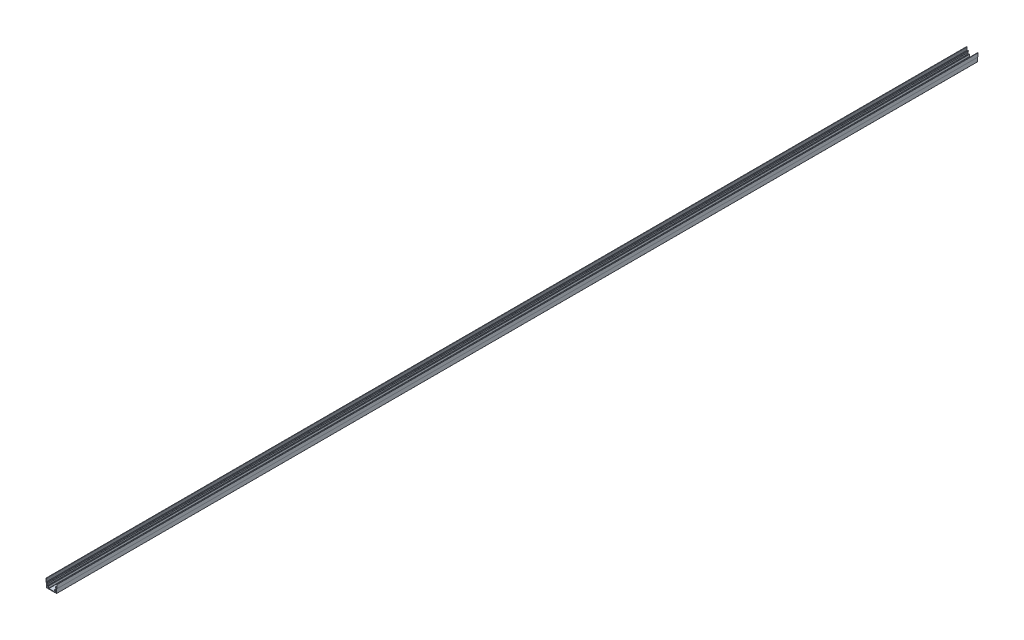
ISO-10303-21;
HEADER;
FILE_DESCRIPTION(('STEP AP214'),'2;1');
FILE_NAME('part.step','',(''),(''),'','','');
FILE_SCHEMA(('AUTOMOTIVE_DESIGN { 1 0 10303 214 1 1 1 1 }'));
ENDSEC;
DATA;
#1=APPLICATION_CONTEXT('core data for automotive mechanical design processes');
#2=APPLICATION_PROTOCOL_DEFINITION('international standard','automotive_design',2000,#1);
#3=PRODUCT_CONTEXT('',#1,'mechanical');
#4=PRODUCT('Part','Part','',(#3));
#5=PRODUCT_RELATED_PRODUCT_CATEGORY('part','',(#4));
#6=PRODUCT_DEFINITION_FORMATION('','',#4);
#7=PRODUCT_DEFINITION_CONTEXT('part definition',#1,'design');
#8=PRODUCT_DEFINITION('design','',#6,#7);
#9=PRODUCT_DEFINITION_SHAPE('','',#8);
#10=(LENGTH_UNIT() NAMED_UNIT(*) SI_UNIT(.MILLI.,.METRE.));
#11=(NAMED_UNIT(*) PLANE_ANGLE_UNIT() SI_UNIT($,.RADIAN.));
#12=(NAMED_UNIT(*) SI_UNIT($,.STERADIAN.) SOLID_ANGLE_UNIT());
#13=UNCERTAINTY_MEASURE_WITH_UNIT(LENGTH_MEASURE(1.E-05),#10,'distance_accuracy_value','');
#14=(GEOMETRIC_REPRESENTATION_CONTEXT(3) GLOBAL_UNCERTAINTY_ASSIGNED_CONTEXT((#13)) GLOBAL_UNIT_ASSIGNED_CONTEXT((#10,
#11,#12)) REPRESENTATION_CONTEXT('',''));
#15=CARTESIAN_POINT('',(0.,0.,0.));
#16=DIRECTION('',(0.,0.,1.));
#17=DIRECTION('',(1.,0.,0.));
#18=AXIS2_PLACEMENT_3D('',#15,#16,#17);
#19=CARTESIAN_POINT('',(-18.,26.302,270.));
#20=DIRECTION('',(1.,0.,0.));
#21=DIRECTION('',(0.,0.,-1.));
#22=AXIS2_PLACEMENT_3D('',#19,#20,#21);
#23=PLANE('',#22);
#24=DIRECTION('',(0.,-1.,0.));
#25=VECTOR('',#24,1.);
#26=CARTESIAN_POINT('',(-18.,26.302,0.));
#27=LINE('',#26,#25);
#28=CARTESIAN_POINT('',(-18.,26.302,0.));
#29=VERTEX_POINT('',#28);
#30=CARTESIAN_POINT('',(-18.,14.6986296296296,0.));
#31=VERTEX_POINT('',#30);
#32=EDGE_CURVE('E688',#29,#31,#27,.T.);
#33=ORIENTED_EDGE('',*,*,#32,.T.);
#34=DIRECTION('',(0.,0.,-1.));
#35=VECTOR('',#34,1.);
#36=CARTESIAN_POINT('',(-18.,14.6986296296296,270.));
#37=LINE('',#36,#35);
#38=CARTESIAN_POINT('',(-18.,14.6986296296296,2970.));
#39=VERTEX_POINT('',#38);
#40=EDGE_CURVE('E9',#39,#31,#37,.T.);
#41=ORIENTED_EDGE('',*,*,#40,.F.);
#42=DIRECTION('',(0.,1.,0.));
#43=VECTOR('',#42,1.);
#44=CARTESIAN_POINT('',(-18.,14.6986296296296,2970.));
#45=LINE('',#44,#43);
#46=CARTESIAN_POINT('',(-18.,26.302,2970.));
#47=VERTEX_POINT('',#46);
#48=EDGE_CURVE('E686',#39,#47,#45,.T.);
#49=ORIENTED_EDGE('',*,*,#48,.T.);
#50=DIRECTION('',(0.,0.,-1.));
#51=VECTOR('',#50,1.);
#52=CARTESIAN_POINT('',(-18.,26.302,270.));
#53=LINE('',#52,#51);
#54=EDGE_CURVE('E1281',#47,#29,#53,.T.);
#55=ORIENTED_EDGE('',*,*,#54,.T.);
#56=EDGE_LOOP('',(#33,#41,#49,#55));
#57=FACE_BOUND('',#56,.T.);
#58=ADVANCED_FACE('F14',(#57),#23,.F.);
#59=CARTESIAN_POINT('',(-18.,14.6986296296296,270.));
#60=DIRECTION('',(-0.287144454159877,0.957887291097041,0.));
#61=DIRECTION('',(-0.957887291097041,-0.287144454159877,0.));
#62=AXIS2_PLACEMENT_3D('',#59,#60,#61);
#63=PLANE('',#62);
#64=DIRECTION('',(0.957887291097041,0.287144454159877,0.));
#65=VECTOR('',#64,1.);
#66=CARTESIAN_POINT('',(-18.,14.6986296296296,0.));
#67=LINE('',#66,#65);
#68=CARTESIAN_POINT('',(-17.008,14.996,0.));
#69=VERTEX_POINT('',#68);
#70=EDGE_CURVE('E1025',#31,#69,#67,.T.);
#71=ORIENTED_EDGE('',*,*,#70,.T.);
#72=DIRECTION('',(0.,0.,-1.));
#73=VECTOR('',#72,1.);
#74=CARTESIAN_POINT('',(-17.008,14.996,270.));
#75=LINE('',#74,#73);
#76=CARTESIAN_POINT('',(-17.008,14.996,2970.));
#77=VERTEX_POINT('',#76);
#78=EDGE_CURVE('E21',#77,#69,#75,.T.);
#79=ORIENTED_EDGE('',*,*,#78,.F.);
#80=DIRECTION('',(-0.957887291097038,-0.287144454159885,0.));
#81=VECTOR('',#80,1.);
#82=CARTESIAN_POINT('',(-17.008,14.996,2970.));
#83=LINE('',#82,#81);
#84=EDGE_CURVE('E696',#77,#39,#83,.T.);
#85=ORIENTED_EDGE('',*,*,#84,.T.);
#86=ORIENTED_EDGE('',*,*,#40,.T.);
#87=EDGE_LOOP('',(#71,#79,#85,#86));
#88=FACE_BOUND('',#87,.T.);
#89=ADVANCED_FACE('F702',(#88),#63,.F.);
#90=CARTESIAN_POINT('',(-17.008,14.996,270.));
#91=DIRECTION('',(0.,1.,0.));
#92=DIRECTION('',(0.,0.,1.));
#93=AXIS2_PLACEMENT_3D('',#90,#91,#92);
#94=PLANE('',#93);
#95=DIRECTION('',(1.,0.,0.));
#96=VECTOR('',#95,1.);
#97=CARTESIAN_POINT('',(-17.008,14.996,0.));
#98=LINE('',#97,#96);
#99=CARTESIAN_POINT('',(-16.,14.996,0.));
#100=VERTEX_POINT('',#99);
#101=EDGE_CURVE('E1027',#69,#100,#98,.T.);
#102=ORIENTED_EDGE('',*,*,#101,.T.);
#103=DIRECTION('',(0.,0.,-1.));
#104=VECTOR('',#103,1.);
#105=CARTESIAN_POINT('',(-16.,14.996,270.));
#106=LINE('',#105,#104);
#107=CARTESIAN_POINT('',(-16.,14.996,2970.));
#108=VERTEX_POINT('',#107);
#109=EDGE_CURVE('E1554',#108,#100,#106,.T.);
#110=ORIENTED_EDGE('',*,*,#109,.F.);
#111=DIRECTION('',(-1.,0.,0.));
#112=VECTOR('',#111,1.);
#113=CARTESIAN_POINT('',(-16.,14.996,2970.));
#114=LINE('',#113,#112);
#115=EDGE_CURVE('E1022',#108,#77,#114,.T.);
#116=ORIENTED_EDGE('',*,*,#115,.T.);
#117=ORIENTED_EDGE('',*,*,#78,.T.);
#118=EDGE_LOOP('',(#102,#110,#116,#117));
#119=FACE_BOUND('',#118,.T.);
#120=ADVANCED_FACE('F1558',(#119),#94,.F.);
#121=CARTESIAN_POINT('',(-16.,14.996,270.));
#122=DIRECTION('',(1.,0.,0.));
#123=DIRECTION('',(0.,0.,-1.));
#124=AXIS2_PLACEMENT_3D('',#121,#122,#123);
#125=PLANE('',#124);
#126=DIRECTION('',(0.,-1.,0.));
#127=VECTOR('',#126,1.);
#128=CARTESIAN_POINT('',(-16.,14.996,0.));
#129=LINE('',#128,#127);
#130=CARTESIAN_POINT('',(-16.,0.0999999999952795,0.));
#131=VERTEX_POINT('',#130);
#132=EDGE_CURVE('E1029',#100,#131,#129,.T.);
#133=ORIENTED_EDGE('',*,*,#132,.T.);
#134=DIRECTION('',(0.,0.,-1.));
#135=VECTOR('',#134,1.);
#136=CARTESIAN_POINT('',(-16.,0.0999999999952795,270.));
#137=LINE('',#136,#135);
#138=CARTESIAN_POINT('',(-16.,0.0999999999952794,2970.));
#139=VERTEX_POINT('',#138);
#140=EDGE_CURVE('E1551',#139,#131,#137,.T.);
#141=ORIENTED_EDGE('',*,*,#140,.F.);
#142=DIRECTION('',(0.,1.,0.));
#143=VECTOR('',#142,1.);
#144=CARTESIAN_POINT('',(-16.,0.0999999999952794,2970.));
#145=LINE('',#144,#143);
#146=EDGE_CURVE('E1019',#139,#108,#145,.T.);
#147=ORIENTED_EDGE('',*,*,#146,.T.);
#148=ORIENTED_EDGE('',*,*,#109,.T.);
#149=EDGE_LOOP('',(#133,#141,#147,#148));
#150=FACE_BOUND('',#149,.T.);
#151=ADVANCED_FACE('F1565',(#150),#125,.F.);
#152=CARTESIAN_POINT('',(-15.702,0.0999999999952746,270.));
#153=DIRECTION('',(0.,0.,-1.));
#154=DIRECTION('',(-1.,0.,0.));
#155=AXIS2_PLACEMENT_3D('',#152,#153,#154);
#156=CYLINDRICAL_SURFACE('',#155,0.298);
#157=CARTESIAN_POINT('',(-15.702,0.0999999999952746,0.));
#158=DIRECTION('',(0.,0.,1.));
#159=DIRECTION('',(1.,0.,0.));
#160=AXIS2_PLACEMENT_3D('',#157,#158,#159);
#161=CIRCLE('',#160,0.298);
#162=CARTESIAN_POINT('',(-15.7020016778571,-0.198,0.));
#163=VERTEX_POINT('',#162);
#164=EDGE_CURVE('E1031',#131,#163,#161,.T.);
#165=ORIENTED_EDGE('',*,*,#164,.T.);
#166=DIRECTION('',(0.,0.,-1.));
#167=VECTOR('',#166,1.);
#168=CARTESIAN_POINT('',(-15.7020016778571,-0.198,270.));
#169=LINE('',#168,#167);
#170=CARTESIAN_POINT('',(-15.7020016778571,-0.198,2970.));
#171=VERTEX_POINT('',#170);
#172=EDGE_CURVE('E1548',#171,#163,#169,.T.);
#173=ORIENTED_EDGE('',*,*,#172,.F.);
#174=CARTESIAN_POINT('',(-15.702,0.0999999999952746,2970.));
#175=DIRECTION('',(0.,0.,-1.));
#176=DIRECTION('',(-1.,0.,0.));
#177=AXIS2_PLACEMENT_3D('',#174,#175,#176);
#178=CIRCLE('',#177,0.298);
#179=EDGE_CURVE('E1016',#171,#139,#178,.T.);
#180=ORIENTED_EDGE('',*,*,#179,.T.);
#181=ORIENTED_EDGE('',*,*,#140,.T.);
#182=EDGE_LOOP('',(#165,#173,#180,#181));
#183=FACE_BOUND('',#182,.T.);
#184=ADVANCED_FACE('F1568',(#183),#156,.T.);
#185=CARTESIAN_POINT('',(-15.7020016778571,-0.198,270.));
#186=DIRECTION('',(0.,1.,0.));
#187=DIRECTION('',(0.,0.,1.));
#188=AXIS2_PLACEMENT_3D('',#185,#186,#187);
#189=PLANE('',#188);
#190=DIRECTION('',(1.,0.,0.));
#191=VECTOR('',#190,1.);
#192=CARTESIAN_POINT('',(-15.7020016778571,-0.198,0.));
#193=LINE('',#192,#191);
#194=CARTESIAN_POINT('',(-14.2773032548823,-0.198,0.));
#195=VERTEX_POINT('',#194);
#196=EDGE_CURVE('E1033',#163,#195,#193,.T.);
#197=ORIENTED_EDGE('',*,*,#196,.T.);
#198=DIRECTION('',(0.,0.,-1.));
#199=VECTOR('',#198,1.);
#200=CARTESIAN_POINT('',(-14.2773032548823,-0.198,270.));
#201=LINE('',#200,#199);
#202=CARTESIAN_POINT('',(-14.2773032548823,-0.197999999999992,2970.));
#203=VERTEX_POINT('',#202);
#204=EDGE_CURVE('E1545',#203,#195,#201,.T.);
#205=ORIENTED_EDGE('',*,*,#204,.F.);
#206=DIRECTION('',(-1.,0.,0.));
#207=VECTOR('',#206,1.);
#208=CARTESIAN_POINT('',(-14.2773032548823,-0.197999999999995,2970.));
#209=LINE('',#208,#207);
#210=EDGE_CURVE('E1013',#203,#171,#209,.T.);
#211=ORIENTED_EDGE('',*,*,#210,.T.);
#212=ORIENTED_EDGE('',*,*,#172,.T.);
#213=EDGE_LOOP('',(#197,#205,#211,#212));
#214=FACE_BOUND('',#213,.T.);
#215=ADVANCED_FACE('F1573',(#214),#189,.F.);
#216=CARTESIAN_POINT('',(-14.2773038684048,0.0999999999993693,270.));
#217=DIRECTION('',(0.,0.,-1.));
#218=DIRECTION('',(-1.,0.,0.));
#219=AXIS2_PLACEMENT_3D('',#216,#217,#218);
#220=CYLINDRICAL_SURFACE('',#219,0.298);
#221=CARTESIAN_POINT('',(-14.2773038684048,0.0999999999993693,0.));
#222=DIRECTION('',(0.,0.,1.));
#223=DIRECTION('',(1.,0.,0.));
#224=AXIS2_PLACEMENT_3D('',#221,#222,#223);
#225=CIRCLE('',#224,0.298);
#226=CARTESIAN_POINT('',(-13.9819190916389,0.0606066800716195,0.));
#227=VERTEX_POINT('',#226);
#228=EDGE_CURVE('E1035',#195,#227,#225,.T.);
#229=ORIENTED_EDGE('',*,*,#228,.T.);
#230=DIRECTION('',(0.,0.,-1.));
#231=VECTOR('',#230,1.);
#232=CARTESIAN_POINT('',(-13.9819190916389,0.0606066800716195,270.));
#233=LINE('',#232,#231);
#234=CARTESIAN_POINT('',(-13.9819190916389,0.0606066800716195,2970.));
#235=VERTEX_POINT('',#234);
#236=EDGE_CURVE('E1542',#235,#227,#233,.T.);
#237=ORIENTED_EDGE('',*,*,#236,.F.);
#238=CARTESIAN_POINT('',(-14.2773038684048,0.0999999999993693,2970.));
#239=DIRECTION('',(0.,0.,-1.));
#240=DIRECTION('',(-1.,0.,0.));
#241=AXIS2_PLACEMENT_3D('',#238,#239,#240);
#242=CIRCLE('',#241,0.297999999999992);
#243=EDGE_CURVE('E1010',#235,#203,#242,.T.);
#244=ORIENTED_EDGE('',*,*,#243,.T.);
#245=ORIENTED_EDGE('',*,*,#204,.T.);
#246=EDGE_LOOP('',(#229,#237,#244,#245));
#247=FACE_BOUND('',#246,.T.);
#248=ADVANCED_FACE('F1576',(#247),#220,.T.);
#249=CARTESIAN_POINT('',(-13.9819190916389,0.0606066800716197,270.));
#250=DIRECTION('',(-0.991224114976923,0.132192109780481,0.));
#251=DIRECTION('',(-0.132192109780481,-0.991224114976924,0.));
#252=AXIS2_PLACEMENT_3D('',#249,#250,#251);
#253=PLANE('',#252);
#254=DIRECTION('',(0.132192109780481,0.991224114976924,0.));
#255=VECTOR('',#254,1.);
#256=CARTESIAN_POINT('',(-13.9819190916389,0.0606066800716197,0.));
#257=LINE('',#256,#255);
#258=CARTESIAN_POINT('',(-13.6770576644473,2.34656761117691,0.));
#259=VERTEX_POINT('',#258);
#260=EDGE_CURVE('E1037',#227,#259,#257,.T.);
#261=ORIENTED_EDGE('',*,*,#260,.T.);
#262=DIRECTION('',(0.,0.,-1.));
#263=VECTOR('',#262,1.);
#264=CARTESIAN_POINT('',(-13.6770576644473,2.34656761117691,270.));
#265=LINE('',#264,#263);
#266=CARTESIAN_POINT('',(-13.6770576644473,2.34656761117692,2970.));
#267=VERTEX_POINT('',#266);
#268=EDGE_CURVE('E1540',#267,#259,#265,.T.);
#269=ORIENTED_EDGE('',*,*,#268,.F.);
#270=DIRECTION('',(-0.132192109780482,-0.991224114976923,0.));
#271=VECTOR('',#270,1.);
#272=CARTESIAN_POINT('',(-13.6770576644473,2.34656761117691,2970.));
#273=LINE('',#272,#271);
#274=EDGE_CURVE('E1007',#267,#235,#273,.T.);
#275=ORIENTED_EDGE('',*,*,#274,.T.);
#276=ORIENTED_EDGE('',*,*,#236,.T.);
#277=EDGE_LOOP('',(#261,#269,#275,#276));
#278=FACE_BOUND('',#277,.T.);
#279=ADVANCED_FACE('F1581',(#278),#253,.F.);
#280=CARTESIAN_POINT('',(-13.1854105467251,2.281,270.));
#281=DIRECTION('',(0.,0.,-1.));
#282=DIRECTION('',(-1.,0.,0.));
#283=AXIS2_PLACEMENT_3D('',#280,#281,#282);
#284=CYLINDRICAL_SURFACE('',#283,0.496);
#285=CARTESIAN_POINT('',(-13.1854105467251,2.281,0.));
#286=DIRECTION('',(0.,0.,1.));
#287=DIRECTION('',(1.,0.,0.));
#288=AXIS2_PLACEMENT_3D('',#285,#286,#287);
#289=CIRCLE('',#288,0.496);
#290=CARTESIAN_POINT('',(-13.1854106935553,2.777,0.));
#291=VERTEX_POINT('',#290);
#292=EDGE_CURVE('E1040',#291,#259,#289,.T.);
#293=ORIENTED_EDGE('',*,*,#292,.F.);
#294=DIRECTION('',(0.,0.,-1.));
#295=VECTOR('',#294,1.);
#296=CARTESIAN_POINT('',(-13.1854106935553,2.777,270.));
#297=LINE('',#296,#295);
#298=CARTESIAN_POINT('',(-13.1854106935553,2.777,2970.));
#299=VERTEX_POINT('',#298);
#300=EDGE_CURVE('E1538',#299,#291,#297,.T.);
#301=ORIENTED_EDGE('',*,*,#300,.F.);
#302=CARTESIAN_POINT('',(-13.1854105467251,2.281,2970.));
#303=DIRECTION('',(0.,0.,1.));
#304=DIRECTION('',(-1.,0.,0.));
#305=AXIS2_PLACEMENT_3D('',#302,#303,#304);
#306=CIRCLE('',#305,0.496000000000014);
#307=EDGE_CURVE('E1004',#299,#267,#306,.T.);
#308=ORIENTED_EDGE('',*,*,#307,.T.);
#309=ORIENTED_EDGE('',*,*,#268,.T.);
#310=EDGE_LOOP('',(#293,#301,#308,#309));
#311=FACE_BOUND('',#310,.T.);
#312=ADVANCED_FACE('F1586',(#311),#284,.F.);
#313=CARTESIAN_POINT('',(-13.1854106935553,2.777,270.));
#314=DIRECTION('',(0.,1.,0.));
#315=DIRECTION('',(0.,0.,1.));
#316=AXIS2_PLACEMENT_3D('',#313,#314,#315);
#317=PLANE('',#316);
#318=DIRECTION('',(1.,0.,0.));
#319=VECTOR('',#318,1.);
#320=CARTESIAN_POINT('',(-13.1854106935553,2.777,0.));
#321=LINE('',#320,#319);
#322=CARTESIAN_POINT('',(-12.0205892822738,2.777,0.));
#323=VERTEX_POINT('',#322);
#324=EDGE_CURVE('E1043',#291,#323,#321,.T.);
#325=ORIENTED_EDGE('',*,*,#324,.T.);
#326=DIRECTION('',(0.,0.,-1.));
#327=VECTOR('',#326,1.);
#328=CARTESIAN_POINT('',(-12.0205892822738,2.777,270.));
#329=LINE('',#328,#327);
#330=CARTESIAN_POINT('',(-12.0205892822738,2.777,2970.));
#331=VERTEX_POINT('',#330);
#332=EDGE_CURVE('E1536',#331,#323,#329,.T.);
#333=ORIENTED_EDGE('',*,*,#332,.F.);
#334=DIRECTION('',(-1.,0.,0.));
#335=VECTOR('',#334,1.);
#336=CARTESIAN_POINT('',(-12.0205892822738,2.777,2970.));
#337=LINE('',#336,#335);
#338=EDGE_CURVE('E1001',#331,#299,#337,.T.);
#339=ORIENTED_EDGE('',*,*,#338,.T.);
#340=ORIENTED_EDGE('',*,*,#300,.T.);
#341=EDGE_LOOP('',(#325,#333,#339,#340));
#342=FACE_BOUND('',#341,.T.);
#343=ADVANCED_FACE('F1588',(#342),#317,.F.);
#344=CARTESIAN_POINT('',(-12.0205895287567,2.28100000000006,270.));
#345=DIRECTION('',(0.,0.,-1.));
#346=DIRECTION('',(-1.,0.,0.));
#347=AXIS2_PLACEMENT_3D('',#344,#345,#346);
#348=CYLINDRICAL_SURFACE('',#347,0.496);
#349=CARTESIAN_POINT('',(-12.0205895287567,2.28100000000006,0.));
#350=DIRECTION('',(0.,0.,1.));
#351=DIRECTION('',(1.,0.,0.));
#352=AXIS2_PLACEMENT_3D('',#349,#350,#351);
#353=CIRCLE('',#352,0.496);
#354=CARTESIAN_POINT('',(-11.5289320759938,2.34649006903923,0.));
#355=VERTEX_POINT('',#354);
#356=EDGE_CURVE('E1046',#355,#323,#353,.T.);
#357=ORIENTED_EDGE('',*,*,#356,.F.);
#358=DIRECTION('',(0.,0.,-1.));
#359=VECTOR('',#358,1.);
#360=CARTESIAN_POINT('',(-11.5289320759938,2.34649006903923,270.));
#361=LINE('',#360,#359);
#362=CARTESIAN_POINT('',(-11.5289320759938,2.34649006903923,2970.));
#363=VERTEX_POINT('',#362);
#364=EDGE_CURVE('E1534',#363,#355,#361,.T.);
#365=ORIENTED_EDGE('',*,*,#364,.F.);
#366=CARTESIAN_POINT('',(-12.0205895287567,2.28100000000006,2970.));
#367=DIRECTION('',(0.,0.,1.));
#368=DIRECTION('',(-1.,0.,0.));
#369=AXIS2_PLACEMENT_3D('',#366,#367,#368);
#370=CIRCLE('',#369,0.496);
#371=EDGE_CURVE('E998',#363,#331,#370,.T.);
#372=ORIENTED_EDGE('',*,*,#371,.T.);
#373=ORIENTED_EDGE('',*,*,#332,.T.);
#374=EDGE_LOOP('',(#357,#365,#372,#373));
#375=FACE_BOUND('',#374,.T.);
#376=ADVANCED_FACE('F1593',(#375),#348,.F.);
#377=CARTESIAN_POINT('',(-11.5289320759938,2.34649006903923,270.));
#378=DIRECTION('',(0.991244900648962,0.132036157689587,0.));
#379=DIRECTION('',(-0.132036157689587,0.991244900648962,0.));
#380=AXIS2_PLACEMENT_3D('',#377,#378,#379);
#381=PLANE('',#380);
#382=DIRECTION('',(0.132036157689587,-0.991244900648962,0.));
#383=VECTOR('',#382,1.);
#384=CARTESIAN_POINT('',(-11.5289320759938,2.34649006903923,0.));
#385=LINE('',#384,#383);
#386=CARTESIAN_POINT('',(-11.19,-0.198,0.));
#387=VERTEX_POINT('',#386);
#388=EDGE_CURVE('E1049',#355,#387,#385,.T.);
#389=ORIENTED_EDGE('',*,*,#388,.T.);
#390=DIRECTION('',(0.,0.,-1.));
#391=VECTOR('',#390,1.);
#392=CARTESIAN_POINT('',(-11.19,-0.198,270.));
#393=LINE('',#392,#391);
#394=CARTESIAN_POINT('',(-11.19,-0.198,2970.));
#395=VERTEX_POINT('',#394);
#396=EDGE_CURVE('E1531',#395,#387,#393,.T.);
#397=ORIENTED_EDGE('',*,*,#396,.F.);
#398=DIRECTION('',(-0.13203615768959,0.991244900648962,0.));
#399=VECTOR('',#398,1.);
#400=CARTESIAN_POINT('',(-11.19,-0.198,2970.));
#401=LINE('',#400,#399);
#402=EDGE_CURVE('E995',#395,#363,#401,.T.);
#403=ORIENTED_EDGE('',*,*,#402,.T.);
#404=ORIENTED_EDGE('',*,*,#364,.T.);
#405=EDGE_LOOP('',(#389,#397,#403,#404));
#406=FACE_BOUND('',#405,.T.);
#407=ADVANCED_FACE('F1598',(#406),#381,.F.);
#408=CARTESIAN_POINT('',(-11.19,-0.198,270.));
#409=DIRECTION('',(0.,1.,0.));
#410=DIRECTION('',(-1.,0.,0.));
#411=AXIS2_PLACEMENT_3D('',#408,#409,#410);
#412=PLANE('',#411);
#413=DIRECTION('',(1.,0.,0.));
#414=VECTOR('',#413,1.);
#415=CARTESIAN_POINT('',(-11.19,-0.198,0.));
#416=LINE('',#415,#414);
#417=CARTESIAN_POINT('',(-7.663,-0.198,0.));
#418=VERTEX_POINT('',#417);
#419=EDGE_CURVE('E1051',#387,#418,#416,.T.);
#420=ORIENTED_EDGE('',*,*,#419,.T.);
#421=DIRECTION('',(0.,0.,-1.));
#422=VECTOR('',#421,1.);
#423=CARTESIAN_POINT('',(-7.663,-0.198,270.));
#424=LINE('',#423,#422);
#425=CARTESIAN_POINT('',(-7.663,-0.198,2970.));
#426=VERTEX_POINT('',#425);
#427=EDGE_CURVE('E1529',#426,#418,#424,.T.);
#428=ORIENTED_EDGE('',*,*,#427,.F.);
#429=DIRECTION('',(-1.,0.,0.));
#430=VECTOR('',#429,1.);
#431=CARTESIAN_POINT('',(-7.663,-0.198,2970.));
#432=LINE('',#431,#430);
#433=EDGE_CURVE('E992',#426,#395,#432,.T.);
#434=ORIENTED_EDGE('',*,*,#433,.T.);
#435=ORIENTED_EDGE('',*,*,#396,.T.);
#436=EDGE_LOOP('',(#420,#428,#434,#435));
#437=FACE_BOUND('',#436,.T.);
#438=ADVANCED_FACE('F1600',(#437),#412,.F.);
#439=CARTESIAN_POINT('',(-7.14898437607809,-0.752368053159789,270.));
#440=DIRECTION('',(0.,0.,-1.));
#441=DIRECTION('',(-1.,0.,0.));
#442=AXIS2_PLACEMENT_3D('',#439,#440,#441);
#443=CYLINDRICAL_SURFACE('',#442,0.756);
#444=CARTESIAN_POINT('',(-7.14898437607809,-0.752368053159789,0.));
#445=DIRECTION('',(0.,0.,1.));
#446=DIRECTION('',(1.,0.,0.));
#447=AXIS2_PLACEMENT_3D('',#444,#445,#446);
#448=CIRCLE('',#447,0.756);
#449=CARTESIAN_POINT('',(-7.223,0.,0.));
#450=VERTEX_POINT('',#449);
#451=EDGE_CURVE('E1054',#450,#418,#448,.T.);
#452=ORIENTED_EDGE('',*,*,#451,.F.);
#453=DIRECTION('',(0.,0.,-1.));
#454=VECTOR('',#453,1.);
#455=CARTESIAN_POINT('',(-7.223,0.,270.));
#456=LINE('',#455,#454);
#457=CARTESIAN_POINT('',(-7.223,0.,2970.));
#458=VERTEX_POINT('',#457);
#459=EDGE_CURVE('E1527',#458,#450,#456,.T.);
#460=ORIENTED_EDGE('',*,*,#459,.F.);
#461=CARTESIAN_POINT('',(-7.14898437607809,-0.752368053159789,2970.));
#462=DIRECTION('',(0.,0.,1.));
#463=DIRECTION('',(-1.,0.,0.));
#464=AXIS2_PLACEMENT_3D('',#461,#462,#463);
#465=CIRCLE('',#464,0.756);
#466=EDGE_CURVE('E989',#458,#426,#465,.T.);
#467=ORIENTED_EDGE('',*,*,#466,.T.);
#468=ORIENTED_EDGE('',*,*,#427,.T.);
#469=EDGE_LOOP('',(#452,#460,#467,#468));
#470=FACE_BOUND('',#469,.T.);
#471=ADVANCED_FACE('F1604',(#470),#443,.F.);
#472=CARTESIAN_POINT('',(-7.223,0.,270.));
#473=DIRECTION('',(0.,1.,0.));
#474=DIRECTION('',(0.,0.,1.));
#475=AXIS2_PLACEMENT_3D('',#472,#473,#474);
#476=PLANE('',#475);
#477=DIRECTION('',(1.,0.,0.));
#478=VECTOR('',#477,1.);
#479=CARTESIAN_POINT('',(-7.223,0.,0.));
#480=LINE('',#479,#478);
#481=CARTESIAN_POINT('',(7.223,0.,0.));
#482=VERTEX_POINT('',#481);
#483=EDGE_CURVE('E1057',#450,#482,#480,.T.);
#484=ORIENTED_EDGE('',*,*,#483,.T.);
#485=DIRECTION('',(0.,0.,-1.));
#486=VECTOR('',#485,1.);
#487=CARTESIAN_POINT('',(7.223,0.,270.));
#488=LINE('',#487,#486);
#489=CARTESIAN_POINT('',(7.223,0.,2970.));
#490=VERTEX_POINT('',#489);
#491=EDGE_CURVE('E1525',#490,#482,#488,.T.);
#492=ORIENTED_EDGE('',*,*,#491,.F.);
#493=DIRECTION('',(-1.,0.,0.));
#494=VECTOR('',#493,1.);
#495=CARTESIAN_POINT('',(7.223,0.,2970.));
#496=LINE('',#495,#494);
#497=EDGE_CURVE('E986',#490,#458,#496,.T.);
#498=ORIENTED_EDGE('',*,*,#497,.T.);
#499=ORIENTED_EDGE('',*,*,#459,.T.);
#500=EDGE_LOOP('',(#484,#492,#498,#499));
#501=FACE_BOUND('',#500,.T.);
#502=ADVANCED_FACE('F1609',(#501),#476,.F.);
#503=CARTESIAN_POINT('',(7.14898437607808,-0.752368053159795,270.));
#504=DIRECTION('',(0.,0.,-1.));
#505=DIRECTION('',(-1.,0.,0.));
#506=AXIS2_PLACEMENT_3D('',#503,#504,#505);
#507=CYLINDRICAL_SURFACE('',#506,0.756);
#508=CARTESIAN_POINT('',(7.14898437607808,-0.752368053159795,0.));
#509=DIRECTION('',(0.,0.,1.));
#510=DIRECTION('',(1.,0.,0.));
#511=AXIS2_PLACEMENT_3D('',#508,#509,#510);
#512=CIRCLE('',#511,0.756);
#513=CARTESIAN_POINT('',(7.663,-0.198,0.));
#514=VERTEX_POINT('',#513);
#515=EDGE_CURVE('E1060',#514,#482,#512,.T.);
#516=ORIENTED_EDGE('',*,*,#515,.F.);
#517=DIRECTION('',(0.,0.,-1.));
#518=VECTOR('',#517,1.);
#519=CARTESIAN_POINT('',(7.663,-0.198,270.));
#520=LINE('',#519,#518);
#521=CARTESIAN_POINT('',(7.663,-0.198,2970.));
#522=VERTEX_POINT('',#521);
#523=EDGE_CURVE('E1523',#522,#514,#520,.T.);
#524=ORIENTED_EDGE('',*,*,#523,.F.);
#525=CARTESIAN_POINT('',(7.14898437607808,-0.752368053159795,2970.));
#526=DIRECTION('',(0.,0.,1.));
#527=DIRECTION('',(-1.,0.,0.));
#528=AXIS2_PLACEMENT_3D('',#525,#526,#527);
#529=CIRCLE('',#528,0.756000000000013);
#530=EDGE_CURVE('E983',#522,#490,#529,.T.);
#531=ORIENTED_EDGE('',*,*,#530,.T.);
#532=ORIENTED_EDGE('',*,*,#491,.T.);
#533=EDGE_LOOP('',(#516,#524,#531,#532));
#534=FACE_BOUND('',#533,.T.);
#535=ADVANCED_FACE('F1612',(#534),#507,.F.);
#536=CARTESIAN_POINT('',(7.663,-0.198,270.));
#537=DIRECTION('',(0.,1.,0.));
#538=DIRECTION('',(-1.,0.,0.));
#539=AXIS2_PLACEMENT_3D('',#536,#537,#538);
#540=PLANE('',#539);
#541=DIRECTION('',(1.,0.,0.));
#542=VECTOR('',#541,1.);
#543=CARTESIAN_POINT('',(7.663,-0.198,0.));
#544=LINE('',#543,#542);
#545=CARTESIAN_POINT('',(10.93,-0.198,0.));
#546=VERTEX_POINT('',#545);
#547=EDGE_CURVE('E1063',#514,#546,#544,.T.);
#548=ORIENTED_EDGE('',*,*,#547,.T.);
#549=DIRECTION('',(0.,0.,-1.));
#550=VECTOR('',#549,1.);
#551=CARTESIAN_POINT('',(10.93,-0.198,270.));
#552=LINE('',#551,#550);
#553=CARTESIAN_POINT('',(10.93,-0.197999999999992,2970.));
#554=VERTEX_POINT('',#553);
#555=EDGE_CURVE('E1520',#554,#546,#552,.T.);
#556=ORIENTED_EDGE('',*,*,#555,.F.);
#557=DIRECTION('',(-1.,0.,0.));
#558=VECTOR('',#557,1.);
#559=CARTESIAN_POINT('',(10.93,-0.197999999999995,2970.));
#560=LINE('',#559,#558);
#561=EDGE_CURVE('E980',#554,#522,#560,.T.);
#562=ORIENTED_EDGE('',*,*,#561,.T.);
#563=ORIENTED_EDGE('',*,*,#523,.T.);
#564=EDGE_LOOP('',(#548,#556,#562,#563));
#565=FACE_BOUND('',#564,.T.);
#566=ADVANCED_FACE('F1616',(#565),#540,.F.);
#567=CARTESIAN_POINT('',(10.9286957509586,0.0999971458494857,270.));
#568=DIRECTION('',(0.,0.,-1.));
#569=DIRECTION('',(-1.,0.,0.));
#570=AXIS2_PLACEMENT_3D('',#567,#568,#569);
#571=CYLINDRICAL_SURFACE('',#570,0.298);
#572=CARTESIAN_POINT('',(10.9286957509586,0.0999971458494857,0.));
#573=DIRECTION('',(0.,0.,1.));
#574=DIRECTION('',(1.,0.,0.));
#575=AXIS2_PLACEMENT_3D('',#572,#573,#574);
#576=CIRCLE('',#575,0.298);
#577=CARTESIAN_POINT('',(11.2240805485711,0.0606039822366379,0.));
#578=VERTEX_POINT('',#577);
#579=EDGE_CURVE('E1065',#546,#578,#576,.T.);
#580=ORIENTED_EDGE('',*,*,#579,.T.);
#581=DIRECTION('',(0.,0.,-1.));
#582=VECTOR('',#581,1.);
#583=CARTESIAN_POINT('',(11.2240805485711,0.0606039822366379,270.));
#584=LINE('',#583,#582);
#585=CARTESIAN_POINT('',(11.2240805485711,0.0606039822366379,2970.));
#586=VERTEX_POINT('',#585);
#587=EDGE_CURVE('E1517',#586,#578,#584,.T.);
#588=ORIENTED_EDGE('',*,*,#587,.F.);
#589=CARTESIAN_POINT('',(10.9286957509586,0.0999971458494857,2970.));
#590=DIRECTION('',(0.,0.,-1.));
#591=DIRECTION('',(-1.,0.,0.));
#592=AXIS2_PLACEMENT_3D('',#589,#590,#591);
#593=CIRCLE('',#592,0.297999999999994);
#594=EDGE_CURVE('E977',#586,#554,#593,.T.);
#595=ORIENTED_EDGE('',*,*,#594,.T.);
#596=ORIENTED_EDGE('',*,*,#555,.T.);
#597=EDGE_LOOP('',(#580,#588,#595,#596));
#598=FACE_BOUND('',#597,.T.);
#599=ADVANCED_FACE('F1620',(#598),#571,.T.);
#600=CARTESIAN_POINT('',(11.2240805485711,0.0606039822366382,270.));
#601=DIRECTION('',(-0.991224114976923,0.132192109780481,0.));
#602=DIRECTION('',(-0.132192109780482,-0.991224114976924,0.));
#603=AXIS2_PLACEMENT_3D('',#600,#601,#602);
#604=PLANE('',#603);
#605=DIRECTION('',(0.132192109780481,0.991224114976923,0.));
#606=VECTOR('',#605,1.);
#607=CARTESIAN_POINT('',(11.2240805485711,0.0606039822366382,0.));
#608=LINE('',#607,#606);
#609=CARTESIAN_POINT('',(11.5289423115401,2.3465674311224,0.));
#610=VERTEX_POINT('',#609);
#611=EDGE_CURVE('E1067',#578,#610,#608,.T.);
#612=ORIENTED_EDGE('',*,*,#611,.T.);
#613=DIRECTION('',(0.,0.,-1.));
#614=VECTOR('',#613,1.);
#615=CARTESIAN_POINT('',(11.5289423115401,2.3465674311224,270.));
#616=LINE('',#615,#614);
#617=CARTESIAN_POINT('',(11.5289423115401,2.3465674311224,2970.));
#618=VERTEX_POINT('',#617);
#619=EDGE_CURVE('E1515',#618,#610,#616,.T.);
#620=ORIENTED_EDGE('',*,*,#619,.F.);
#621=DIRECTION('',(-0.132192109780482,-0.991224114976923,0.));
#622=VECTOR('',#621,1.);
#623=CARTESIAN_POINT('',(11.5289423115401,2.3465674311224,2970.));
#624=LINE('',#623,#622);
#625=EDGE_CURVE('E974',#618,#586,#624,.T.);
#626=ORIENTED_EDGE('',*,*,#625,.T.);
#627=ORIENTED_EDGE('',*,*,#587,.T.);
#628=EDGE_LOOP('',(#612,#620,#626,#627));
#629=FACE_BOUND('',#628,.T.);
#630=ADVANCED_FACE('F1625',(#629),#604,.F.);
#631=CARTESIAN_POINT('',(12.020589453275,2.28100000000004,270.));
#632=DIRECTION('',(0.,0.,-1.));
#633=DIRECTION('',(-1.,0.,0.));
#634=AXIS2_PLACEMENT_3D('',#631,#632,#633);
#635=CYLINDRICAL_SURFACE('',#634,0.496);
#636=CARTESIAN_POINT('',(12.020589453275,2.28100000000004,0.));
#637=DIRECTION('',(0.,0.,1.));
#638=DIRECTION('',(1.,0.,0.));
#639=AXIS2_PLACEMENT_3D('',#636,#637,#638);
#640=CIRCLE('',#639,0.496);
#641=CARTESIAN_POINT('',(12.0205892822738,2.777,0.));
#642=VERTEX_POINT('',#641);
#643=EDGE_CURVE('E1070',#642,#610,#640,.T.);
#644=ORIENTED_EDGE('',*,*,#643,.F.);
#645=DIRECTION('',(0.,0.,-1.));
#646=VECTOR('',#645,1.);
#647=CARTESIAN_POINT('',(12.0205892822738,2.777,270.));
#648=LINE('',#647,#646);
#649=CARTESIAN_POINT('',(12.0205892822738,2.777,2970.));
#650=VERTEX_POINT('',#649);
#651=EDGE_CURVE('E1513',#650,#642,#648,.T.);
#652=ORIENTED_EDGE('',*,*,#651,.F.);
#653=CARTESIAN_POINT('',(12.020589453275,2.28100000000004,2970.));
#654=DIRECTION('',(0.,0.,1.));
#655=DIRECTION('',(-1.,0.,0.));
#656=AXIS2_PLACEMENT_3D('',#653,#654,#655);
#657=CIRCLE('',#656,0.496);
#658=EDGE_CURVE('E971',#650,#618,#657,.T.);
#659=ORIENTED_EDGE('',*,*,#658,.T.);
#660=ORIENTED_EDGE('',*,*,#619,.T.);
#661=EDGE_LOOP('',(#644,#652,#659,#660));
#662=FACE_BOUND('',#661,.T.);
#663=ADVANCED_FACE('F1630',(#662),#635,.F.);
#664=CARTESIAN_POINT('',(12.0205892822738,2.777,270.));
#665=DIRECTION('',(0.,1.,0.));
#666=DIRECTION('',(0.,0.,1.));
#667=AXIS2_PLACEMENT_3D('',#664,#665,#666);
#668=PLANE('',#667);
#669=DIRECTION('',(1.,0.,0.));
#670=VECTOR('',#669,1.);
#671=CARTESIAN_POINT('',(12.0205892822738,2.777,0.));
#672=LINE('',#671,#670);
#673=CARTESIAN_POINT('',(13.1854106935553,2.777,0.));
#674=VERTEX_POINT('',#673);
#675=EDGE_CURVE('E1073',#642,#674,#672,.T.);
#676=ORIENTED_EDGE('',*,*,#675,.T.);
#677=DIRECTION('',(0.,0.,-1.));
#678=VECTOR('',#677,1.);
#679=CARTESIAN_POINT('',(13.1854106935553,2.777,270.));
#680=LINE('',#679,#678);
#681=CARTESIAN_POINT('',(13.1854106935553,2.777,2970.));
#682=VERTEX_POINT('',#681);
#683=EDGE_CURVE('E1511',#682,#674,#680,.T.);
#684=ORIENTED_EDGE('',*,*,#683,.F.);
#685=DIRECTION('',(-1.,0.,0.));
#686=VECTOR('',#685,1.);
#687=CARTESIAN_POINT('',(13.1854106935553,2.777,2970.));
#688=LINE('',#687,#686);
#689=EDGE_CURVE('E968',#682,#650,#688,.T.);
#690=ORIENTED_EDGE('',*,*,#689,.T.);
#691=ORIENTED_EDGE('',*,*,#651,.T.);
#692=EDGE_LOOP('',(#676,#684,#690,#691));
#693=FACE_BOUND('',#692,.T.);
#694=ADVANCED_FACE('F1632',(#693),#668,.F.);
#695=CARTESIAN_POINT('',(13.1854105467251,2.281,270.));
#696=DIRECTION('',(0.,0.,-1.));
#697=DIRECTION('',(-1.,0.,0.));
#698=AXIS2_PLACEMENT_3D('',#695,#696,#697);
#699=CYLINDRICAL_SURFACE('',#698,0.496);
#700=CARTESIAN_POINT('',(13.1854105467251,2.281,0.));
#701=DIRECTION('',(0.,0.,1.));
#702=DIRECTION('',(1.,0.,0.));
#703=AXIS2_PLACEMENT_3D('',#700,#701,#702);
#704=CIRCLE('',#703,0.496);
#705=CARTESIAN_POINT('',(13.6770576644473,2.34656761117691,0.));
#706=VERTEX_POINT('',#705);
#707=EDGE_CURVE('E1076',#706,#674,#704,.T.);
#708=ORIENTED_EDGE('',*,*,#707,.F.);
#709=DIRECTION('',(0.,0.,-1.));
#710=VECTOR('',#709,1.);
#711=CARTESIAN_POINT('',(13.6770576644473,2.34656761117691,270.));
#712=LINE('',#711,#710);
#713=CARTESIAN_POINT('',(13.6770576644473,2.34656761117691,2970.));
#714=VERTEX_POINT('',#713);
#715=EDGE_CURVE('E1509',#714,#706,#712,.T.);
#716=ORIENTED_EDGE('',*,*,#715,.F.);
#717=CARTESIAN_POINT('',(13.1854105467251,2.281,2970.));
#718=DIRECTION('',(0.,0.,1.));
#719=DIRECTION('',(-1.,0.,0.));
#720=AXIS2_PLACEMENT_3D('',#717,#718,#719);
#721=CIRCLE('',#720,0.496);
#722=EDGE_CURVE('E965',#714,#682,#721,.T.);
#723=ORIENTED_EDGE('',*,*,#722,.T.);
#724=ORIENTED_EDGE('',*,*,#683,.T.);
#725=EDGE_LOOP('',(#708,#716,#723,#724));
#726=FACE_BOUND('',#725,.T.);
#727=ADVANCED_FACE('F1637',(#726),#699,.F.);
#728=CARTESIAN_POINT('',(13.6770576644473,2.34656761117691,270.));
#729=DIRECTION('',(0.991224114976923,0.132192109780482,0.));
#730=DIRECTION('',(-0.132192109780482,0.991224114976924,0.));
#731=AXIS2_PLACEMENT_3D('',#728,#729,#730);
#732=PLANE('',#731);
#733=DIRECTION('',(0.132192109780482,-0.991224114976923,0.));
#734=VECTOR('',#733,1.);
#735=CARTESIAN_POINT('',(13.6770576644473,2.34656761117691,0.));
#736=LINE('',#735,#734);
#737=CARTESIAN_POINT('',(13.9819190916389,0.0606066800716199,0.));
#738=VERTEX_POINT('',#737);
#739=EDGE_CURVE('E1079',#706,#738,#736,.T.);
#740=ORIENTED_EDGE('',*,*,#739,.T.);
#741=DIRECTION('',(0.,0.,-1.));
#742=VECTOR('',#741,1.);
#743=CARTESIAN_POINT('',(13.9819190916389,0.0606066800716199,270.));
#744=LINE('',#743,#742);
#745=CARTESIAN_POINT('',(13.9819190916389,0.0606066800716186,2970.));
#746=VERTEX_POINT('',#745);
#747=EDGE_CURVE('E1506',#746,#738,#744,.T.);
#748=ORIENTED_EDGE('',*,*,#747,.F.);
#749=DIRECTION('',(-0.132192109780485,0.991224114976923,0.));
#750=VECTOR('',#749,1.);
#751=CARTESIAN_POINT('',(13.9819190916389,0.0606066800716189,2970.));
#752=LINE('',#751,#750);
#753=EDGE_CURVE('E962',#746,#714,#752,.T.);
#754=ORIENTED_EDGE('',*,*,#753,.T.);
#755=ORIENTED_EDGE('',*,*,#715,.T.);
#756=EDGE_LOOP('',(#740,#748,#754,#755));
#757=FACE_BOUND('',#756,.T.);
#758=ADVANCED_FACE('F1642',(#757),#732,.F.);
#759=CARTESIAN_POINT('',(14.2773038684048,0.0999999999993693,270.));
#760=DIRECTION('',(0.,0.,-1.));
#761=DIRECTION('',(-1.,0.,0.));
#762=AXIS2_PLACEMENT_3D('',#759,#760,#761);
#763=CYLINDRICAL_SURFACE('',#762,0.298);
#764=CARTESIAN_POINT('',(14.2773038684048,0.0999999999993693,0.));
#765=DIRECTION('',(0.,0.,1.));
#766=DIRECTION('',(1.,0.,0.));
#767=AXIS2_PLACEMENT_3D('',#764,#765,#766);
#768=CIRCLE('',#767,0.298);
#769=CARTESIAN_POINT('',(14.2773032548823,-0.198,0.));
#770=VERTEX_POINT('',#769);
#771=EDGE_CURVE('E1081',#738,#770,#768,.T.);
#772=ORIENTED_EDGE('',*,*,#771,.T.);
#773=DIRECTION('',(0.,0.,-1.));
#774=VECTOR('',#773,1.);
#775=CARTESIAN_POINT('',(14.2773032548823,-0.198,270.));
#776=LINE('',#775,#774);
#777=CARTESIAN_POINT('',(14.2773032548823,-0.198,2970.));
#778=VERTEX_POINT('',#777);
#779=EDGE_CURVE('E1503',#778,#770,#776,.T.);
#780=ORIENTED_EDGE('',*,*,#779,.F.);
#781=CARTESIAN_POINT('',(14.2773038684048,0.0999999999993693,2970.));
#782=DIRECTION('',(0.,0.,-1.));
#783=DIRECTION('',(-1.,0.,0.));
#784=AXIS2_PLACEMENT_3D('',#781,#782,#783);
#785=CIRCLE('',#784,0.298);
#786=EDGE_CURVE('E959',#778,#746,#785,.T.);
#787=ORIENTED_EDGE('',*,*,#786,.T.);
#788=ORIENTED_EDGE('',*,*,#747,.T.);
#789=EDGE_LOOP('',(#772,#780,#787,#788));
#790=FACE_BOUND('',#789,.T.);
#791=ADVANCED_FACE('F1644',(#790),#763,.T.);
#792=CARTESIAN_POINT('',(14.2773032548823,-0.198,270.));
#793=DIRECTION('',(0.,1.,0.));
#794=DIRECTION('',(0.,0.,1.));
#795=AXIS2_PLACEMENT_3D('',#792,#793,#794);
#796=PLANE('',#795);
#797=DIRECTION('',(1.,0.,0.));
#798=VECTOR('',#797,1.);
#799=CARTESIAN_POINT('',(14.2773032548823,-0.198,0.));
#800=LINE('',#799,#798);
#801=CARTESIAN_POINT('',(15.7020016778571,-0.198,0.));
#802=VERTEX_POINT('',#801);
#803=EDGE_CURVE('E1083',#770,#802,#800,.T.);
#804=ORIENTED_EDGE('',*,*,#803,.T.);
#805=DIRECTION('',(0.,0.,-1.));
#806=VECTOR('',#805,1.);
#807=CARTESIAN_POINT('',(15.7020016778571,-0.198,270.));
#808=LINE('',#807,#806);
#809=CARTESIAN_POINT('',(15.7020016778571,-0.198,2970.));
#810=VERTEX_POINT('',#809);
#811=EDGE_CURVE('E1500',#810,#802,#808,.T.);
#812=ORIENTED_EDGE('',*,*,#811,.F.);
#813=DIRECTION('',(-1.,0.,0.));
#814=VECTOR('',#813,1.);
#815=CARTESIAN_POINT('',(15.7020016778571,-0.198,2970.));
#816=LINE('',#815,#814);
#817=EDGE_CURVE('E956',#810,#778,#816,.T.);
#818=ORIENTED_EDGE('',*,*,#817,.T.);
#819=ORIENTED_EDGE('',*,*,#779,.T.);
#820=EDGE_LOOP('',(#804,#812,#818,#819));
#821=FACE_BOUND('',#820,.T.);
#822=ADVANCED_FACE('F1649',(#821),#796,.F.);
#823=CARTESIAN_POINT('',(15.702,0.0999999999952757,270.));
#824=DIRECTION('',(0.,0.,-1.));
#825=DIRECTION('',(-1.,0.,0.));
#826=AXIS2_PLACEMENT_3D('',#823,#824,#825);
#827=CYLINDRICAL_SURFACE('',#826,0.298);
#828=CARTESIAN_POINT('',(15.702,0.0999999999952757,0.));
#829=DIRECTION('',(0.,0.,1.));
#830=DIRECTION('',(1.,0.,0.));
#831=AXIS2_PLACEMENT_3D('',#828,#829,#830);
#832=CIRCLE('',#831,0.298);
#833=CARTESIAN_POINT('',(16.,0.100000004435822,0.));
#834=VERTEX_POINT('',#833);
#835=EDGE_CURVE('E1085',#802,#834,#832,.T.);
#836=ORIENTED_EDGE('',*,*,#835,.T.);
#837=DIRECTION('',(0.,0.,-1.));
#838=VECTOR('',#837,1.);
#839=CARTESIAN_POINT('',(16.,0.100000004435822,270.));
#840=LINE('',#839,#838);
#841=CARTESIAN_POINT('',(16.,0.100000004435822,2970.));
#842=VERTEX_POINT('',#841);
#843=EDGE_CURVE('E1497',#842,#834,#840,.T.);
#844=ORIENTED_EDGE('',*,*,#843,.F.);
#845=CARTESIAN_POINT('',(15.702,0.0999999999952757,2970.));
#846=DIRECTION('',(0.,0.,-1.));
#847=DIRECTION('',(-1.,0.,0.));
#848=AXIS2_PLACEMENT_3D('',#845,#846,#847);
#849=CIRCLE('',#848,0.298);
#850=EDGE_CURVE('E953',#842,#810,#849,.T.);
#851=ORIENTED_EDGE('',*,*,#850,.T.);
#852=ORIENTED_EDGE('',*,*,#811,.T.);
#853=EDGE_LOOP('',(#836,#844,#851,#852));
#854=FACE_BOUND('',#853,.T.);
#855=ADVANCED_FACE('F1652',(#854),#827,.T.);
#856=CARTESIAN_POINT('',(16.,0.0999999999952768,270.));
#857=DIRECTION('',(-1.,0.,0.));
#858=DIRECTION('',(0.,0.,1.));
#859=AXIS2_PLACEMENT_3D('',#856,#857,#858);
#860=PLANE('',#859);
#861=DIRECTION('',(0.,1.,0.));
#862=VECTOR('',#861,1.);
#863=CARTESIAN_POINT('',(16.,0.0999999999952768,0.));
#864=LINE('',#863,#862);
#865=CARTESIAN_POINT('',(16.,14.996,0.));
#866=VERTEX_POINT('',#865);
#867=EDGE_CURVE('E1087',#834,#866,#864,.T.);
#868=ORIENTED_EDGE('',*,*,#867,.T.);
#869=DIRECTION('',(0.,0.,-1.));
#870=VECTOR('',#869,1.);
#871=CARTESIAN_POINT('',(16.,14.996,270.));
#872=LINE('',#871,#870);
#873=CARTESIAN_POINT('',(16.,14.996,2970.));
#874=VERTEX_POINT('',#873);
#875=EDGE_CURVE('E1494',#874,#866,#872,.T.);
#876=ORIENTED_EDGE('',*,*,#875,.F.);
#877=DIRECTION('',(0.,-1.,0.));
#878=VECTOR('',#877,1.);
#879=CARTESIAN_POINT('',(16.,14.996,2970.));
#880=LINE('',#879,#878);
#881=EDGE_CURVE('E950',#874,#842,#880,.T.);
#882=ORIENTED_EDGE('',*,*,#881,.T.);
#883=ORIENTED_EDGE('',*,*,#843,.T.);
#884=EDGE_LOOP('',(#868,#876,#882,#883));
#885=FACE_BOUND('',#884,.T.);
#886=ADVANCED_FACE('F1657',(#885),#860,.F.);
#887=CARTESIAN_POINT('',(16.,14.996,270.));
#888=DIRECTION('',(0.,1.,0.));
#889=DIRECTION('',(0.,0.,1.));
#890=AXIS2_PLACEMENT_3D('',#887,#888,#889);
#891=PLANE('',#890);
#892=DIRECTION('',(1.,0.,0.));
#893=VECTOR('',#892,1.);
#894=CARTESIAN_POINT('',(16.,14.996,0.));
#895=LINE('',#894,#893);
#896=CARTESIAN_POINT('',(17.008,14.996,0.));
#897=VERTEX_POINT('',#896);
#898=EDGE_CURVE('E1089',#866,#897,#895,.T.);
#899=ORIENTED_EDGE('',*,*,#898,.T.);
#900=DIRECTION('',(0.,0.,-1.));
#901=VECTOR('',#900,1.);
#902=CARTESIAN_POINT('',(17.008,14.996,270.));
#903=LINE('',#902,#901);
#904=CARTESIAN_POINT('',(17.008,14.996,2970.));
#905=VERTEX_POINT('',#904);
#906=EDGE_CURVE('E1491',#905,#897,#903,.T.);
#907=ORIENTED_EDGE('',*,*,#906,.F.);
#908=DIRECTION('',(-1.,0.,0.));
#909=VECTOR('',#908,1.);
#910=CARTESIAN_POINT('',(17.008,14.996,2970.));
#911=LINE('',#910,#909);
#912=EDGE_CURVE('E947',#905,#874,#911,.T.);
#913=ORIENTED_EDGE('',*,*,#912,.T.);
#914=ORIENTED_EDGE('',*,*,#875,.T.);
#915=EDGE_LOOP('',(#899,#907,#913,#914));
#916=FACE_BOUND('',#915,.T.);
#917=ADVANCED_FACE('F1660',(#916),#891,.F.);
#918=CARTESIAN_POINT('',(17.008,14.996,270.));
#919=DIRECTION('',(0.287144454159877,0.957887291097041,0.));
#920=DIRECTION('',(-0.957887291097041,0.287144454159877,0.));
#921=AXIS2_PLACEMENT_3D('',#918,#919,#920);
#922=PLANE('',#921);
#923=DIRECTION('',(0.957887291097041,-0.287144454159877,0.));
#924=VECTOR('',#923,1.);
#925=CARTESIAN_POINT('',(17.008,14.996,0.));
#926=LINE('',#925,#924);
#927=CARTESIAN_POINT('',(18.,14.6986296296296,0.));
#928=VERTEX_POINT('',#927);
#929=EDGE_CURVE('E1091',#897,#928,#926,.T.);
#930=ORIENTED_EDGE('',*,*,#929,.T.);
#931=DIRECTION('',(0.,0.,-1.));
#932=VECTOR('',#931,1.);
#933=CARTESIAN_POINT('',(18.,14.6986296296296,270.));
#934=LINE('',#933,#932);
#935=CARTESIAN_POINT('',(18.,14.6986296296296,2970.));
#936=VERTEX_POINT('',#935);
#937=EDGE_CURVE('E1488',#936,#928,#934,.T.);
#938=ORIENTED_EDGE('',*,*,#937,.F.);
#939=DIRECTION('',(-0.957887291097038,0.287144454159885,0.));
#940=VECTOR('',#939,1.);
#941=CARTESIAN_POINT('',(18.,14.6986296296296,2970.));
#942=LINE('',#941,#940);
#943=EDGE_CURVE('E944',#936,#905,#942,.T.);
#944=ORIENTED_EDGE('',*,*,#943,.T.);
#945=ORIENTED_EDGE('',*,*,#906,.T.);
#946=EDGE_LOOP('',(#930,#938,#944,#945));
#947=FACE_BOUND('',#946,.T.);
#948=ADVANCED_FACE('F1665',(#947),#922,.F.);
#949=CARTESIAN_POINT('',(18.,14.6986296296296,270.));
#950=DIRECTION('',(-1.,0.,0.));
#951=DIRECTION('',(0.,0.,1.));
#952=AXIS2_PLACEMENT_3D('',#949,#950,#951);
#953=PLANE('',#952);
#954=DIRECTION('',(0.,1.,0.));
#955=VECTOR('',#954,1.);
#956=CARTESIAN_POINT('',(18.,14.6986296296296,0.));
#957=LINE('',#956,#955);
#958=CARTESIAN_POINT('',(18.,26.302,0.));
#959=VERTEX_POINT('',#958);
#960=EDGE_CURVE('E1093',#928,#959,#957,.T.);
#961=ORIENTED_EDGE('',*,*,#960,.T.);
#962=DIRECTION('',(0.,0.,-1.));
#963=VECTOR('',#962,1.);
#964=CARTESIAN_POINT('',(18.,26.302,270.));
#965=LINE('',#964,#963);
#966=CARTESIAN_POINT('',(18.,26.302,2970.));
#967=VERTEX_POINT('',#966);
#968=EDGE_CURVE('E1485',#967,#959,#965,.T.);
#969=ORIENTED_EDGE('',*,*,#968,.F.);
#970=DIRECTION('',(0.,-1.,0.));
#971=VECTOR('',#970,1.);
#972=CARTESIAN_POINT('',(18.,26.302,2970.));
#973=LINE('',#972,#971);
#974=EDGE_CURVE('E941',#967,#936,#973,.T.);
#975=ORIENTED_EDGE('',*,*,#974,.T.);
#976=ORIENTED_EDGE('',*,*,#937,.T.);
#977=EDGE_LOOP('',(#961,#969,#975,#976));
#978=FACE_BOUND('',#977,.T.);
#979=ADVANCED_FACE('F1668',(#978),#953,.F.);
#980=CARTESIAN_POINT('',(18.,26.302,270.));
#981=DIRECTION('',(0.,-1.,0.));
#982=DIRECTION('',(0.,0.,-1.));
#983=AXIS2_PLACEMENT_3D('',#980,#981,#982);
#984=PLANE('',#983);
#985=DIRECTION('',(-1.,0.,0.));
#986=VECTOR('',#985,1.);
#987=CARTESIAN_POINT('',(18.,26.302,0.));
#988=LINE('',#987,#986);
#989=CARTESIAN_POINT('',(16.81,26.302,0.));
#990=VERTEX_POINT('',#989);
#991=EDGE_CURVE('E1095',#959,#990,#988,.T.);
#992=ORIENTED_EDGE('',*,*,#991,.T.);
#993=DIRECTION('',(0.,0.,-1.));
#994=VECTOR('',#993,1.);
#995=CARTESIAN_POINT('',(16.81,26.302,270.));
#996=LINE('',#995,#994);
#997=CARTESIAN_POINT('',(16.81,26.302,2970.));
#998=VERTEX_POINT('',#997);
#999=EDGE_CURVE('E1482',#998,#990,#996,.T.);
#1000=ORIENTED_EDGE('',*,*,#999,.F.);
#1001=DIRECTION('',(1.,0.,0.));
#1002=VECTOR('',#1001,1.);
#1003=CARTESIAN_POINT('',(16.81,26.302,2970.));
#1004=LINE('',#1003,#1002);
#1005=EDGE_CURVE('E938',#998,#967,#1004,.T.);
#1006=ORIENTED_EDGE('',*,*,#1005,.T.);
#1007=ORIENTED_EDGE('',*,*,#968,.T.);
#1008=EDGE_LOOP('',(#992,#1000,#1006,#1007));
#1009=FACE_BOUND('',#1008,.T.);
#1010=ADVANCED_FACE('F1673',(#1009),#984,.F.);
#1011=CARTESIAN_POINT('',(16.81,26.302,270.));
#1012=DIRECTION('',(1.,0.,0.));
#1013=DIRECTION('',(0.,0.,-1.));
#1014=AXIS2_PLACEMENT_3D('',#1011,#1012,#1013);
#1015=PLANE('',#1014);
#1016=DIRECTION('',(0.,-1.,0.));
#1017=VECTOR('',#1016,1.);
#1018=CARTESIAN_POINT('',(16.81,26.302,0.));
#1019=LINE('',#1018,#1017);
#1020=CARTESIAN_POINT('',(16.81,24.0331095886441,0.));
#1021=VERTEX_POINT('',#1020);
#1022=EDGE_CURVE('E1097',#990,#1021,#1019,.T.);
#1023=ORIENTED_EDGE('',*,*,#1022,.T.);
#1024=DIRECTION('',(0.,0.,-1.));
#1025=VECTOR('',#1024,1.);
#1026=CARTESIAN_POINT('',(16.81,24.0331095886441,270.));
#1027=LINE('',#1026,#1025);
#1028=CARTESIAN_POINT('',(16.81,24.0331095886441,2970.));
#1029=VERTEX_POINT('',#1028);
#1030=EDGE_CURVE('E1479',#1029,#1021,#1027,.T.);
#1031=ORIENTED_EDGE('',*,*,#1030,.F.);
#1032=DIRECTION('',(0.,1.,0.));
#1033=VECTOR('',#1032,1.);
#1034=CARTESIAN_POINT('',(16.81,24.0331095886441,2970.));
#1035=LINE('',#1034,#1033);
#1036=EDGE_CURVE('E935',#1029,#998,#1035,.T.);
#1037=ORIENTED_EDGE('',*,*,#1036,.T.);
#1038=ORIENTED_EDGE('',*,*,#999,.T.);
#1039=EDGE_LOOP('',(#1023,#1031,#1037,#1038));
#1040=FACE_BOUND('',#1039,.T.);
#1041=ADVANCED_FACE('F1676',(#1040),#1015,.F.);
#1042=CARTESIAN_POINT('',(18.7929999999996,24.0331097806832,270.));
#1043=DIRECTION('',(0.,0.,-1.));
#1044=DIRECTION('',(-1.,0.,0.));
#1045=AXIS2_PLACEMENT_3D('',#1042,#1043,#1044);
#1046=CYLINDRICAL_SURFACE('',#1045,1.98299999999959);
#1047=CARTESIAN_POINT('',(18.7929999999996,24.0331097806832,0.));
#1048=DIRECTION('',(0.,0.,1.));
#1049=DIRECTION('',(1.,0.,0.));
#1050=AXIS2_PLACEMENT_3D('',#1047,#1048,#1049);
#1051=CIRCLE('',#1050,1.98299999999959);
#1052=CARTESIAN_POINT('',(16.8771176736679,23.521559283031,0.));
#1053=VERTEX_POINT('',#1052);
#1054=EDGE_CURVE('E1099',#1021,#1053,#1051,.T.);
#1055=ORIENTED_EDGE('',*,*,#1054,.T.);
#1056=DIRECTION('',(0.,0.,-1.));
#1057=VECTOR('',#1056,1.);
#1058=CARTESIAN_POINT('',(16.8771176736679,23.521559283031,270.));
#1059=LINE('',#1058,#1057);
#1060=CARTESIAN_POINT('',(16.8771176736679,23.521559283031,2970.));
#1061=VERTEX_POINT('',#1060);
#1062=EDGE_CURVE('E1476',#1061,#1053,#1059,.T.);
#1063=ORIENTED_EDGE('',*,*,#1062,.F.);
#1064=CARTESIAN_POINT('',(18.7929999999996,24.0331097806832,2970.));
#1065=DIRECTION('',(0.,0.,-1.));
#1066=DIRECTION('',(-1.,0.,0.));
#1067=AXIS2_PLACEMENT_3D('',#1064,#1065,#1066);
#1068=CIRCLE('',#1067,1.98299999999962);
#1069=EDGE_CURVE('E932',#1061,#1029,#1068,.T.);
#1070=ORIENTED_EDGE('',*,*,#1069,.T.);
#1071=ORIENTED_EDGE('',*,*,#1030,.T.);
#1072=EDGE_LOOP('',(#1055,#1063,#1070,#1071));
#1073=FACE_BOUND('',#1072,.T.);
#1074=ADVANCED_FACE('F1680',(#1073),#1046,.T.);
#1075=CARTESIAN_POINT('',(16.8771176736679,23.521559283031,270.));
#1076=DIRECTION('',(0.966153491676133,0.257967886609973,0.));
#1077=DIRECTION('',(-0.257967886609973,0.966153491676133,0.));
#1078=AXIS2_PLACEMENT_3D('',#1075,#1076,#1077);
#1079=PLANE('',#1078);
#1080=DIRECTION('',(0.257967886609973,-0.966153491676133,0.));
#1081=VECTOR('',#1080,1.);
#1082=CARTESIAN_POINT('',(16.8771176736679,23.521559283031,0.));
#1083=LINE('',#1082,#1081);
#1084=CARTESIAN_POINT('',(17.1398823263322,22.5374407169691,0.));
#1085=VERTEX_POINT('',#1084);
#1086=EDGE_CURVE('E1101',#1053,#1085,#1083,.T.);
#1087=ORIENTED_EDGE('',*,*,#1086,.T.);
#1088=DIRECTION('',(0.,0.,-1.));
#1089=VECTOR('',#1088,1.);
#1090=CARTESIAN_POINT('',(17.1398823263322,22.5374407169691,270.));
#1091=LINE('',#1090,#1089);
#1092=CARTESIAN_POINT('',(17.1398823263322,22.5374407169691,2970.));
#1093=VERTEX_POINT('',#1092);
#1094=EDGE_CURVE('E1474',#1093,#1085,#1091,.T.);
#1095=ORIENTED_EDGE('',*,*,#1094,.F.);
#1096=DIRECTION('',(-0.257967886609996,0.966153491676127,0.));
#1097=VECTOR('',#1096,1.);
#1098=CARTESIAN_POINT('',(17.1398823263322,22.5374407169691,2970.));
#1099=LINE('',#1098,#1097);
#1100=EDGE_CURVE('E929',#1093,#1061,#1099,.T.);
#1101=ORIENTED_EDGE('',*,*,#1100,.T.);
#1102=ORIENTED_EDGE('',*,*,#1062,.T.);
#1103=EDGE_LOOP('',(#1087,#1095,#1101,#1102));
#1104=FACE_BOUND('',#1103,.T.);
#1105=ADVANCED_FACE('F1683',(#1104),#1079,.F.);
#1106=CARTESIAN_POINT('',(15.224,22.0258902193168,270.));
#1107=DIRECTION('',(0.,0.,-1.));
#1108=DIRECTION('',(-1.,0.,0.));
#1109=AXIS2_PLACEMENT_3D('',#1106,#1107,#1108);
#1110=CYLINDRICAL_SURFACE('',#1109,1.98300000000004);
#1111=CARTESIAN_POINT('',(15.224,22.0258902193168,0.));
#1112=DIRECTION('',(0.,0.,1.));
#1113=DIRECTION('',(1.,0.,0.));
#1114=AXIS2_PLACEMENT_3D('',#1111,#1112,#1113);
#1115=CIRCLE('',#1114,1.98300000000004);
#1116=CARTESIAN_POINT('',(17.207,22.0258904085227,0.));
#1117=VERTEX_POINT('',#1116);
#1118=EDGE_CURVE('E1104',#1117,#1085,#1115,.T.);
#1119=ORIENTED_EDGE('',*,*,#1118,.F.);
#1120=DIRECTION('',(0.,0.,-1.));
#1121=VECTOR('',#1120,1.);
#1122=CARTESIAN_POINT('',(17.207,22.0258904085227,270.));
#1123=LINE('',#1122,#1121);
#1124=CARTESIAN_POINT('',(17.207,22.0258904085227,2970.));
#1125=VERTEX_POINT('',#1124);
#1126=EDGE_CURVE('E1472',#1125,#1117,#1123,.T.);
#1127=ORIENTED_EDGE('',*,*,#1126,.F.);
#1128=CARTESIAN_POINT('',(15.224,22.0258902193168,2970.));
#1129=DIRECTION('',(0.,0.,1.));
#1130=DIRECTION('',(-1.,0.,0.));
#1131=AXIS2_PLACEMENT_3D('',#1128,#1129,#1130);
#1132=CIRCLE('',#1131,1.983);
#1133=EDGE_CURVE('E926',#1125,#1093,#1132,.T.);
#1134=ORIENTED_EDGE('',*,*,#1133,.T.);
#1135=ORIENTED_EDGE('',*,*,#1094,.T.);
#1136=EDGE_LOOP('',(#1119,#1127,#1134,#1135));
#1137=FACE_BOUND('',#1136,.T.);
#1138=ADVANCED_FACE('F1689',(#1137),#1110,.F.);
#1139=CARTESIAN_POINT('',(17.207,22.0258904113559,270.));
#1140=DIRECTION('',(1.,0.,0.));
#1141=DIRECTION('',(0.,0.,-1.));
#1142=AXIS2_PLACEMENT_3D('',#1139,#1140,#1141);
#1143=PLANE('',#1142);
#1144=DIRECTION('',(0.,-1.,0.));
#1145=VECTOR('',#1144,1.);
#1146=CARTESIAN_POINT('',(17.207,22.0258904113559,0.));
#1147=LINE('',#1146,#1145);
#1148=CARTESIAN_POINT('',(17.207,20.5621095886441,0.));
#1149=VERTEX_POINT('',#1148);
#1150=EDGE_CURVE('E1107',#1117,#1149,#1147,.T.);
#1151=ORIENTED_EDGE('',*,*,#1150,.T.);
#1152=DIRECTION('',(0.,0.,-1.));
#1153=VECTOR('',#1152,1.);
#1154=CARTESIAN_POINT('',(17.207,20.5621095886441,270.));
#1155=LINE('',#1154,#1153);
#1156=CARTESIAN_POINT('',(17.207,20.5621095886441,2970.));
#1157=VERTEX_POINT('',#1156);
#1158=EDGE_CURVE('E1470',#1157,#1149,#1155,.T.);
#1159=ORIENTED_EDGE('',*,*,#1158,.F.);
#1160=DIRECTION('',(0.,1.,0.));
#1161=VECTOR('',#1160,1.);
#1162=CARTESIAN_POINT('',(17.207,20.5621095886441,2970.));
#1163=LINE('',#1162,#1161);
#1164=EDGE_CURVE('E923',#1157,#1125,#1163,.T.);
#1165=ORIENTED_EDGE('',*,*,#1164,.T.);
#1166=ORIENTED_EDGE('',*,*,#1126,.T.);
#1167=EDGE_LOOP('',(#1151,#1159,#1165,#1166));
#1168=FACE_BOUND('',#1167,.T.);
#1169=ADVANCED_FACE('F1692',(#1168),#1143,.F.);
#1170=CARTESIAN_POINT('',(15.224,20.5621097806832,270.));
#1171=DIRECTION('',(0.,0.,-1.));
#1172=DIRECTION('',(-1.,0.,0.));
#1173=AXIS2_PLACEMENT_3D('',#1170,#1171,#1172);
#1174=CYLINDRICAL_SURFACE('',#1173,1.98300000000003);
#1175=CARTESIAN_POINT('',(15.224,20.5621097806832,0.));
#1176=DIRECTION('',(0.,0.,1.));
#1177=DIRECTION('',(1.,0.,0.));
#1178=AXIS2_PLACEMENT_3D('',#1175,#1176,#1177);
#1179=CIRCLE('',#1178,1.98300000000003);
#1180=CARTESIAN_POINT('',(17.1398823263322,20.050559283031,0.));
#1181=VERTEX_POINT('',#1180);
#1182=EDGE_CURVE('E1110',#1181,#1149,#1179,.T.);
#1183=ORIENTED_EDGE('',*,*,#1182,.F.);
#1184=DIRECTION('',(0.,0.,-1.));
#1185=VECTOR('',#1184,1.);
#1186=CARTESIAN_POINT('',(17.1398823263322,20.050559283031,270.));
#1187=LINE('',#1186,#1185);
#1188=CARTESIAN_POINT('',(17.1398823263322,20.050559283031,2970.));
#1189=VERTEX_POINT('',#1188);
#1190=EDGE_CURVE('E1468',#1189,#1181,#1187,.T.);
#1191=ORIENTED_EDGE('',*,*,#1190,.F.);
#1192=CARTESIAN_POINT('',(15.224,20.5621097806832,2970.));
#1193=DIRECTION('',(0.,0.,1.));
#1194=DIRECTION('',(-1.,0.,0.));
#1195=AXIS2_PLACEMENT_3D('',#1192,#1193,#1194);
#1196=CIRCLE('',#1195,1.98300000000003);
#1197=EDGE_CURVE('E920',#1189,#1157,#1196,.T.);
#1198=ORIENTED_EDGE('',*,*,#1197,.T.);
#1199=ORIENTED_EDGE('',*,*,#1158,.T.);
#1200=EDGE_LOOP('',(#1183,#1191,#1198,#1199));
#1201=FACE_BOUND('',#1200,.T.);
#1202=ADVANCED_FACE('F1697',(#1201),#1174,.F.);
#1203=CARTESIAN_POINT('',(17.1398823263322,20.050559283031,270.));
#1204=DIRECTION('',(0.966153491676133,-0.257967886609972,0.));
#1205=DIRECTION('',(0.257967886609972,0.966153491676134,0.));
#1206=AXIS2_PLACEMENT_3D('',#1203,#1204,#1205);
#1207=PLANE('',#1206);
#1208=DIRECTION('',(-0.257967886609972,-0.966153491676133,0.));
#1209=VECTOR('',#1208,1.);
#1210=CARTESIAN_POINT('',(17.1398823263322,20.050559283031,0.));
#1211=LINE('',#1210,#1209);
#1212=CARTESIAN_POINT('',(16.8771176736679,19.0664407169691,0.));
#1213=VERTEX_POINT('',#1212);
#1214=EDGE_CURVE('E1113',#1181,#1213,#1211,.T.);
#1215=ORIENTED_EDGE('',*,*,#1214,.T.);
#1216=DIRECTION('',(0.,0.,-1.));
#1217=VECTOR('',#1216,1.);
#1218=CARTESIAN_POINT('',(16.8771176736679,19.0664407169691,270.));
#1219=LINE('',#1218,#1217);
#1220=CARTESIAN_POINT('',(16.8771176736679,19.0664407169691,2970.));
#1221=VERTEX_POINT('',#1220);
#1222=EDGE_CURVE('E1465',#1221,#1213,#1219,.T.);
#1223=ORIENTED_EDGE('',*,*,#1222,.F.);
#1224=DIRECTION('',(0.257967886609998,0.966153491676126,0.));
#1225=VECTOR('',#1224,1.);
#1226=CARTESIAN_POINT('',(16.8771176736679,19.0664407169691,2970.));
#1227=LINE('',#1226,#1225);
#1228=EDGE_CURVE('E917',#1221,#1189,#1227,.T.);
#1229=ORIENTED_EDGE('',*,*,#1228,.T.);
#1230=ORIENTED_EDGE('',*,*,#1190,.T.);
#1231=EDGE_LOOP('',(#1215,#1223,#1229,#1230));
#1232=FACE_BOUND('',#1231,.T.);
#1233=ADVANCED_FACE('F1702',(#1232),#1207,.F.);
#1234=CARTESIAN_POINT('',(18.7929999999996,18.5548902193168,270.));
#1235=DIRECTION('',(0.,0.,-1.));
#1236=DIRECTION('',(-1.,0.,0.));
#1237=AXIS2_PLACEMENT_3D('',#1234,#1235,#1236);
#1238=CYLINDRICAL_SURFACE('',#1237,1.98299999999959);
#1239=CARTESIAN_POINT('',(18.7929999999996,18.5548902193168,0.));
#1240=DIRECTION('',(0.,0.,1.));
#1241=DIRECTION('',(1.,0.,0.));
#1242=AXIS2_PLACEMENT_3D('',#1239,#1240,#1241);
#1243=CIRCLE('',#1242,1.98299999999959);
#1244=CARTESIAN_POINT('',(16.81,18.5548904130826,0.));
#1245=VERTEX_POINT('',#1244);
#1246=EDGE_CURVE('E1115',#1213,#1245,#1243,.T.);
#1247=ORIENTED_EDGE('',*,*,#1246,.T.);
#1248=DIRECTION('',(0.,0.,-1.));
#1249=VECTOR('',#1248,1.);
#1250=CARTESIAN_POINT('',(16.81,18.5548904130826,270.));
#1251=LINE('',#1250,#1249);
#1252=CARTESIAN_POINT('',(16.81,18.5548904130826,2970.));
#1253=VERTEX_POINT('',#1252);
#1254=EDGE_CURVE('E1462',#1253,#1245,#1251,.T.);
#1255=ORIENTED_EDGE('',*,*,#1254,.F.);
#1256=CARTESIAN_POINT('',(18.7929999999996,18.5548902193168,2970.));
#1257=DIRECTION('',(0.,0.,-1.));
#1258=DIRECTION('',(-1.,0.,0.));
#1259=AXIS2_PLACEMENT_3D('',#1256,#1257,#1258);
#1260=CIRCLE('',#1259,1.98299999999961);
#1261=EDGE_CURVE('E914',#1253,#1221,#1260,.T.);
#1262=ORIENTED_EDGE('',*,*,#1261,.T.);
#1263=ORIENTED_EDGE('',*,*,#1222,.T.);
#1264=EDGE_LOOP('',(#1247,#1255,#1262,#1263));
#1265=FACE_BOUND('',#1264,.T.);
#1266=ADVANCED_FACE('F1704',(#1265),#1238,.T.);
#1267=CARTESIAN_POINT('',(16.81,18.5548904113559,270.));
#1268=DIRECTION('',(1.,0.,0.));
#1269=DIRECTION('',(0.,0.,-1.));
#1270=AXIS2_PLACEMENT_3D('',#1267,#1268,#1269);
#1271=PLANE('',#1270);
#1272=DIRECTION('',(0.,-1.,0.));
#1273=VECTOR('',#1272,1.);
#1274=CARTESIAN_POINT('',(16.81,18.5548904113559,0.));
#1275=LINE('',#1274,#1273);
#1276=CARTESIAN_POINT('',(16.81,16.286,0.));
#1277=VERTEX_POINT('',#1276);
#1278=EDGE_CURVE('E1117',#1245,#1277,#1275,.T.);
#1279=ORIENTED_EDGE('',*,*,#1278,.T.);
#1280=DIRECTION('',(0.,0.,-1.));
#1281=VECTOR('',#1280,1.);
#1282=CARTESIAN_POINT('',(16.81,16.286,270.));
#1283=LINE('',#1282,#1281);
#1284=CARTESIAN_POINT('',(16.81,16.286,2970.));
#1285=VERTEX_POINT('',#1284);
#1286=EDGE_CURVE('E1459',#1285,#1277,#1283,.T.);
#1287=ORIENTED_EDGE('',*,*,#1286,.F.);
#1288=DIRECTION('',(0.,1.,0.));
#1289=VECTOR('',#1288,1.);
#1290=CARTESIAN_POINT('',(16.81,16.286,2970.));
#1291=LINE('',#1290,#1289);
#1292=EDGE_CURVE('E911',#1285,#1253,#1291,.T.);
#1293=ORIENTED_EDGE('',*,*,#1292,.T.);
#1294=ORIENTED_EDGE('',*,*,#1254,.T.);
#1295=EDGE_LOOP('',(#1279,#1287,#1293,#1294));
#1296=FACE_BOUND('',#1295,.T.);
#1297=ADVANCED_FACE('F1709',(#1296),#1271,.F.);
#1298=CARTESIAN_POINT('',(16.81,16.286,270.));
#1299=DIRECTION('',(0.,-1.,0.));
#1300=DIRECTION('',(0.,0.,-1.));
#1301=AXIS2_PLACEMENT_3D('',#1298,#1299,#1300);
#1302=PLANE('',#1301);
#1303=DIRECTION('',(-1.,0.,0.));
#1304=VECTOR('',#1303,1.);
#1305=CARTESIAN_POINT('',(16.81,16.286,0.));
#1306=LINE('',#1305,#1304);
#1307=CARTESIAN_POINT('',(14.165,16.286,0.));
#1308=VERTEX_POINT('',#1307);
#1309=EDGE_CURVE('E1119',#1277,#1308,#1306,.T.);
#1310=ORIENTED_EDGE('',*,*,#1309,.T.);
#1311=DIRECTION('',(0.,0.,-1.));
#1312=VECTOR('',#1311,1.);
#1313=CARTESIAN_POINT('',(14.165,16.286,270.));
#1314=LINE('',#1313,#1312);
#1315=CARTESIAN_POINT('',(14.165,16.286,2970.));
#1316=VERTEX_POINT('',#1315);
#1317=EDGE_CURVE('E1456',#1316,#1308,#1314,.T.);
#1318=ORIENTED_EDGE('',*,*,#1317,.F.);
#1319=DIRECTION('',(1.,0.,0.));
#1320=VECTOR('',#1319,1.);
#1321=CARTESIAN_POINT('',(14.165,16.286,2970.));
#1322=LINE('',#1321,#1320);
#1323=EDGE_CURVE('E908',#1316,#1285,#1322,.T.);
#1324=ORIENTED_EDGE('',*,*,#1323,.T.);
#1325=ORIENTED_EDGE('',*,*,#1286,.T.);
#1326=EDGE_LOOP('',(#1310,#1318,#1324,#1325));
#1327=FACE_BOUND('',#1326,.T.);
#1328=ADVANCED_FACE('F1712',(#1327),#1302,.F.);
#1329=CARTESIAN_POINT('',(14.165,16.286,270.));
#1330=DIRECTION('',(-1.,0.,0.));
#1331=DIRECTION('',(0.,0.,1.));
#1332=AXIS2_PLACEMENT_3D('',#1329,#1330,#1331);
#1333=PLANE('',#1332);
#1334=DIRECTION('',(0.,1.,0.));
#1335=VECTOR('',#1334,1.);
#1336=CARTESIAN_POINT('',(14.165,16.286,0.));
#1337=LINE('',#1336,#1335);
#1338=CARTESIAN_POINT('',(14.165,17.1780016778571,0.));
#1339=VERTEX_POINT('',#1338);
#1340=EDGE_CURVE('E1121',#1308,#1339,#1337,.T.);
#1341=ORIENTED_EDGE('',*,*,#1340,.T.);
#1342=DIRECTION('',(0.,0.,-1.));
#1343=VECTOR('',#1342,1.);
#1344=CARTESIAN_POINT('',(14.165,17.1780016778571,270.));
#1345=LINE('',#1344,#1343);
#1346=CARTESIAN_POINT('',(14.165,17.1780016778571,2970.));
#1347=VERTEX_POINT('',#1346);
#1348=EDGE_CURVE('E1453',#1347,#1339,#1345,.T.);
#1349=ORIENTED_EDGE('',*,*,#1348,.F.);
#1350=DIRECTION('',(0.,-1.,0.));
#1351=VECTOR('',#1350,1.);
#1352=CARTESIAN_POINT('',(14.165,17.1780016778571,2970.));
#1353=LINE('',#1352,#1351);
#1354=EDGE_CURVE('E905',#1347,#1316,#1353,.T.);
#1355=ORIENTED_EDGE('',*,*,#1354,.T.);
#1356=ORIENTED_EDGE('',*,*,#1317,.T.);
#1357=EDGE_LOOP('',(#1341,#1349,#1355,#1356));
#1358=FACE_BOUND('',#1357,.T.);
#1359=ADVANCED_FACE('F1717',(#1358),#1333,.F.);
#1360=CARTESIAN_POINT('',(13.8670000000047,17.178,270.));
#1361=DIRECTION('',(0.,0.,-1.));
#1362=DIRECTION('',(-1.,0.,0.));
#1363=AXIS2_PLACEMENT_3D('',#1360,#1361,#1362);
#1364=CYLINDRICAL_SURFACE('',#1363,0.298);
#1365=CARTESIAN_POINT('',(13.8670000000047,17.178,0.));
#1366=DIRECTION('',(0.,0.,1.));
#1367=DIRECTION('',(1.,0.,0.));
#1368=AXIS2_PLACEMENT_3D('',#1365,#1366,#1367);
#1369=CIRCLE('',#1368,0.298);
#1370=CARTESIAN_POINT('',(13.8670000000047,17.476,0.));
#1371=VERTEX_POINT('',#1370);
#1372=EDGE_CURVE('E1123',#1339,#1371,#1369,.T.);
#1373=ORIENTED_EDGE('',*,*,#1372,.T.);
#1374=DIRECTION('',(0.,0.,-1.));
#1375=VECTOR('',#1374,1.);
#1376=CARTESIAN_POINT('',(13.8670000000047,17.476,270.));
#1377=LINE('',#1376,#1375);
#1378=CARTESIAN_POINT('',(13.8670000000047,17.476,2970.));
#1379=VERTEX_POINT('',#1378);
#1380=EDGE_CURVE('E1450',#1379,#1371,#1377,.T.);
#1381=ORIENTED_EDGE('',*,*,#1380,.F.);
#1382=CARTESIAN_POINT('',(13.8670000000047,17.178,2970.));
#1383=DIRECTION('',(0.,0.,-1.));
#1384=DIRECTION('',(-1.,0.,0.));
#1385=AXIS2_PLACEMENT_3D('',#1382,#1383,#1384);
#1386=CIRCLE('',#1385,0.298);
#1387=EDGE_CURVE('E902',#1379,#1347,#1386,.T.);
#1388=ORIENTED_EDGE('',*,*,#1387,.T.);
#1389=ORIENTED_EDGE('',*,*,#1348,.T.);
#1390=EDGE_LOOP('',(#1373,#1381,#1388,#1389));
#1391=FACE_BOUND('',#1390,.T.);
#1392=ADVANCED_FACE('F1720',(#1391),#1364,.T.);
#1393=CARTESIAN_POINT('',(13.8670000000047,17.476,270.));
#1394=DIRECTION('',(0.,-1.,0.));
#1395=DIRECTION('',(0.,0.,-1.));
#1396=AXIS2_PLACEMENT_3D('',#1393,#1394,#1395);
#1397=PLANE('',#1396);
#1398=DIRECTION('',(-1.,0.,0.));
#1399=VECTOR('',#1398,1.);
#1400=CARTESIAN_POINT('',(13.8670000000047,17.476,0.));
#1401=LINE('',#1400,#1399);
#1402=CARTESIAN_POINT('',(13.025,17.476,0.));
#1403=VERTEX_POINT('',#1402);
#1404=EDGE_CURVE('E1125',#1371,#1403,#1401,.T.);
#1405=ORIENTED_EDGE('',*,*,#1404,.T.);
#1406=DIRECTION('',(0.,0.,-1.));
#1407=VECTOR('',#1406,1.);
#1408=CARTESIAN_POINT('',(13.025,17.476,270.));
#1409=LINE('',#1408,#1407);
#1410=CARTESIAN_POINT('',(13.025,17.476,2970.));
#1411=VERTEX_POINT('',#1410);
#1412=EDGE_CURVE('E1447',#1411,#1403,#1409,.T.);
#1413=ORIENTED_EDGE('',*,*,#1412,.F.);
#1414=DIRECTION('',(1.,0.,0.));
#1415=VECTOR('',#1414,1.);
#1416=CARTESIAN_POINT('',(13.025,17.476,2970.));
#1417=LINE('',#1416,#1415);
#1418=EDGE_CURVE('E899',#1411,#1379,#1417,.T.);
#1419=ORIENTED_EDGE('',*,*,#1418,.T.);
#1420=ORIENTED_EDGE('',*,*,#1380,.T.);
#1421=EDGE_LOOP('',(#1405,#1413,#1419,#1420));
#1422=FACE_BOUND('',#1421,.T.);
#1423=ADVANCED_FACE('F1725',(#1422),#1397,.F.);
#1424=CARTESIAN_POINT('',(13.025,17.178,270.));
#1425=DIRECTION('',(0.,0.,-1.));
#1426=DIRECTION('',(-1.,0.,0.));
#1427=AXIS2_PLACEMENT_3D('',#1424,#1425,#1426);
#1428=CYLINDRICAL_SURFACE('',#1427,0.298);
#1429=CARTESIAN_POINT('',(13.025,17.178,0.));
#1430=DIRECTION('',(0.,0.,1.));
#1431=DIRECTION('',(1.,0.,0.));
#1432=AXIS2_PLACEMENT_3D('',#1429,#1430,#1431);
#1433=CIRCLE('',#1432,0.298);
#1434=CARTESIAN_POINT('',(12.727,17.178,0.));
#1435=VERTEX_POINT('',#1434);
#1436=EDGE_CURVE('E1127',#1403,#1435,#1433,.T.);
#1437=ORIENTED_EDGE('',*,*,#1436,.T.);
#1438=DIRECTION('',(0.,0.,-1.));
#1439=VECTOR('',#1438,1.);
#1440=CARTESIAN_POINT('',(12.727,17.178,270.));
#1441=LINE('',#1440,#1439);
#1442=CARTESIAN_POINT('',(12.727,17.178,2970.));
#1443=VERTEX_POINT('',#1442);
#1444=EDGE_CURVE('E1444',#1443,#1435,#1441,.T.);
#1445=ORIENTED_EDGE('',*,*,#1444,.F.);
#1446=CARTESIAN_POINT('',(13.025,17.178,2970.));
#1447=DIRECTION('',(0.,0.,-1.));
#1448=DIRECTION('',(-1.,0.,0.));
#1449=AXIS2_PLACEMENT_3D('',#1446,#1447,#1448);
#1450=CIRCLE('',#1449,0.298);
#1451=EDGE_CURVE('E896',#1443,#1411,#1450,.T.);
#1452=ORIENTED_EDGE('',*,*,#1451,.T.);
#1453=ORIENTED_EDGE('',*,*,#1412,.T.);
#1454=EDGE_LOOP('',(#1437,#1445,#1452,#1453));
#1455=FACE_BOUND('',#1454,.T.);
#1456=ADVANCED_FACE('F1728',(#1455),#1428,.T.);
#1457=CARTESIAN_POINT('',(12.727,17.178,270.));
#1458=DIRECTION('',(1.,0.,0.));
#1459=DIRECTION('',(0.,0.,-1.));
#1460=AXIS2_PLACEMENT_3D('',#1457,#1458,#1459);
#1461=PLANE('',#1460);
#1462=DIRECTION('',(0.,-1.,0.));
#1463=VECTOR('',#1462,1.);
#1464=CARTESIAN_POINT('',(12.727,17.178,0.));
#1465=LINE('',#1464,#1463);
#1466=CARTESIAN_POINT('',(12.727,15.195,0.));
#1467=VERTEX_POINT('',#1466);
#1468=EDGE_CURVE('E1129',#1435,#1467,#1465,.T.);
#1469=ORIENTED_EDGE('',*,*,#1468,.T.);
#1470=DIRECTION('',(0.,0.,-1.));
#1471=VECTOR('',#1470,1.);
#1472=CARTESIAN_POINT('',(12.727,15.195,270.));
#1473=LINE('',#1472,#1471);
#1474=CARTESIAN_POINT('',(12.727,15.195,2970.));
#1475=VERTEX_POINT('',#1474);
#1476=EDGE_CURVE('E1441',#1475,#1467,#1473,.T.);
#1477=ORIENTED_EDGE('',*,*,#1476,.F.);
#1478=DIRECTION('',(0.,1.,0.));
#1479=VECTOR('',#1478,1.);
#1480=CARTESIAN_POINT('',(12.727,15.195,2970.));
#1481=LINE('',#1480,#1479);
#1482=EDGE_CURVE('E893',#1475,#1443,#1481,.T.);
#1483=ORIENTED_EDGE('',*,*,#1482,.T.);
#1484=ORIENTED_EDGE('',*,*,#1444,.T.);
#1485=EDGE_LOOP('',(#1469,#1477,#1483,#1484));
#1486=FACE_BOUND('',#1485,.T.);
#1487=ADVANCED_FACE('F1733',(#1486),#1461,.F.);
#1488=CARTESIAN_POINT('',(13.025,15.195,270.));
#1489=DIRECTION('',(0.,0.,-1.));
#1490=DIRECTION('',(-1.,0.,0.));
#1491=AXIS2_PLACEMENT_3D('',#1488,#1489,#1490);
#1492=CYLINDRICAL_SURFACE('',#1491,0.297999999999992);
#1493=CARTESIAN_POINT('',(13.025,15.195,0.));
#1494=DIRECTION('',(0.,0.,1.));
#1495=DIRECTION('',(1.,0.,0.));
#1496=AXIS2_PLACEMENT_3D('',#1493,#1494,#1495);
#1497=CIRCLE('',#1496,0.297999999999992);
#1498=CARTESIAN_POINT('',(13.025,14.897,0.));
#1499=VERTEX_POINT('',#1498);
#1500=EDGE_CURVE('E1131',#1467,#1499,#1497,.T.);
#1501=ORIENTED_EDGE('',*,*,#1500,.T.);
#1502=DIRECTION('',(0.,0.,-1.));
#1503=VECTOR('',#1502,1.);
#1504=CARTESIAN_POINT('',(13.025,14.897,270.));
#1505=LINE('',#1504,#1503);
#1506=CARTESIAN_POINT('',(13.025,14.897,2970.));
#1507=VERTEX_POINT('',#1506);
#1508=EDGE_CURVE('E1438',#1507,#1499,#1505,.T.);
#1509=ORIENTED_EDGE('',*,*,#1508,.F.);
#1510=CARTESIAN_POINT('',(13.025,15.195,2970.));
#1511=DIRECTION('',(0.,0.,-1.));
#1512=DIRECTION('',(-1.,0.,0.));
#1513=AXIS2_PLACEMENT_3D('',#1510,#1511,#1512);
#1514=CIRCLE('',#1513,0.298);
#1515=EDGE_CURVE('E890',#1507,#1475,#1514,.T.);
#1516=ORIENTED_EDGE('',*,*,#1515,.T.);
#1517=ORIENTED_EDGE('',*,*,#1476,.T.);
#1518=EDGE_LOOP('',(#1501,#1509,#1516,#1517));
#1519=FACE_BOUND('',#1518,.T.);
#1520=ADVANCED_FACE('F1736',(#1519),#1492,.T.);
#1521=CARTESIAN_POINT('',(13.025,14.897,270.));
#1522=DIRECTION('',(0.,1.,0.));
#1523=DIRECTION('',(0.,0.,1.));
#1524=AXIS2_PLACEMENT_3D('',#1521,#1522,#1523);
#1525=PLANE('',#1524);
#1526=DIRECTION('',(1.,0.,0.));
#1527=VECTOR('',#1526,1.);
#1528=CARTESIAN_POINT('',(13.025,14.897,0.));
#1529=LINE('',#1528,#1527);
#1530=CARTESIAN_POINT('',(14.2630016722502,14.897,0.));
#1531=VERTEX_POINT('',#1530);
#1532=EDGE_CURVE('E1133',#1499,#1531,#1529,.T.);
#1533=ORIENTED_EDGE('',*,*,#1532,.T.);
#1534=DIRECTION('',(0.,0.,-1.));
#1535=VECTOR('',#1534,1.);
#1536=CARTESIAN_POINT('',(14.2630016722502,14.897,270.));
#1537=LINE('',#1536,#1535);
#1538=CARTESIAN_POINT('',(14.2630016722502,14.897,2970.));
#1539=VERTEX_POINT('',#1538);
#1540=EDGE_CURVE('E1436',#1539,#1531,#1537,.T.);
#1541=ORIENTED_EDGE('',*,*,#1540,.F.);
#1542=DIRECTION('',(-1.,0.,0.));
#1543=VECTOR('',#1542,1.);
#1544=CARTESIAN_POINT('',(14.2630016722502,14.897,2970.));
#1545=LINE('',#1544,#1543);
#1546=EDGE_CURVE('E887',#1539,#1507,#1545,.T.);
#1547=ORIENTED_EDGE('',*,*,#1546,.T.);
#1548=ORIENTED_EDGE('',*,*,#1508,.T.);
#1549=EDGE_LOOP('',(#1533,#1541,#1547,#1548));
#1550=FACE_BOUND('',#1549,.T.);
#1551=ADVANCED_FACE('F1741',(#1550),#1525,.F.);
#1552=CARTESIAN_POINT('',(14.2630000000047,14.5990000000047,270.));
#1553=DIRECTION('',(0.,0.,-1.));
#1554=DIRECTION('',(-1.,0.,0.));
#1555=AXIS2_PLACEMENT_3D('',#1552,#1553,#1554);
#1556=CYLINDRICAL_SURFACE('',#1555,0.297999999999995);
#1557=CARTESIAN_POINT('',(14.2630000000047,14.5990000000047,0.));
#1558=DIRECTION('',(0.,0.,1.));
#1559=DIRECTION('',(1.,0.,0.));
#1560=AXIS2_PLACEMENT_3D('',#1557,#1558,#1559);
#1561=CIRCLE('',#1560,0.297999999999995);
#1562=CARTESIAN_POINT('',(14.561,14.5990016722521,0.));
#1563=VERTEX_POINT('',#1562);
#1564=EDGE_CURVE('E1136',#1563,#1531,#1561,.T.);
#1565=ORIENTED_EDGE('',*,*,#1564,.F.);
#1566=DIRECTION('',(0.,0.,-1.));
#1567=VECTOR('',#1566,1.);
#1568=CARTESIAN_POINT('',(14.561,14.5990016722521,270.));
#1569=LINE('',#1568,#1567);
#1570=CARTESIAN_POINT('',(14.561,14.5990016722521,2970.));
#1571=VERTEX_POINT('',#1570);
#1572=EDGE_CURVE('E1434',#1571,#1563,#1569,.T.);
#1573=ORIENTED_EDGE('',*,*,#1572,.F.);
#1574=CARTESIAN_POINT('',(14.2630000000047,14.5990000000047,2970.));
#1575=DIRECTION('',(0.,0.,1.));
#1576=DIRECTION('',(-1.,0.,0.));
#1577=AXIS2_PLACEMENT_3D('',#1574,#1575,#1576);
#1578=CIRCLE('',#1577,0.297999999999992);
#1579=EDGE_CURVE('E884',#1571,#1539,#1578,.T.);
#1580=ORIENTED_EDGE('',*,*,#1579,.T.);
#1581=ORIENTED_EDGE('',*,*,#1540,.T.);
#1582=EDGE_LOOP('',(#1565,#1573,#1580,#1581));
#1583=FACE_BOUND('',#1582,.T.);
#1584=ADVANCED_FACE('F1746',(#1583),#1556,.F.);
#1585=CARTESIAN_POINT('',(14.561,14.5990016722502,270.));
#1586=DIRECTION('',(1.,0.,0.));
#1587=DIRECTION('',(0.,0.,-1.));
#1588=AXIS2_PLACEMENT_3D('',#1585,#1586,#1587);
#1589=PLANE('',#1588);
#1590=DIRECTION('',(0.,-1.,0.));
#1591=VECTOR('',#1590,1.);
#1592=CARTESIAN_POINT('',(14.561,14.5990016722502,0.));
#1593=LINE('',#1592,#1591);
#1594=CARTESIAN_POINT('',(14.561,10.9308686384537,0.));
#1595=VERTEX_POINT('',#1594);
#1596=EDGE_CURVE('E1139',#1563,#1595,#1593,.T.);
#1597=ORIENTED_EDGE('',*,*,#1596,.T.);
#1598=DIRECTION('',(0.,0.,-1.));
#1599=VECTOR('',#1598,1.);
#1600=CARTESIAN_POINT('',(14.561,10.9308686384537,270.));
#1601=LINE('',#1600,#1599);
#1602=CARTESIAN_POINT('',(14.561,10.9308686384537,2970.));
#1603=VERTEX_POINT('',#1602);
#1604=EDGE_CURVE('E1431',#1603,#1595,#1601,.T.);
#1605=ORIENTED_EDGE('',*,*,#1604,.F.);
#1606=DIRECTION('',(0.,1.,0.));
#1607=VECTOR('',#1606,1.);
#1608=CARTESIAN_POINT('',(14.561,10.9308686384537,2970.));
#1609=LINE('',#1608,#1607);
#1610=EDGE_CURVE('E881',#1603,#1571,#1609,.T.);
#1611=ORIENTED_EDGE('',*,*,#1610,.T.);
#1612=ORIENTED_EDGE('',*,*,#1572,.T.);
#1613=EDGE_LOOP('',(#1597,#1605,#1611,#1612));
#1614=FACE_BOUND('',#1613,.T.);
#1615=ADVANCED_FACE('F1748',(#1614),#1589,.F.);
#1616=CARTESIAN_POINT('',(14.561,10.9308686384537,270.));
#1617=DIRECTION('',(0.913872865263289,-0.40600047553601,0.));
#1618=DIRECTION('',(0.40600047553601,0.913872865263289,0.));
#1619=AXIS2_PLACEMENT_3D('',#1616,#1617,#1618);
#1620=PLANE('',#1619);
#1621=DIRECTION('',(-0.40600047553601,-0.913872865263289,0.));
#1622=VECTOR('',#1621,1.);
#1623=CARTESIAN_POINT('',(14.561,10.9308686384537,0.));
#1624=LINE('',#1623,#1622);
#1625=CARTESIAN_POINT('',(13.444,8.41659574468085,0.));
#1626=VERTEX_POINT('',#1625);
#1627=EDGE_CURVE('E1141',#1595,#1626,#1624,.T.);
#1628=ORIENTED_EDGE('',*,*,#1627,.T.);
#1629=DIRECTION('',(0.,0.,-1.));
#1630=VECTOR('',#1629,1.);
#1631=CARTESIAN_POINT('',(13.444,8.41659574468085,270.));
#1632=LINE('',#1631,#1630);
#1633=CARTESIAN_POINT('',(13.444,8.41659574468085,2970.));
#1634=VERTEX_POINT('',#1633);
#1635=EDGE_CURVE('E1428',#1634,#1626,#1632,.T.);
#1636=ORIENTED_EDGE('',*,*,#1635,.F.);
#1637=DIRECTION('',(0.40600047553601,0.913872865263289,0.));
#1638=VECTOR('',#1637,1.);
#1639=CARTESIAN_POINT('',(13.444,8.41659574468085,2970.));
#1640=LINE('',#1639,#1638);
#1641=EDGE_CURVE('E878',#1634,#1603,#1640,.T.);
#1642=ORIENTED_EDGE('',*,*,#1641,.T.);
#1643=ORIENTED_EDGE('',*,*,#1604,.T.);
#1644=EDGE_LOOP('',(#1628,#1636,#1642,#1643));
#1645=FACE_BOUND('',#1644,.T.);
#1646=ADVANCED_FACE('F1752',(#1645),#1620,.F.);
#1647=CARTESIAN_POINT('',(13.444,8.41659574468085,270.));
#1648=DIRECTION('',(0.982092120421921,-0.188401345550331,0.));
#1649=DIRECTION('',(0.188401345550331,0.982092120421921,0.));
#1650=AXIS2_PLACEMENT_3D('',#1647,#1648,#1649);
#1651=PLANE('',#1650);
#1652=DIRECTION('',(-0.188401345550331,-0.982092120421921,0.));
#1653=VECTOR('',#1652,1.);
#1654=CARTESIAN_POINT('',(13.444,8.41659574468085,0.));
#1655=LINE('',#1654,#1653);
#1656=CARTESIAN_POINT('',(13.35,7.92659574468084,0.));
#1657=VERTEX_POINT('',#1656);
#1658=EDGE_CURVE('E1143',#1626,#1657,#1655,.T.);
#1659=ORIENTED_EDGE('',*,*,#1658,.T.);
#1660=DIRECTION('',(0.,0.,-1.));
#1661=VECTOR('',#1660,1.);
#1662=CARTESIAN_POINT('',(13.35,7.92659574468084,270.));
#1663=LINE('',#1662,#1661);
#1664=CARTESIAN_POINT('',(13.35,7.92659574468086,2970.));
#1665=VERTEX_POINT('',#1664);
#1666=EDGE_CURVE('E1426',#1665,#1657,#1663,.T.);
#1667=ORIENTED_EDGE('',*,*,#1666,.F.);
#1668=DIRECTION('',(0.188401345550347,0.982092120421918,0.));
#1669=VECTOR('',#1668,1.);
#1670=CARTESIAN_POINT('',(13.35,7.92659574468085,2970.));
#1671=LINE('',#1670,#1669);
#1672=EDGE_CURVE('E875',#1665,#1634,#1671,.T.);
#1673=ORIENTED_EDGE('',*,*,#1672,.T.);
#1674=ORIENTED_EDGE('',*,*,#1635,.T.);
#1675=EDGE_LOOP('',(#1659,#1667,#1673,#1674));
#1676=FACE_BOUND('',#1675,.T.);
#1677=ADVANCED_FACE('F1755',(#1676),#1651,.F.);
#1678=CARTESIAN_POINT('',(14.5088921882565,6.59403246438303,270.));
#1679=DIRECTION('',(0.,0.,-1.));
#1680=DIRECTION('',(-1.,0.,0.));
#1681=AXIS2_PLACEMENT_3D('',#1678,#1679,#1680);
#1682=CYLINDRICAL_SURFACE('',#1681,1.766);
#1683=CARTESIAN_POINT('',(14.5088921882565,6.59403246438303,0.));
#1684=DIRECTION('',(0.,0.,1.));
#1685=DIRECTION('',(1.,0.,0.));
#1686=AXIS2_PLACEMENT_3D('',#1683,#1684,#1685);
#1687=CIRCLE('',#1686,1.766);
#1688=CARTESIAN_POINT('',(13.951,8.26959574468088,0.));
#1689=VERTEX_POINT('',#1688);
#1690=EDGE_CURVE('E1146',#1689,#1657,#1687,.T.);
#1691=ORIENTED_EDGE('',*,*,#1690,.F.);
#1692=DIRECTION('',(0.,0.,-1.));
#1693=VECTOR('',#1692,1.);
#1694=CARTESIAN_POINT('',(13.951,8.26959574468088,270.));
#1695=LINE('',#1694,#1693);
#1696=CARTESIAN_POINT('',(13.951,8.26959574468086,2970.));
#1697=VERTEX_POINT('',#1696);
#1698=EDGE_CURVE('E1424',#1697,#1689,#1695,.T.);
#1699=ORIENTED_EDGE('',*,*,#1698,.F.);
#1700=CARTESIAN_POINT('',(14.5088921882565,6.59403246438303,2970.));
#1701=DIRECTION('',(0.,0.,1.));
#1702=DIRECTION('',(-1.,0.,0.));
#1703=AXIS2_PLACEMENT_3D('',#1700,#1701,#1702);
#1704=CIRCLE('',#1703,1.766);
#1705=EDGE_CURVE('E872',#1697,#1665,#1704,.T.);
#1706=ORIENTED_EDGE('',*,*,#1705,.T.);
#1707=ORIENTED_EDGE('',*,*,#1666,.T.);
#1708=EDGE_LOOP('',(#1691,#1699,#1706,#1707));
#1709=FACE_BOUND('',#1708,.T.);
#1710=ADVANCED_FACE('F1761',(#1709),#1682,.F.);
#1711=CARTESIAN_POINT('',(14.0160000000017,8.08256900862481,270.));
#1712=DIRECTION('',(0.,0.,-1.));
#1713=DIRECTION('',(-1.,0.,0.));
#1714=AXIS2_PLACEMENT_3D('',#1711,#1712,#1713);
#1715=CYLINDRICAL_SURFACE('',#1714,0.198);
#1716=CARTESIAN_POINT('',(14.0160000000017,8.08256900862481,0.));
#1717=DIRECTION('',(0.,0.,1.));
#1718=DIRECTION('',(1.,0.,0.));
#1719=AXIS2_PLACEMENT_3D('',#1716,#1717,#1718);
#1720=CIRCLE('',#1719,0.198);
#1721=CARTESIAN_POINT('',(14.214,8.08256984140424,0.));
#1722=VERTEX_POINT('',#1721);
#1723=EDGE_CURVE('E1149',#1722,#1689,#1720,.T.);
#1724=ORIENTED_EDGE('',*,*,#1723,.F.);
#1725=DIRECTION('',(0.,0.,-1.));
#1726=VECTOR('',#1725,1.);
#1727=CARTESIAN_POINT('',(14.214,8.08256984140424,270.));
#1728=LINE('',#1727,#1726);
#1729=CARTESIAN_POINT('',(14.214,8.08256984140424,2970.));
#1730=VERTEX_POINT('',#1729);
#1731=EDGE_CURVE('E1422',#1730,#1722,#1728,.T.);
#1732=ORIENTED_EDGE('',*,*,#1731,.F.);
#1733=CARTESIAN_POINT('',(14.0160000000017,8.08256900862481,2970.));
#1734=DIRECTION('',(0.,0.,1.));
#1735=DIRECTION('',(-1.,0.,0.));
#1736=AXIS2_PLACEMENT_3D('',#1733,#1734,#1735);
#1737=CIRCLE('',#1736,0.198000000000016);
#1738=EDGE_CURVE('E869',#1730,#1697,#1737,.T.);
#1739=ORIENTED_EDGE('',*,*,#1738,.T.);
#1740=ORIENTED_EDGE('',*,*,#1698,.T.);
#1741=EDGE_LOOP('',(#1724,#1732,#1739,#1740));
#1742=FACE_BOUND('',#1741,.T.);
#1743=ADVANCED_FACE('F1764',(#1742),#1715,.F.);
#1744=CARTESIAN_POINT('',(14.214,8.08256984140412,270.));
#1745=DIRECTION('',(1.,0.,0.));
#1746=DIRECTION('',(0.,0.,-1.));
#1747=AXIS2_PLACEMENT_3D('',#1744,#1745,#1746);
#1748=PLANE('',#1747);
#1749=DIRECTION('',(0.,-1.,0.));
#1750=VECTOR('',#1749,1.);
#1751=CARTESIAN_POINT('',(14.214,8.08256984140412,0.));
#1752=LINE('',#1751,#1750);
#1753=CARTESIAN_POINT('',(14.214,5.91662248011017,0.));
#1754=VERTEX_POINT('',#1753);
#1755=EDGE_CURVE('E1152',#1722,#1754,#1752,.T.);
#1756=ORIENTED_EDGE('',*,*,#1755,.T.);
#1757=DIRECTION('',(0.,0.,-1.));
#1758=VECTOR('',#1757,1.);
#1759=CARTESIAN_POINT('',(14.214,5.91662248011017,270.));
#1760=LINE('',#1759,#1758);
#1761=CARTESIAN_POINT('',(14.214,5.91662248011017,2970.));
#1762=VERTEX_POINT('',#1761);
#1763=EDGE_CURVE('E1420',#1762,#1754,#1760,.T.);
#1764=ORIENTED_EDGE('',*,*,#1763,.F.);
#1765=DIRECTION('',(0.,1.,0.));
#1766=VECTOR('',#1765,1.);
#1767=CARTESIAN_POINT('',(14.214,5.91662248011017,2970.));
#1768=LINE('',#1767,#1766);
#1769=EDGE_CURVE('E866',#1762,#1730,#1768,.T.);
#1770=ORIENTED_EDGE('',*,*,#1769,.T.);
#1771=ORIENTED_EDGE('',*,*,#1731,.T.);
#1772=EDGE_LOOP('',(#1756,#1764,#1770,#1771));
#1773=FACE_BOUND('',#1772,.T.);
#1774=ADVANCED_FACE('F1768',(#1773),#1748,.F.);
#1775=CARTESIAN_POINT('',(14.016,5.91662248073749,270.));
#1776=DIRECTION('',(0.,0.,-1.));
#1777=DIRECTION('',(-1.,0.,0.));
#1778=AXIS2_PLACEMENT_3D('',#1775,#1776,#1777);
#1779=CYLINDRICAL_SURFACE('',#1778,0.198);
#1780=CARTESIAN_POINT('',(14.016,5.91662248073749,0.));
#1781=DIRECTION('',(0.,0.,1.));
#1782=DIRECTION('',(1.,0.,0.));
#1783=AXIS2_PLACEMENT_3D('',#1780,#1781,#1782);
#1784=CIRCLE('',#1783,0.198);
#1785=CARTESIAN_POINT('',(13.951,5.72959574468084,0.));
#1786=VERTEX_POINT('',#1785);
#1787=EDGE_CURVE('E1155',#1786,#1754,#1784,.T.);
#1788=ORIENTED_EDGE('',*,*,#1787,.F.);
#1789=DIRECTION('',(0.,0.,-1.));
#1790=VECTOR('',#1789,1.);
#1791=CARTESIAN_POINT('',(13.951,5.72959574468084,270.));
#1792=LINE('',#1791,#1790);
#1793=CARTESIAN_POINT('',(13.951,5.72959574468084,2970.));
#1794=VERTEX_POINT('',#1793);
#1795=EDGE_CURVE('E1418',#1794,#1786,#1792,.T.);
#1796=ORIENTED_EDGE('',*,*,#1795,.F.);
#1797=CARTESIAN_POINT('',(14.016,5.91662248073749,2970.));
#1798=DIRECTION('',(0.,0.,1.));
#1799=DIRECTION('',(-1.,0.,0.));
#1800=AXIS2_PLACEMENT_3D('',#1797,#1798,#1799);
#1801=CIRCLE('',#1800,0.198000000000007);
#1802=EDGE_CURVE('E863',#1794,#1762,#1801,.T.);
#1803=ORIENTED_EDGE('',*,*,#1802,.T.);
#1804=ORIENTED_EDGE('',*,*,#1763,.T.);
#1805=EDGE_LOOP('',(#1788,#1796,#1803,#1804));
#1806=FACE_BOUND('',#1805,.T.);
#1807=ADVANCED_FACE('F1772',(#1806),#1779,.F.);
#1808=CARTESIAN_POINT('',(13.951,5.72959574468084,270.));
#1809=DIRECTION('',(-0.494680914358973,-0.869074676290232,0.));
#1810=DIRECTION('',(0.869074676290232,-0.494680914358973,0.));
#1811=AXIS2_PLACEMENT_3D('',#1808,#1809,#1810);
#1812=PLANE('',#1811);
#1813=DIRECTION('',(-0.869074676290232,0.494680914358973,0.));
#1814=VECTOR('',#1813,1.);
#1815=CARTESIAN_POINT('',(13.951,5.72959574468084,0.));
#1816=LINE('',#1815,#1814);
#1817=CARTESIAN_POINT('',(13.373,6.05859574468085,0.));
#1818=VERTEX_POINT('',#1817);
#1819=EDGE_CURVE('E1158',#1786,#1818,#1816,.T.);
#1820=ORIENTED_EDGE('',*,*,#1819,.T.);
#1821=DIRECTION('',(0.,0.,-1.));
#1822=VECTOR('',#1821,1.);
#1823=CARTESIAN_POINT('',(13.373,6.05859574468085,270.));
#1824=LINE('',#1823,#1822);
#1825=CARTESIAN_POINT('',(13.373,6.05859574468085,2970.));
#1826=VERTEX_POINT('',#1825);
#1827=EDGE_CURVE('E1415',#1826,#1818,#1824,.T.);
#1828=ORIENTED_EDGE('',*,*,#1827,.F.);
#1829=DIRECTION('',(0.869074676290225,-0.494680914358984,0.));
#1830=VECTOR('',#1829,1.);
#1831=CARTESIAN_POINT('',(13.373,6.05859574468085,2970.));
#1832=LINE('',#1831,#1830);
#1833=EDGE_CURVE('E860',#1826,#1794,#1832,.T.);
#1834=ORIENTED_EDGE('',*,*,#1833,.T.);
#1835=ORIENTED_EDGE('',*,*,#1795,.T.);
#1836=EDGE_LOOP('',(#1820,#1828,#1834,#1835));
#1837=FACE_BOUND('',#1836,.T.);
#1838=ADVANCED_FACE('F1776',(#1837),#1812,.F.);
#1839=CARTESIAN_POINT('',(13.373,6.05859574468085,270.));
#1840=DIRECTION('',(1.,0.,0.));
#1841=DIRECTION('',(0.,0.,-1.));
#1842=AXIS2_PLACEMENT_3D('',#1839,#1840,#1841);
#1843=PLANE('',#1842);
#1844=DIRECTION('',(0.,-1.,0.));
#1845=VECTOR('',#1844,1.);
#1846=CARTESIAN_POINT('',(13.373,6.05859574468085,0.));
#1847=LINE('',#1846,#1845);
#1848=CARTESIAN_POINT('',(13.373,5.37859574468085,0.));
#1849=VERTEX_POINT('',#1848);
#1850=EDGE_CURVE('E1160',#1818,#1849,#1847,.T.);
#1851=ORIENTED_EDGE('',*,*,#1850,.T.);
#1852=DIRECTION('',(0.,0.,-1.));
#1853=VECTOR('',#1852,1.);
#1854=CARTESIAN_POINT('',(13.373,5.37859574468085,270.));
#1855=LINE('',#1854,#1853);
#1856=CARTESIAN_POINT('',(13.373,5.37859574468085,2970.));
#1857=VERTEX_POINT('',#1856);
#1858=EDGE_CURVE('E1412',#1857,#1849,#1855,.T.);
#1859=ORIENTED_EDGE('',*,*,#1858,.F.);
#1860=DIRECTION('',(0.,1.,0.));
#1861=VECTOR('',#1860,1.);
#1862=CARTESIAN_POINT('',(13.373,5.37859574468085,2970.));
#1863=LINE('',#1862,#1861);
#1864=EDGE_CURVE('E857',#1857,#1826,#1863,.T.);
#1865=ORIENTED_EDGE('',*,*,#1864,.T.);
#1866=ORIENTED_EDGE('',*,*,#1827,.T.);
#1867=EDGE_LOOP('',(#1851,#1859,#1865,#1866));
#1868=FACE_BOUND('',#1867,.T.);
#1869=ADVANCED_FACE('F1780',(#1868),#1843,.F.);
#1870=CARTESIAN_POINT('',(13.373,5.37859574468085,270.));
#1871=DIRECTION('',(0.,-1.,0.));
#1872=DIRECTION('',(0.,0.,-1.));
#1873=AXIS2_PLACEMENT_3D('',#1870,#1871,#1872);
#1874=PLANE('',#1873);
#1875=DIRECTION('',(-1.,0.,0.));
#1876=VECTOR('',#1875,1.);
#1877=CARTESIAN_POINT('',(13.373,5.37859574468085,0.));
#1878=LINE('',#1877,#1876);
#1879=CARTESIAN_POINT('',(11.602,5.37859574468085,0.));
#1880=VERTEX_POINT('',#1879);
#1881=EDGE_CURVE('E1162',#1849,#1880,#1878,.T.);
#1882=ORIENTED_EDGE('',*,*,#1881,.T.);
#1883=DIRECTION('',(0.,0.,-1.));
#1884=VECTOR('',#1883,1.);
#1885=CARTESIAN_POINT('',(11.602,5.37859574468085,270.));
#1886=LINE('',#1885,#1884);
#1887=CARTESIAN_POINT('',(11.602,5.37859574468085,2970.));
#1888=VERTEX_POINT('',#1887);
#1889=EDGE_CURVE('E1410',#1888,#1880,#1886,.T.);
#1890=ORIENTED_EDGE('',*,*,#1889,.F.);
#1891=DIRECTION('',(1.,0.,0.));
#1892=VECTOR('',#1891,1.);
#1893=CARTESIAN_POINT('',(11.602,5.37859574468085,2970.));
#1894=LINE('',#1893,#1892);
#1895=EDGE_CURVE('E854',#1888,#1857,#1894,.T.);
#1896=ORIENTED_EDGE('',*,*,#1895,.T.);
#1897=ORIENTED_EDGE('',*,*,#1858,.T.);
#1898=EDGE_LOOP('',(#1882,#1890,#1896,#1897));
#1899=FACE_BOUND('',#1898,.T.);
#1900=ADVANCED_FACE('F1785',(#1899),#1874,.F.);
#1901=CARTESIAN_POINT('',(11.602,5.77559574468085,270.));
#1902=DIRECTION('',(0.,0.,-1.));
#1903=DIRECTION('',(-1.,0.,0.));
#1904=AXIS2_PLACEMENT_3D('',#1901,#1902,#1903);
#1905=CYLINDRICAL_SURFACE('',#1904,0.397);
#1906=CARTESIAN_POINT('',(11.602,5.77559574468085,0.));
#1907=DIRECTION('',(0.,0.,1.));
#1908=DIRECTION('',(1.,0.,0.));
#1909=AXIS2_PLACEMENT_3D('',#1906,#1907,#1908);
#1910=CIRCLE('',#1909,0.397);
#1911=CARTESIAN_POINT('',(11.205,5.77559574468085,0.));
#1912=VERTEX_POINT('',#1911);
#1913=EDGE_CURVE('E1165',#1912,#1880,#1910,.T.);
#1914=ORIENTED_EDGE('',*,*,#1913,.F.);
#1915=DIRECTION('',(0.,0.,-1.));
#1916=VECTOR('',#1915,1.);
#1917=CARTESIAN_POINT('',(11.205,5.77559574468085,270.));
#1918=LINE('',#1917,#1916);
#1919=CARTESIAN_POINT('',(11.205,5.77559574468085,2970.));
#1920=VERTEX_POINT('',#1919);
#1921=EDGE_CURVE('E1408',#1920,#1912,#1918,.T.);
#1922=ORIENTED_EDGE('',*,*,#1921,.F.);
#1923=CARTESIAN_POINT('',(11.602,5.77559574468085,2970.));
#1924=DIRECTION('',(0.,0.,1.));
#1925=DIRECTION('',(-1.,0.,0.));
#1926=AXIS2_PLACEMENT_3D('',#1923,#1924,#1925);
#1927=CIRCLE('',#1926,0.397);
#1928=EDGE_CURVE('E851',#1920,#1888,#1927,.T.);
#1929=ORIENTED_EDGE('',*,*,#1928,.T.);
#1930=ORIENTED_EDGE('',*,*,#1889,.T.);
#1931=EDGE_LOOP('',(#1914,#1922,#1929,#1930));
#1932=FACE_BOUND('',#1931,.T.);
#1933=ADVANCED_FACE('F1790',(#1932),#1905,.F.);
#1934=CARTESIAN_POINT('',(11.205,5.77559574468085,270.));
#1935=DIRECTION('',(-1.,0.,0.));
#1936=DIRECTION('',(0.,0.,1.));
#1937=AXIS2_PLACEMENT_3D('',#1934,#1935,#1936);
#1938=PLANE('',#1937);
#1939=DIRECTION('',(0.,1.,0.));
#1940=VECTOR('',#1939,1.);
#1941=CARTESIAN_POINT('',(11.205,5.77559574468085,0.));
#1942=LINE('',#1941,#1940);
#1943=CARTESIAN_POINT('',(11.205,6.70159574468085,0.));
#1944=VERTEX_POINT('',#1943);
#1945=EDGE_CURVE('E1168',#1912,#1944,#1942,.T.);
#1946=ORIENTED_EDGE('',*,*,#1945,.T.);
#1947=DIRECTION('',(0.,0.,-1.));
#1948=VECTOR('',#1947,1.);
#1949=CARTESIAN_POINT('',(11.205,6.70159574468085,270.));
#1950=LINE('',#1949,#1948);
#1951=CARTESIAN_POINT('',(11.205,6.70159574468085,2970.));
#1952=VERTEX_POINT('',#1951);
#1953=EDGE_CURVE('E1405',#1952,#1944,#1950,.T.);
#1954=ORIENTED_EDGE('',*,*,#1953,.F.);
#1955=DIRECTION('',(0.,-1.,0.));
#1956=VECTOR('',#1955,1.);
#1957=CARTESIAN_POINT('',(11.205,6.70159574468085,2970.));
#1958=LINE('',#1957,#1956);
#1959=EDGE_CURVE('E848',#1952,#1920,#1958,.T.);
#1960=ORIENTED_EDGE('',*,*,#1959,.T.);
#1961=ORIENTED_EDGE('',*,*,#1921,.T.);
#1962=EDGE_LOOP('',(#1946,#1954,#1960,#1961));
#1963=FACE_BOUND('',#1962,.T.);
#1964=ADVANCED_FACE('F1792',(#1963),#1938,.F.);
#1965=CARTESIAN_POINT('',(11.205,6.70159574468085,270.));
#1966=DIRECTION('',(-0.448300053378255,0.893883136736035,0.));
#1967=DIRECTION('',(-0.893883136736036,-0.448300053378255,0.));
#1968=AXIS2_PLACEMENT_3D('',#1965,#1966,#1967);
#1969=PLANE('',#1968);
#1970=DIRECTION('',(0.893883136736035,0.448300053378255,0.));
#1971=VECTOR('',#1970,1.);
#1972=CARTESIAN_POINT('',(11.205,6.70159574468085,0.));
#1973=LINE('',#1972,#1971);
#1974=CARTESIAN_POINT('',(11.8,7.,0.));
#1975=VERTEX_POINT('',#1974);
#1976=EDGE_CURVE('E1170',#1944,#1975,#1973,.T.);
#1977=ORIENTED_EDGE('',*,*,#1976,.T.);
#1978=DIRECTION('',(0.,0.,-1.));
#1979=VECTOR('',#1978,1.);
#1980=CARTESIAN_POINT('',(11.8,7.,270.));
#1981=LINE('',#1980,#1979);
#1982=CARTESIAN_POINT('',(11.8,7.,2970.));
#1983=VERTEX_POINT('',#1982);
#1984=EDGE_CURVE('E1402',#1983,#1975,#1981,.T.);
#1985=ORIENTED_EDGE('',*,*,#1984,.F.);
#1986=DIRECTION('',(-0.893883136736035,-0.448300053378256,0.));
#1987=VECTOR('',#1986,1.);
#1988=CARTESIAN_POINT('',(11.8,7.,2970.));
#1989=LINE('',#1988,#1987);
#1990=EDGE_CURVE('E845',#1983,#1952,#1989,.T.);
#1991=ORIENTED_EDGE('',*,*,#1990,.T.);
#1992=ORIENTED_EDGE('',*,*,#1953,.T.);
#1993=EDGE_LOOP('',(#1977,#1985,#1991,#1992));
#1994=FACE_BOUND('',#1993,.T.);
#1995=ADVANCED_FACE('F1797',(#1994),#1969,.F.);
#1996=CARTESIAN_POINT('',(11.8,7.,270.));
#1997=DIRECTION('',(-0.446125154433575,-0.894970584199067,0.));
#1998=DIRECTION('',(0.894970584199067,-0.446125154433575,0.));
#1999=AXIS2_PLACEMENT_3D('',#1996,#1997,#1998);
#2000=PLANE('',#1999);
#2001=DIRECTION('',(-0.894970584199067,0.446125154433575,0.));
#2002=VECTOR('',#2001,1.);
#2003=CARTESIAN_POINT('',(11.8,7.,0.));
#2004=LINE('',#2003,#2002);
#2005=CARTESIAN_POINT('',(11.205,7.29659574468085,0.));
#2006=VERTEX_POINT('',#2005);
#2007=EDGE_CURVE('E1172',#1975,#2006,#2004,.T.);
#2008=ORIENTED_EDGE('',*,*,#2007,.T.);
#2009=DIRECTION('',(0.,0.,-1.));
#2010=VECTOR('',#2009,1.);
#2011=CARTESIAN_POINT('',(11.205,7.29659574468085,270.));
#2012=LINE('',#2011,#2010);
#2013=CARTESIAN_POINT('',(11.205,7.29659574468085,2970.));
#2014=VERTEX_POINT('',#2013);
#2015=EDGE_CURVE('E1399',#2014,#2006,#2012,.T.);
#2016=ORIENTED_EDGE('',*,*,#2015,.F.);
#2017=DIRECTION('',(0.894970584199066,-0.446125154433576,0.));
#2018=VECTOR('',#2017,1.);
#2019=CARTESIAN_POINT('',(11.205,7.29659574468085,2970.));
#2020=LINE('',#2019,#2018);
#2021=EDGE_CURVE('E842',#2014,#1983,#2020,.T.);
#2022=ORIENTED_EDGE('',*,*,#2021,.T.);
#2023=ORIENTED_EDGE('',*,*,#1984,.T.);
#2024=EDGE_LOOP('',(#2008,#2016,#2022,#2023));
#2025=FACE_BOUND('',#2024,.T.);
#2026=ADVANCED_FACE('F1800',(#2025),#2000,.F.);
#2027=CARTESIAN_POINT('',(11.205,7.29659574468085,270.));
#2028=DIRECTION('',(-1.,0.,0.));
#2029=DIRECTION('',(0.,0.,1.));
#2030=AXIS2_PLACEMENT_3D('',#2027,#2028,#2029);
#2031=PLANE('',#2030);
#2032=DIRECTION('',(0.,1.,0.));
#2033=VECTOR('',#2032,1.);
#2034=CARTESIAN_POINT('',(11.205,7.29659574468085,0.));
#2035=LINE('',#2034,#2033);
#2036=CARTESIAN_POINT('',(11.205,8.15559700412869,0.));
#2037=VERTEX_POINT('',#2036);
#2038=EDGE_CURVE('E1174',#2006,#2037,#2035,.T.);
#2039=ORIENTED_EDGE('',*,*,#2038,.T.);
#2040=DIRECTION('',(0.,0.,-1.));
#2041=VECTOR('',#2040,1.);
#2042=CARTESIAN_POINT('',(11.205,8.15559700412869,270.));
#2043=LINE('',#2042,#2041);
#2044=CARTESIAN_POINT('',(11.205,8.15559700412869,2970.));
#2045=VERTEX_POINT('',#2044);
#2046=EDGE_CURVE('E1396',#2045,#2037,#2043,.T.);
#2047=ORIENTED_EDGE('',*,*,#2046,.F.);
#2048=DIRECTION('',(0.,-1.,0.));
#2049=VECTOR('',#2048,1.);
#2050=CARTESIAN_POINT('',(11.205,8.15559700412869,2970.));
#2051=LINE('',#2050,#2049);
#2052=EDGE_CURVE('E839',#2045,#2014,#2051,.T.);
#2053=ORIENTED_EDGE('',*,*,#2052,.T.);
#2054=ORIENTED_EDGE('',*,*,#2015,.T.);
#2055=EDGE_LOOP('',(#2039,#2047,#2053,#2054));
#2056=FACE_BOUND('',#2055,.T.);
#2057=ADVANCED_FACE('F1805',(#2056),#2031,.F.);
#2058=CARTESIAN_POINT('',(10.808000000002,8.15559574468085,270.));
#2059=DIRECTION('',(0.,0.,-1.));
#2060=DIRECTION('',(-1.,0.,0.));
#2061=AXIS2_PLACEMENT_3D('',#2058,#2059,#2060);
#2062=CYLINDRICAL_SURFACE('',#2061,0.397);
#2063=CARTESIAN_POINT('',(10.808000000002,8.15559574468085,0.));
#2064=DIRECTION('',(0.,0.,1.));
#2065=DIRECTION('',(1.,0.,0.));
#2066=AXIS2_PLACEMENT_3D('',#2063,#2064,#2065);
#2067=CIRCLE('',#2066,0.397);
#2068=CARTESIAN_POINT('',(10.808000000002,8.55259574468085,0.));
#2069=VERTEX_POINT('',#2068);
#2070=EDGE_CURVE('E1176',#2037,#2069,#2067,.T.);
#2071=ORIENTED_EDGE('',*,*,#2070,.T.);
#2072=DIRECTION('',(0.,0.,-1.));
#2073=VECTOR('',#2072,1.);
#2074=CARTESIAN_POINT('',(10.808000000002,8.55259574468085,270.));
#2075=LINE('',#2074,#2073);
#2076=CARTESIAN_POINT('',(10.808000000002,8.55259574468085,2970.));
#2077=VERTEX_POINT('',#2076);
#2078=EDGE_CURVE('E1393',#2077,#2069,#2075,.T.);
#2079=ORIENTED_EDGE('',*,*,#2078,.F.);
#2080=CARTESIAN_POINT('',(10.808000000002,8.15559574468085,2970.));
#2081=DIRECTION('',(0.,0.,-1.));
#2082=DIRECTION('',(-1.,0.,0.));
#2083=AXIS2_PLACEMENT_3D('',#2080,#2081,#2082);
#2084=CIRCLE('',#2083,0.397);
#2085=EDGE_CURVE('E836',#2077,#2045,#2084,.T.);
#2086=ORIENTED_EDGE('',*,*,#2085,.T.);
#2087=ORIENTED_EDGE('',*,*,#2046,.T.);
#2088=EDGE_LOOP('',(#2071,#2079,#2086,#2087));
#2089=FACE_BOUND('',#2088,.T.);
#2090=ADVANCED_FACE('F1808',(#2089),#2062,.T.);
#2091=CARTESIAN_POINT('',(10.808000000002,8.55259574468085,270.));
#2092=DIRECTION('',(0.,-1.,0.));
#2093=DIRECTION('',(0.,0.,-1.));
#2094=AXIS2_PLACEMENT_3D('',#2091,#2092,#2093);
#2095=PLANE('',#2094);
#2096=DIRECTION('',(-1.,0.,0.));
#2097=VECTOR('',#2096,1.);
#2098=CARTESIAN_POINT('',(10.808000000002,8.55259574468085,0.));
#2099=LINE('',#2098,#2097);
#2100=CARTESIAN_POINT('',(10.1607588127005,8.55259574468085,0.));
#2101=VERTEX_POINT('',#2100);
#2102=EDGE_CURVE('E1178',#2069,#2101,#2099,.T.);
#2103=ORIENTED_EDGE('',*,*,#2102,.T.);
#2104=DIRECTION('',(0.,0.,-1.));
#2105=VECTOR('',#2104,1.);
#2106=CARTESIAN_POINT('',(10.1607588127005,8.55259574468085,270.));
#2107=LINE('',#2106,#2105);
#2108=CARTESIAN_POINT('',(10.1607588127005,8.55259574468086,2970.));
#2109=VERTEX_POINT('',#2108);
#2110=EDGE_CURVE('E1390',#2109,#2101,#2107,.T.);
#2111=ORIENTED_EDGE('',*,*,#2110,.F.);
#2112=DIRECTION('',(1.,0.,0.));
#2113=VECTOR('',#2112,1.);
#2114=CARTESIAN_POINT('',(10.1607588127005,8.55259574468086,2970.));
#2115=LINE('',#2114,#2113);
#2116=EDGE_CURVE('E833',#2109,#2077,#2115,.T.);
#2117=ORIENTED_EDGE('',*,*,#2116,.T.);
#2118=ORIENTED_EDGE('',*,*,#2078,.T.);
#2119=EDGE_LOOP('',(#2103,#2111,#2117,#2118));
#2120=FACE_BOUND('',#2119,.T.);
#2121=ADVANCED_FACE('F1813',(#2120),#2095,.F.);
#2122=CARTESIAN_POINT('',(10.1607588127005,8.15259574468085,270.));
#2123=DIRECTION('',(0.,0.,-1.));
#2124=DIRECTION('',(-1.,0.,0.));
#2125=AXIS2_PLACEMENT_3D('',#2122,#2123,#2124);
#2126=CYLINDRICAL_SURFACE('',#2125,0.4);
#2127=CARTESIAN_POINT('',(10.1607588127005,8.15259574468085,0.));
#2128=DIRECTION('',(0.,0.,1.));
#2129=DIRECTION('',(1.,0.,0.));
#2130=AXIS2_PLACEMENT_3D('',#2127,#2128,#2129);
#2131=CIRCLE('',#2130,0.4);
#2132=CARTESIAN_POINT('',(9.76387822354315,8.20245352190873,0.));
#2133=VERTEX_POINT('',#2132);
#2134=EDGE_CURVE('E1180',#2101,#2133,#2131,.T.);
#2135=ORIENTED_EDGE('',*,*,#2134,.T.);
#2136=DIRECTION('',(0.,0.,-1.));
#2137=VECTOR('',#2136,1.);
#2138=CARTESIAN_POINT('',(9.76387822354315,8.20245352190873,270.));
#2139=LINE('',#2138,#2137);
#2140=CARTESIAN_POINT('',(9.76387822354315,8.20245352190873,2970.));
#2141=VERTEX_POINT('',#2140);
#2142=EDGE_CURVE('E1387',#2141,#2133,#2139,.T.);
#2143=ORIENTED_EDGE('',*,*,#2142,.F.);
#2144=CARTESIAN_POINT('',(10.1607588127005,8.15259574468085,2970.));
#2145=DIRECTION('',(0.,0.,-1.));
#2146=DIRECTION('',(-1.,0.,0.));
#2147=AXIS2_PLACEMENT_3D('',#2144,#2145,#2146);
#2148=CIRCLE('',#2147,0.400000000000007);
#2149=EDGE_CURVE('E830',#2141,#2109,#2148,.T.);
#2150=ORIENTED_EDGE('',*,*,#2149,.T.);
#2151=ORIENTED_EDGE('',*,*,#2110,.T.);
#2152=EDGE_LOOP('',(#2135,#2143,#2150,#2151));
#2153=FACE_BOUND('',#2152,.T.);
#2154=ADVANCED_FACE('F1816',(#2153),#2126,.T.);
#2155=CARTESIAN_POINT('',(9.76387822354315,8.20245352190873,270.));
#2156=DIRECTION('',(0.992201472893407,-0.124644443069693,0.));
#2157=DIRECTION('',(0.124644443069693,0.992201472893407,0.));
#2158=AXIS2_PLACEMENT_3D('',#2155,#2156,#2157);
#2159=PLANE('',#2158);
#2160=DIRECTION('',(-0.124644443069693,-0.992201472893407,0.));
#2161=VECTOR('',#2160,1.);
#2162=CARTESIAN_POINT('',(9.76387822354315,8.20245352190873,0.));
#2163=LINE('',#2162,#2161);
#2164=CARTESIAN_POINT('',(9.04489410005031,2.47915700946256,0.));
#2165=VERTEX_POINT('',#2164);
#2166=EDGE_CURVE('E1182',#2133,#2165,#2163,.T.);
#2167=ORIENTED_EDGE('',*,*,#2166,.T.);
#2168=DIRECTION('',(0.,0.,-1.));
#2169=VECTOR('',#2168,1.);
#2170=CARTESIAN_POINT('',(9.04489410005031,2.47915700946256,270.));
#2171=LINE('',#2170,#2169);
#2172=CARTESIAN_POINT('',(9.04489410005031,2.47915700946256,2970.));
#2173=VERTEX_POINT('',#2172);
#2174=EDGE_CURVE('E1385',#2173,#2165,#2171,.T.);
#2175=ORIENTED_EDGE('',*,*,#2174,.F.);
#2176=DIRECTION('',(0.124644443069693,0.992201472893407,0.));
#2177=VECTOR('',#2176,1.);
#2178=CARTESIAN_POINT('',(9.04489410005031,2.47915700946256,2970.));
#2179=LINE('',#2178,#2177);
#2180=EDGE_CURVE('E827',#2173,#2141,#2179,.T.);
#2181=ORIENTED_EDGE('',*,*,#2180,.T.);
#2182=ORIENTED_EDGE('',*,*,#2142,.T.);
#2183=EDGE_LOOP('',(#2167,#2175,#2181,#2182));
#2184=FACE_BOUND('',#2183,.T.);
#2185=ADVANCED_FACE('F1821',(#2184),#2159,.F.);
#2186=CARTESIAN_POINT('',(8.25807832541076,2.57799999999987,270.));
#2187=DIRECTION('',(0.,0.,-1.));
#2188=DIRECTION('',(-1.,0.,0.));
#2189=AXIS2_PLACEMENT_3D('',#2186,#2187,#2188);
#2190=CYLINDRICAL_SURFACE('',#2189,0.793);
#2191=CARTESIAN_POINT('',(8.25807832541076,2.57799999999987,0.));
#2192=DIRECTION('',(0.,0.,1.));
#2193=DIRECTION('',(1.,0.,0.));
#2194=AXIS2_PLACEMENT_3D('',#2191,#2192,#2193);
#2195=CIRCLE('',#2194,0.793);
#2196=CARTESIAN_POINT('',(8.25807878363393,1.785,0.));
#2197=VERTEX_POINT('',#2196);
#2198=EDGE_CURVE('E1185',#2197,#2165,#2195,.T.);
#2199=ORIENTED_EDGE('',*,*,#2198,.F.);
#2200=DIRECTION('',(0.,0.,-1.));
#2201=VECTOR('',#2200,1.);
#2202=CARTESIAN_POINT('',(8.25807878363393,1.785,270.));
#2203=LINE('',#2202,#2201);
#2204=CARTESIAN_POINT('',(8.25807878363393,1.785,2970.));
#2205=VERTEX_POINT('',#2204);
#2206=EDGE_CURVE('E1383',#2205,#2197,#2203,.T.);
#2207=ORIENTED_EDGE('',*,*,#2206,.F.);
#2208=CARTESIAN_POINT('',(8.25807832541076,2.57799999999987,2970.));
#2209=DIRECTION('',(0.,0.,1.));
#2210=DIRECTION('',(-1.,0.,0.));
#2211=AXIS2_PLACEMENT_3D('',#2208,#2209,#2210);
#2212=CIRCLE('',#2211,0.793);
#2213=EDGE_CURVE('E824',#2205,#2173,#2212,.T.);
#2214=ORIENTED_EDGE('',*,*,#2213,.T.);
#2215=ORIENTED_EDGE('',*,*,#2174,.T.);
#2216=EDGE_LOOP('',(#2199,#2207,#2214,#2215));
#2217=FACE_BOUND('',#2216,.T.);
#2218=ADVANCED_FACE('F1824',(#2217),#2190,.F.);
#2219=CARTESIAN_POINT('',(8.25807878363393,1.785,270.));
#2220=DIRECTION('',(0.,-1.,0.));
#2221=DIRECTION('',(0.,0.,-1.));
#2222=AXIS2_PLACEMENT_3D('',#2219,#2220,#2221);
#2223=PLANE('',#2222);
#2224=DIRECTION('',(-1.,0.,0.));
#2225=VECTOR('',#2224,1.);
#2226=CARTESIAN_POINT('',(8.25807878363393,1.785,0.));
#2227=LINE('',#2226,#2225);
#2228=CARTESIAN_POINT('',(-8.25807878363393,1.785,0.));
#2229=VERTEX_POINT('',#2228);
#2230=EDGE_CURVE('E1188',#2197,#2229,#2227,.T.);
#2231=ORIENTED_EDGE('',*,*,#2230,.T.);
#2232=DIRECTION('',(0.,0.,-1.));
#2233=VECTOR('',#2232,1.);
#2234=CARTESIAN_POINT('',(-8.25807878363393,1.785,270.));
#2235=LINE('',#2234,#2233);
#2236=CARTESIAN_POINT('',(-8.25807878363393,1.785,2970.));
#2237=VERTEX_POINT('',#2236);
#2238=EDGE_CURVE('E1381',#2237,#2229,#2235,.T.);
#2239=ORIENTED_EDGE('',*,*,#2238,.F.);
#2240=DIRECTION('',(1.,0.,0.));
#2241=VECTOR('',#2240,1.);
#2242=CARTESIAN_POINT('',(-8.25807878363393,1.785,2970.));
#2243=LINE('',#2242,#2241);
#2244=EDGE_CURVE('E821',#2237,#2205,#2243,.T.);
#2245=ORIENTED_EDGE('',*,*,#2244,.T.);
#2246=ORIENTED_EDGE('',*,*,#2206,.T.);
#2247=EDGE_LOOP('',(#2231,#2239,#2245,#2246));
#2248=FACE_BOUND('',#2247,.T.);
#2249=ADVANCED_FACE('F1828',(#2248),#2223,.F.);
#2250=CARTESIAN_POINT('',(-8.25807832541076,2.57799999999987,270.));
#2251=DIRECTION('',(0.,0.,-1.));
#2252=DIRECTION('',(-1.,0.,0.));
#2253=AXIS2_PLACEMENT_3D('',#2250,#2251,#2252);
#2254=CYLINDRICAL_SURFACE('',#2253,0.793);
#2255=CARTESIAN_POINT('',(-8.25807832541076,2.57799999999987,0.));
#2256=DIRECTION('',(0.,0.,1.));
#2257=DIRECTION('',(1.,0.,0.));
#2258=AXIS2_PLACEMENT_3D('',#2255,#2256,#2257);
#2259=CIRCLE('',#2258,0.793);
#2260=CARTESIAN_POINT('',(-9.04489410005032,2.47915700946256,0.));
#2261=VERTEX_POINT('',#2260);
#2262=EDGE_CURVE('E1191',#2261,#2229,#2259,.T.);
#2263=ORIENTED_EDGE('',*,*,#2262,.F.);
#2264=DIRECTION('',(0.,0.,-1.));
#2265=VECTOR('',#2264,1.);
#2266=CARTESIAN_POINT('',(-9.04489410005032,2.47915700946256,270.));
#2267=LINE('',#2266,#2265);
#2268=CARTESIAN_POINT('',(-9.04489410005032,2.47915700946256,2970.));
#2269=VERTEX_POINT('',#2268);
#2270=EDGE_CURVE('E1379',#2269,#2261,#2267,.T.);
#2271=ORIENTED_EDGE('',*,*,#2270,.F.);
#2272=CARTESIAN_POINT('',(-8.25807832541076,2.57799999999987,2970.));
#2273=DIRECTION('',(0.,0.,1.));
#2274=DIRECTION('',(-1.,0.,0.));
#2275=AXIS2_PLACEMENT_3D('',#2272,#2273,#2274);
#2276=CIRCLE('',#2275,0.793);
#2277=EDGE_CURVE('E818',#2269,#2237,#2276,.T.);
#2278=ORIENTED_EDGE('',*,*,#2277,.T.);
#2279=ORIENTED_EDGE('',*,*,#2238,.T.);
#2280=EDGE_LOOP('',(#2263,#2271,#2278,#2279));
#2281=FACE_BOUND('',#2280,.T.);
#2282=ADVANCED_FACE('F1832',(#2281),#2254,.F.);
#2283=CARTESIAN_POINT('',(-9.04489410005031,2.47915700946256,270.));
#2284=DIRECTION('',(-0.992201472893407,-0.124644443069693,0.));
#2285=DIRECTION('',(0.124644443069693,-0.992201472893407,0.));
#2286=AXIS2_PLACEMENT_3D('',#2283,#2284,#2285);
#2287=PLANE('',#2286);
#2288=DIRECTION('',(-0.124644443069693,0.992201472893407,0.));
#2289=VECTOR('',#2288,1.);
#2290=CARTESIAN_POINT('',(-9.04489410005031,2.47915700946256,0.));
#2291=LINE('',#2290,#2289);
#2292=CARTESIAN_POINT('',(-9.76387822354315,8.20245352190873,0.));
#2293=VERTEX_POINT('',#2292);
#2294=EDGE_CURVE('E1194',#2261,#2293,#2291,.T.);
#2295=ORIENTED_EDGE('',*,*,#2294,.T.);
#2296=DIRECTION('',(0.,0.,-1.));
#2297=VECTOR('',#2296,1.);
#2298=CARTESIAN_POINT('',(-9.76387822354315,8.20245352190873,270.));
#2299=LINE('',#2298,#2297);
#2300=CARTESIAN_POINT('',(-9.76387822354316,8.20245352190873,2970.));
#2301=VERTEX_POINT('',#2300);
#2302=EDGE_CURVE('E1376',#2301,#2293,#2299,.T.);
#2303=ORIENTED_EDGE('',*,*,#2302,.F.);
#2304=DIRECTION('',(0.124644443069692,-0.992201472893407,0.));
#2305=VECTOR('',#2304,1.);
#2306=CARTESIAN_POINT('',(-9.76387822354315,8.20245352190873,2970.));
#2307=LINE('',#2306,#2305);
#2308=EDGE_CURVE('E815',#2301,#2269,#2307,.T.);
#2309=ORIENTED_EDGE('',*,*,#2308,.T.);
#2310=ORIENTED_EDGE('',*,*,#2270,.T.);
#2311=EDGE_LOOP('',(#2295,#2303,#2309,#2310));
#2312=FACE_BOUND('',#2311,.T.);
#2313=ADVANCED_FACE('F1836',(#2312),#2287,.F.);
#2314=CARTESIAN_POINT('',(-10.1607588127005,8.15259574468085,270.));
#2315=DIRECTION('',(0.,0.,-1.));
#2316=DIRECTION('',(-1.,0.,0.));
#2317=AXIS2_PLACEMENT_3D('',#2314,#2315,#2316);
#2318=CYLINDRICAL_SURFACE('',#2317,0.4);
#2319=CARTESIAN_POINT('',(-10.1607588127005,8.15259574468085,0.));
#2320=DIRECTION('',(0.,0.,1.));
#2321=DIRECTION('',(1.,0.,0.));
#2322=AXIS2_PLACEMENT_3D('',#2319,#2320,#2321);
#2323=CIRCLE('',#2322,0.4);
#2324=CARTESIAN_POINT('',(-10.1607588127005,8.55259574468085,0.));
#2325=VERTEX_POINT('',#2324);
#2326=EDGE_CURVE('E1196',#2293,#2325,#2323,.T.);
#2327=ORIENTED_EDGE('',*,*,#2326,.T.);
#2328=DIRECTION('',(0.,0.,-1.));
#2329=VECTOR('',#2328,1.);
#2330=CARTESIAN_POINT('',(-10.1607588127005,8.55259574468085,270.));
#2331=LINE('',#2330,#2329);
#2332=CARTESIAN_POINT('',(-10.1607588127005,8.55259574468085,2970.));
#2333=VERTEX_POINT('',#2332);
#2334=EDGE_CURVE('E1373',#2333,#2325,#2331,.T.);
#2335=ORIENTED_EDGE('',*,*,#2334,.F.);
#2336=CARTESIAN_POINT('',(-10.1607588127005,8.15259574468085,2970.));
#2337=DIRECTION('',(0.,0.,-1.));
#2338=DIRECTION('',(-1.,0.,0.));
#2339=AXIS2_PLACEMENT_3D('',#2336,#2337,#2338);
#2340=CIRCLE('',#2339,0.4);
#2341=EDGE_CURVE('E812',#2333,#2301,#2340,.T.);
#2342=ORIENTED_EDGE('',*,*,#2341,.T.);
#2343=ORIENTED_EDGE('',*,*,#2302,.T.);
#2344=EDGE_LOOP('',(#2327,#2335,#2342,#2343));
#2345=FACE_BOUND('',#2344,.T.);
#2346=ADVANCED_FACE('F1840',(#2345),#2318,.T.);
#2347=CARTESIAN_POINT('',(-10.1607588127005,8.55259574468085,270.));
#2348=DIRECTION('',(0.,-1.,0.));
#2349=DIRECTION('',(0.,0.,-1.));
#2350=AXIS2_PLACEMENT_3D('',#2347,#2348,#2349);
#2351=PLANE('',#2350);
#2352=DIRECTION('',(-1.,0.,0.));
#2353=VECTOR('',#2352,1.);
#2354=CARTESIAN_POINT('',(-10.1607588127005,8.55259574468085,0.));
#2355=LINE('',#2354,#2353);
#2356=CARTESIAN_POINT('',(-10.808000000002,8.55259574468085,0.));
#2357=VERTEX_POINT('',#2356);
#2358=EDGE_CURVE('E1198',#2325,#2357,#2355,.T.);
#2359=ORIENTED_EDGE('',*,*,#2358,.T.);
#2360=DIRECTION('',(0.,0.,-1.));
#2361=VECTOR('',#2360,1.);
#2362=CARTESIAN_POINT('',(-10.808000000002,8.55259574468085,270.));
#2363=LINE('',#2362,#2361);
#2364=CARTESIAN_POINT('',(-10.808000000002,8.55259574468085,2970.));
#2365=VERTEX_POINT('',#2364);
#2366=EDGE_CURVE('E1370',#2365,#2357,#2363,.T.);
#2367=ORIENTED_EDGE('',*,*,#2366,.F.);
#2368=DIRECTION('',(1.,0.,0.));
#2369=VECTOR('',#2368,1.);
#2370=CARTESIAN_POINT('',(-10.808000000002,8.55259574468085,2970.));
#2371=LINE('',#2370,#2369);
#2372=EDGE_CURVE('E809',#2365,#2333,#2371,.T.);
#2373=ORIENTED_EDGE('',*,*,#2372,.T.);
#2374=ORIENTED_EDGE('',*,*,#2334,.T.);
#2375=EDGE_LOOP('',(#2359,#2367,#2373,#2374));
#2376=FACE_BOUND('',#2375,.T.);
#2377=ADVANCED_FACE('F1845',(#2376),#2351,.F.);
#2378=CARTESIAN_POINT('',(-10.808000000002,8.15559574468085,270.));
#2379=DIRECTION('',(0.,0.,-1.));
#2380=DIRECTION('',(-1.,0.,0.));
#2381=AXIS2_PLACEMENT_3D('',#2378,#2379,#2380);
#2382=CYLINDRICAL_SURFACE('',#2381,0.397);
#2383=CARTESIAN_POINT('',(-10.808000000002,8.15559574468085,0.));
#2384=DIRECTION('',(0.,0.,1.));
#2385=DIRECTION('',(1.,0.,0.));
#2386=AXIS2_PLACEMENT_3D('',#2383,#2384,#2385);
#2387=CIRCLE('',#2386,0.397);
#2388=CARTESIAN_POINT('',(-11.205,8.15559700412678,0.));
#2389=VERTEX_POINT('',#2388);
#2390=EDGE_CURVE('E1200',#2357,#2389,#2387,.T.);
#2391=ORIENTED_EDGE('',*,*,#2390,.T.);
#2392=DIRECTION('',(0.,0.,-1.));
#2393=VECTOR('',#2392,1.);
#2394=CARTESIAN_POINT('',(-11.205,8.15559700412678,270.));
#2395=LINE('',#2394,#2393);
#2396=CARTESIAN_POINT('',(-11.205,8.15559700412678,2970.));
#2397=VERTEX_POINT('',#2396);
#2398=EDGE_CURVE('E1367',#2397,#2389,#2395,.T.);
#2399=ORIENTED_EDGE('',*,*,#2398,.F.);
#2400=CARTESIAN_POINT('',(-10.808000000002,8.15559574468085,2970.));
#2401=DIRECTION('',(0.,0.,-1.));
#2402=DIRECTION('',(-1.,0.,0.));
#2403=AXIS2_PLACEMENT_3D('',#2400,#2401,#2402);
#2404=CIRCLE('',#2403,0.397);
#2405=EDGE_CURVE('E806',#2397,#2365,#2404,.T.);
#2406=ORIENTED_EDGE('',*,*,#2405,.T.);
#2407=ORIENTED_EDGE('',*,*,#2366,.T.);
#2408=EDGE_LOOP('',(#2391,#2399,#2406,#2407));
#2409=FACE_BOUND('',#2408,.T.);
#2410=ADVANCED_FACE('F1848',(#2409),#2382,.T.);
#2411=CARTESIAN_POINT('',(-11.205,8.15559700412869,270.));
#2412=DIRECTION('',(1.,0.,0.));
#2413=DIRECTION('',(0.,0.,-1.));
#2414=AXIS2_PLACEMENT_3D('',#2411,#2412,#2413);
#2415=PLANE('',#2414);
#2416=DIRECTION('',(0.,-1.,0.));
#2417=VECTOR('',#2416,1.);
#2418=CARTESIAN_POINT('',(-11.205,8.15559700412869,0.));
#2419=LINE('',#2418,#2417);
#2420=CARTESIAN_POINT('',(-11.205,7.29659574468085,0.));
#2421=VERTEX_POINT('',#2420);
#2422=EDGE_CURVE('E1202',#2389,#2421,#2419,.T.);
#2423=ORIENTED_EDGE('',*,*,#2422,.T.);
#2424=DIRECTION('',(0.,0.,-1.));
#2425=VECTOR('',#2424,1.);
#2426=CARTESIAN_POINT('',(-11.205,7.29659574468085,270.));
#2427=LINE('',#2426,#2425);
#2428=CARTESIAN_POINT('',(-11.205,7.29659574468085,2970.));
#2429=VERTEX_POINT('',#2428);
#2430=EDGE_CURVE('E1364',#2429,#2421,#2427,.T.);
#2431=ORIENTED_EDGE('',*,*,#2430,.F.);
#2432=DIRECTION('',(0.,1.,0.));
#2433=VECTOR('',#2432,1.);
#2434=CARTESIAN_POINT('',(-11.205,7.29659574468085,2970.));
#2435=LINE('',#2434,#2433);
#2436=EDGE_CURVE('E803',#2429,#2397,#2435,.T.);
#2437=ORIENTED_EDGE('',*,*,#2436,.T.);
#2438=ORIENTED_EDGE('',*,*,#2398,.T.);
#2439=EDGE_LOOP('',(#2423,#2431,#2437,#2438));
#2440=FACE_BOUND('',#2439,.T.);
#2441=ADVANCED_FACE('F1853',(#2440),#2415,.F.);
#2442=CARTESIAN_POINT('',(-11.205,7.29659574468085,270.));
#2443=DIRECTION('',(0.446125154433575,-0.894970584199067,0.));
#2444=DIRECTION('',(0.894970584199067,0.446125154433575,0.));
#2445=AXIS2_PLACEMENT_3D('',#2442,#2443,#2444);
#2446=PLANE('',#2445);
#2447=DIRECTION('',(-0.894970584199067,-0.446125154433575,0.));
#2448=VECTOR('',#2447,1.);
#2449=CARTESIAN_POINT('',(-11.205,7.29659574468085,0.));
#2450=LINE('',#2449,#2448);
#2451=CARTESIAN_POINT('',(-11.8,7.,0.));
#2452=VERTEX_POINT('',#2451);
#2453=EDGE_CURVE('E1204',#2421,#2452,#2450,.T.);
#2454=ORIENTED_EDGE('',*,*,#2453,.T.);
#2455=DIRECTION('',(0.,0.,-1.));
#2456=VECTOR('',#2455,1.);
#2457=CARTESIAN_POINT('',(-11.8,7.,270.));
#2458=LINE('',#2457,#2456);
#2459=CARTESIAN_POINT('',(-11.8,7.,2970.));
#2460=VERTEX_POINT('',#2459);
#2461=EDGE_CURVE('E1361',#2460,#2452,#2458,.T.);
#2462=ORIENTED_EDGE('',*,*,#2461,.F.);
#2463=DIRECTION('',(0.894970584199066,0.446125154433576,0.));
#2464=VECTOR('',#2463,1.);
#2465=CARTESIAN_POINT('',(-11.8,7.,2970.));
#2466=LINE('',#2465,#2464);
#2467=EDGE_CURVE('E800',#2460,#2429,#2466,.T.);
#2468=ORIENTED_EDGE('',*,*,#2467,.T.);
#2469=ORIENTED_EDGE('',*,*,#2430,.T.);
#2470=EDGE_LOOP('',(#2454,#2462,#2468,#2469));
#2471=FACE_BOUND('',#2470,.T.);
#2472=ADVANCED_FACE('F1856',(#2471),#2446,.F.);
#2473=CARTESIAN_POINT('',(-11.8,7.,270.));
#2474=DIRECTION('',(0.448300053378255,0.893883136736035,0.));
#2475=DIRECTION('',(-0.893883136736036,0.448300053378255,0.));
#2476=AXIS2_PLACEMENT_3D('',#2473,#2474,#2475);
#2477=PLANE('',#2476);
#2478=DIRECTION('',(0.893883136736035,-0.448300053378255,0.));
#2479=VECTOR('',#2478,1.);
#2480=CARTESIAN_POINT('',(-11.8,7.,0.));
#2481=LINE('',#2480,#2479);
#2482=CARTESIAN_POINT('',(-11.205,6.70159574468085,0.));
#2483=VERTEX_POINT('',#2482);
#2484=EDGE_CURVE('E1206',#2452,#2483,#2481,.T.);
#2485=ORIENTED_EDGE('',*,*,#2484,.T.);
#2486=DIRECTION('',(0.,0.,-1.));
#2487=VECTOR('',#2486,1.);
#2488=CARTESIAN_POINT('',(-11.205,6.70159574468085,270.));
#2489=LINE('',#2488,#2487);
#2490=CARTESIAN_POINT('',(-11.205,6.70159574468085,2970.));
#2491=VERTEX_POINT('',#2490);
#2492=EDGE_CURVE('E1358',#2491,#2483,#2489,.T.);
#2493=ORIENTED_EDGE('',*,*,#2492,.F.);
#2494=DIRECTION('',(-0.893883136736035,0.448300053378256,0.));
#2495=VECTOR('',#2494,1.);
#2496=CARTESIAN_POINT('',(-11.205,6.70159574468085,2970.));
#2497=LINE('',#2496,#2495);
#2498=EDGE_CURVE('E797',#2491,#2460,#2497,.T.);
#2499=ORIENTED_EDGE('',*,*,#2498,.T.);
#2500=ORIENTED_EDGE('',*,*,#2461,.T.);
#2501=EDGE_LOOP('',(#2485,#2493,#2499,#2500));
#2502=FACE_BOUND('',#2501,.T.);
#2503=ADVANCED_FACE('F1860',(#2502),#2477,.F.);
#2504=CARTESIAN_POINT('',(-11.205,6.70159574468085,270.));
#2505=DIRECTION('',(1.,0.,0.));
#2506=DIRECTION('',(0.,0.,-1.));
#2507=AXIS2_PLACEMENT_3D('',#2504,#2505,#2506);
#2508=PLANE('',#2507);
#2509=DIRECTION('',(0.,-1.,0.));
#2510=VECTOR('',#2509,1.);
#2511=CARTESIAN_POINT('',(-11.205,6.70159574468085,0.));
#2512=LINE('',#2511,#2510);
#2513=CARTESIAN_POINT('',(-11.205,5.77559574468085,0.));
#2514=VERTEX_POINT('',#2513);
#2515=EDGE_CURVE('E1208',#2483,#2514,#2512,.T.);
#2516=ORIENTED_EDGE('',*,*,#2515,.T.);
#2517=DIRECTION('',(0.,0.,-1.));
#2518=VECTOR('',#2517,1.);
#2519=CARTESIAN_POINT('',(-11.205,5.77559574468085,270.));
#2520=LINE('',#2519,#2518);
#2521=CARTESIAN_POINT('',(-11.205,5.77559574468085,2970.));
#2522=VERTEX_POINT('',#2521);
#2523=EDGE_CURVE('E1356',#2522,#2514,#2520,.T.);
#2524=ORIENTED_EDGE('',*,*,#2523,.F.);
#2525=DIRECTION('',(0.,1.,0.));
#2526=VECTOR('',#2525,1.);
#2527=CARTESIAN_POINT('',(-11.205,5.77559574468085,2970.));
#2528=LINE('',#2527,#2526);
#2529=EDGE_CURVE('E794',#2522,#2491,#2528,.T.);
#2530=ORIENTED_EDGE('',*,*,#2529,.T.);
#2531=ORIENTED_EDGE('',*,*,#2492,.T.);
#2532=EDGE_LOOP('',(#2516,#2524,#2530,#2531));
#2533=FACE_BOUND('',#2532,.T.);
#2534=ADVANCED_FACE('F1863',(#2533),#2508,.F.);
#2535=CARTESIAN_POINT('',(-11.602,5.77559574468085,270.));
#2536=DIRECTION('',(0.,0.,-1.));
#2537=DIRECTION('',(-1.,0.,0.));
#2538=AXIS2_PLACEMENT_3D('',#2535,#2536,#2537);
#2539=CYLINDRICAL_SURFACE('',#2538,0.397);
#2540=CARTESIAN_POINT('',(-11.602,5.77559574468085,0.));
#2541=DIRECTION('',(0.,0.,1.));
#2542=DIRECTION('',(1.,0.,0.));
#2543=AXIS2_PLACEMENT_3D('',#2540,#2541,#2542);
#2544=CIRCLE('',#2543,0.397);
#2545=CARTESIAN_POINT('',(-11.602,5.37859574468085,0.));
#2546=VERTEX_POINT('',#2545);
#2547=EDGE_CURVE('E1211',#2546,#2514,#2544,.T.);
#2548=ORIENTED_EDGE('',*,*,#2547,.F.);
#2549=DIRECTION('',(0.,0.,-1.));
#2550=VECTOR('',#2549,1.);
#2551=CARTESIAN_POINT('',(-11.602,5.37859574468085,270.));
#2552=LINE('',#2551,#2550);
#2553=CARTESIAN_POINT('',(-11.602,5.37859574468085,2970.));
#2554=VERTEX_POINT('',#2553);
#2555=EDGE_CURVE('E1354',#2554,#2546,#2552,.T.);
#2556=ORIENTED_EDGE('',*,*,#2555,.F.);
#2557=CARTESIAN_POINT('',(-11.602,5.77559574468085,2970.));
#2558=DIRECTION('',(0.,0.,1.));
#2559=DIRECTION('',(-1.,0.,0.));
#2560=AXIS2_PLACEMENT_3D('',#2557,#2558,#2559);
#2561=CIRCLE('',#2560,0.397);
#2562=EDGE_CURVE('E791',#2554,#2522,#2561,.T.);
#2563=ORIENTED_EDGE('',*,*,#2562,.T.);
#2564=ORIENTED_EDGE('',*,*,#2523,.T.);
#2565=EDGE_LOOP('',(#2548,#2556,#2563,#2564));
#2566=FACE_BOUND('',#2565,.T.);
#2567=ADVANCED_FACE('F1869',(#2566),#2539,.F.);
#2568=CARTESIAN_POINT('',(-11.602,5.37859574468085,270.));
#2569=DIRECTION('',(0.,-1.,0.));
#2570=DIRECTION('',(0.,0.,-1.));
#2571=AXIS2_PLACEMENT_3D('',#2568,#2569,#2570);
#2572=PLANE('',#2571);
#2573=DIRECTION('',(-1.,0.,0.));
#2574=VECTOR('',#2573,1.);
#2575=CARTESIAN_POINT('',(-11.602,5.37859574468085,0.));
#2576=LINE('',#2575,#2574);
#2577=CARTESIAN_POINT('',(-13.373,5.37859574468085,0.));
#2578=VERTEX_POINT('',#2577);
#2579=EDGE_CURVE('E1214',#2546,#2578,#2576,.T.);
#2580=ORIENTED_EDGE('',*,*,#2579,.T.);
#2581=DIRECTION('',(0.,0.,-1.));
#2582=VECTOR('',#2581,1.);
#2583=CARTESIAN_POINT('',(-13.373,5.37859574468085,270.));
#2584=LINE('',#2583,#2582);
#2585=CARTESIAN_POINT('',(-13.373,5.37859574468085,2970.));
#2586=VERTEX_POINT('',#2585);
#2587=EDGE_CURVE('E1351',#2586,#2578,#2584,.T.);
#2588=ORIENTED_EDGE('',*,*,#2587,.F.);
#2589=DIRECTION('',(1.,0.,0.));
#2590=VECTOR('',#2589,1.);
#2591=CARTESIAN_POINT('',(-13.373,5.37859574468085,2970.));
#2592=LINE('',#2591,#2590);
#2593=EDGE_CURVE('E788',#2586,#2554,#2592,.T.);
#2594=ORIENTED_EDGE('',*,*,#2593,.T.);
#2595=ORIENTED_EDGE('',*,*,#2555,.T.);
#2596=EDGE_LOOP('',(#2580,#2588,#2594,#2595));
#2597=FACE_BOUND('',#2596,.T.);
#2598=ADVANCED_FACE('F1872',(#2597),#2572,.F.);
#2599=CARTESIAN_POINT('',(-13.373,5.37859574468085,270.));
#2600=DIRECTION('',(-1.,0.,0.));
#2601=DIRECTION('',(0.,0.,1.));
#2602=AXIS2_PLACEMENT_3D('',#2599,#2600,#2601);
#2603=PLANE('',#2602);
#2604=DIRECTION('',(0.,1.,0.));
#2605=VECTOR('',#2604,1.);
#2606=CARTESIAN_POINT('',(-13.373,5.37859574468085,0.));
#2607=LINE('',#2606,#2605);
#2608=CARTESIAN_POINT('',(-13.373,6.05859574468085,0.));
#2609=VERTEX_POINT('',#2608);
#2610=EDGE_CURVE('E1216',#2578,#2609,#2607,.T.);
#2611=ORIENTED_EDGE('',*,*,#2610,.T.);
#2612=DIRECTION('',(0.,0.,-1.));
#2613=VECTOR('',#2612,1.);
#2614=CARTESIAN_POINT('',(-13.373,6.05859574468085,270.));
#2615=LINE('',#2614,#2613);
#2616=CARTESIAN_POINT('',(-13.373,6.05859574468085,2970.));
#2617=VERTEX_POINT('',#2616);
#2618=EDGE_CURVE('E1348',#2617,#2609,#2615,.T.);
#2619=ORIENTED_EDGE('',*,*,#2618,.F.);
#2620=DIRECTION('',(0.,-1.,0.));
#2621=VECTOR('',#2620,1.);
#2622=CARTESIAN_POINT('',(-13.373,6.05859574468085,2970.));
#2623=LINE('',#2622,#2621);
#2624=EDGE_CURVE('E785',#2617,#2586,#2623,.T.);
#2625=ORIENTED_EDGE('',*,*,#2624,.T.);
#2626=ORIENTED_EDGE('',*,*,#2587,.T.);
#2627=EDGE_LOOP('',(#2611,#2619,#2625,#2626));
#2628=FACE_BOUND('',#2627,.T.);
#2629=ADVANCED_FACE('F1876',(#2628),#2603,.F.);
#2630=CARTESIAN_POINT('',(-13.373,6.05859574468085,270.));
#2631=DIRECTION('',(0.494680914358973,-0.869074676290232,0.));
#2632=DIRECTION('',(0.869074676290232,0.494680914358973,0.));
#2633=AXIS2_PLACEMENT_3D('',#2630,#2631,#2632);
#2634=PLANE('',#2633);
#2635=DIRECTION('',(-0.869074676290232,-0.494680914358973,0.));
#2636=VECTOR('',#2635,1.);
#2637=CARTESIAN_POINT('',(-13.373,6.05859574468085,0.));
#2638=LINE('',#2637,#2636);
#2639=CARTESIAN_POINT('',(-13.951,5.72959574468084,0.));
#2640=VERTEX_POINT('',#2639);
#2641=EDGE_CURVE('E1218',#2609,#2640,#2638,.T.);
#2642=ORIENTED_EDGE('',*,*,#2641,.T.);
#2643=DIRECTION('',(0.,0.,-1.));
#2644=VECTOR('',#2643,1.);
#2645=CARTESIAN_POINT('',(-13.951,5.72959574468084,270.));
#2646=LINE('',#2645,#2644);
#2647=CARTESIAN_POINT('',(-13.951,5.72959574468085,2970.));
#2648=VERTEX_POINT('',#2647);
#2649=EDGE_CURVE('E1346',#2648,#2640,#2646,.T.);
#2650=ORIENTED_EDGE('',*,*,#2649,.F.);
#2651=DIRECTION('',(0.869074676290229,0.494680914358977,0.));
#2652=VECTOR('',#2651,1.);
#2653=CARTESIAN_POINT('',(-13.951,5.72959574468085,2970.));
#2654=LINE('',#2653,#2652);
#2655=EDGE_CURVE('E782',#2648,#2617,#2654,.T.);
#2656=ORIENTED_EDGE('',*,*,#2655,.T.);
#2657=ORIENTED_EDGE('',*,*,#2618,.T.);
#2658=EDGE_LOOP('',(#2642,#2650,#2656,#2657));
#2659=FACE_BOUND('',#2658,.T.);
#2660=ADVANCED_FACE('F1879',(#2659),#2634,.F.);
#2661=CARTESIAN_POINT('',(-14.016,5.91662248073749,270.));
#2662=DIRECTION('',(0.,0.,-1.));
#2663=DIRECTION('',(-1.,0.,0.));
#2664=AXIS2_PLACEMENT_3D('',#2661,#2662,#2663);
#2665=CYLINDRICAL_SURFACE('',#2664,0.198);
#2666=CARTESIAN_POINT('',(-14.016,5.91662248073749,0.));
#2667=DIRECTION('',(0.,0.,1.));
#2668=DIRECTION('',(1.,0.,0.));
#2669=AXIS2_PLACEMENT_3D('',#2666,#2667,#2668);
#2670=CIRCLE('',#2669,0.198);
#2671=CARTESIAN_POINT('',(-14.214,5.91662248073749,0.));
#2672=VERTEX_POINT('',#2671);
#2673=EDGE_CURVE('E1221',#2672,#2640,#2670,.T.);
#2674=ORIENTED_EDGE('',*,*,#2673,.F.);
#2675=DIRECTION('',(0.,0.,-1.));
#2676=VECTOR('',#2675,1.);
#2677=CARTESIAN_POINT('',(-14.214,5.91662248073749,270.));
#2678=LINE('',#2677,#2676);
#2679=CARTESIAN_POINT('',(-14.214,5.91662248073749,2970.));
#2680=VERTEX_POINT('',#2679);
#2681=EDGE_CURVE('E1344',#2680,#2672,#2678,.T.);
#2682=ORIENTED_EDGE('',*,*,#2681,.F.);
#2683=CARTESIAN_POINT('',(-14.016,5.91662248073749,2970.));
#2684=DIRECTION('',(0.,0.,1.));
#2685=DIRECTION('',(-1.,0.,0.));
#2686=AXIS2_PLACEMENT_3D('',#2683,#2684,#2685);
#2687=CIRCLE('',#2686,0.198);
#2688=EDGE_CURVE('E779',#2680,#2648,#2687,.T.);
#2689=ORIENTED_EDGE('',*,*,#2688,.T.);
#2690=ORIENTED_EDGE('',*,*,#2649,.T.);
#2691=EDGE_LOOP('',(#2674,#2682,#2689,#2690));
#2692=FACE_BOUND('',#2691,.T.);
#2693=ADVANCED_FACE('F1885',(#2692),#2665,.F.);
#2694=CARTESIAN_POINT('',(-14.214,5.91662248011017,270.));
#2695=DIRECTION('',(-1.,0.,0.));
#2696=DIRECTION('',(0.,0.,1.));
#2697=AXIS2_PLACEMENT_3D('',#2694,#2695,#2696);
#2698=PLANE('',#2697);
#2699=DIRECTION('',(0.,1.,0.));
#2700=VECTOR('',#2699,1.);
#2701=CARTESIAN_POINT('',(-14.214,5.91662248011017,0.));
#2702=LINE('',#2701,#2700);
#2703=CARTESIAN_POINT('',(-14.214,8.08256984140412,0.));
#2704=VERTEX_POINT('',#2703);
#2705=EDGE_CURVE('E1224',#2672,#2704,#2702,.T.);
#2706=ORIENTED_EDGE('',*,*,#2705,.T.);
#2707=DIRECTION('',(0.,0.,-1.));
#2708=VECTOR('',#2707,1.);
#2709=CARTESIAN_POINT('',(-14.214,8.08256984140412,270.));
#2710=LINE('',#2709,#2708);
#2711=CARTESIAN_POINT('',(-14.214,8.08256984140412,2970.));
#2712=VERTEX_POINT('',#2711);
#2713=EDGE_CURVE('E1342',#2712,#2704,#2710,.T.);
#2714=ORIENTED_EDGE('',*,*,#2713,.F.);
#2715=DIRECTION('',(0.,-1.,0.));
#2716=VECTOR('',#2715,1.);
#2717=CARTESIAN_POINT('',(-14.214,8.08256984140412,2970.));
#2718=LINE('',#2717,#2716);
#2719=EDGE_CURVE('E776',#2712,#2680,#2718,.T.);
#2720=ORIENTED_EDGE('',*,*,#2719,.T.);
#2721=ORIENTED_EDGE('',*,*,#2681,.T.);
#2722=EDGE_LOOP('',(#2706,#2714,#2720,#2721));
#2723=FACE_BOUND('',#2722,.T.);
#2724=ADVANCED_FACE('F1888',(#2723),#2698,.F.);
#2725=CARTESIAN_POINT('',(-14.0160000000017,8.08256900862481,270.));
#2726=DIRECTION('',(0.,0.,-1.));
#2727=DIRECTION('',(-1.,0.,0.));
#2728=AXIS2_PLACEMENT_3D('',#2725,#2726,#2727);
#2729=CYLINDRICAL_SURFACE('',#2728,0.198);
#2730=CARTESIAN_POINT('',(-14.0160000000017,8.08256900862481,0.));
#2731=DIRECTION('',(0.,0.,1.));
#2732=DIRECTION('',(1.,0.,0.));
#2733=AXIS2_PLACEMENT_3D('',#2730,#2731,#2732);
#2734=CIRCLE('',#2733,0.198);
#2735=CARTESIAN_POINT('',(-13.9509999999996,8.2695957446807,0.));
#2736=VERTEX_POINT('',#2735);
#2737=EDGE_CURVE('E1227',#2736,#2704,#2734,.T.);
#2738=ORIENTED_EDGE('',*,*,#2737,.F.);
#2739=DIRECTION('',(0.,0.,-1.));
#2740=VECTOR('',#2739,1.);
#2741=CARTESIAN_POINT('',(-13.9509999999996,8.2695957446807,270.));
#2742=LINE('',#2741,#2740);
#2743=CARTESIAN_POINT('',(-13.9509999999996,8.2695957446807,2970.));
#2744=VERTEX_POINT('',#2743);
#2745=EDGE_CURVE('E1340',#2744,#2736,#2742,.T.);
#2746=ORIENTED_EDGE('',*,*,#2745,.F.);
#2747=CARTESIAN_POINT('',(-14.0160000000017,8.08256900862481,2970.));
#2748=DIRECTION('',(0.,0.,1.));
#2749=DIRECTION('',(-1.,0.,0.));
#2750=AXIS2_PLACEMENT_3D('',#2747,#2748,#2749);
#2751=CIRCLE('',#2750,0.198000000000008);
#2752=EDGE_CURVE('E773',#2744,#2712,#2751,.T.);
#2753=ORIENTED_EDGE('',*,*,#2752,.T.);
#2754=ORIENTED_EDGE('',*,*,#2713,.T.);
#2755=EDGE_LOOP('',(#2738,#2746,#2753,#2754));
#2756=FACE_BOUND('',#2755,.T.);
#2757=ADVANCED_FACE('F1893',(#2756),#2729,.F.);
#2758=CARTESIAN_POINT('',(-14.5129355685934,6.5869477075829,270.));
#2759=DIRECTION('',(0.,0.,-1.));
#2760=DIRECTION('',(-1.,0.,0.));
#2761=AXIS2_PLACEMENT_3D('',#2758,#2759,#2760);
#2762=CYLINDRICAL_SURFACE('',#2761,1.774);
#2763=CARTESIAN_POINT('',(-14.5129355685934,6.5869477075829,0.));
#2764=DIRECTION('',(0.,0.,1.));
#2765=DIRECTION('',(1.,0.,0.));
#2766=AXIS2_PLACEMENT_3D('',#2763,#2764,#2765);
#2767=CIRCLE('',#2766,1.774);
#2768=CARTESIAN_POINT('',(-13.35,7.92659574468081,0.));
#2769=VERTEX_POINT('',#2768);
#2770=EDGE_CURVE('E1230',#2769,#2736,#2767,.T.);
#2771=ORIENTED_EDGE('',*,*,#2770,.F.);
#2772=DIRECTION('',(0.,0.,-1.));
#2773=VECTOR('',#2772,1.);
#2774=CARTESIAN_POINT('',(-13.35,7.92659574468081,270.));
#2775=LINE('',#2774,#2773);
#2776=CARTESIAN_POINT('',(-13.35,7.92659574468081,2970.));
#2777=VERTEX_POINT('',#2776);
#2778=EDGE_CURVE('E1338',#2777,#2769,#2775,.T.);
#2779=ORIENTED_EDGE('',*,*,#2778,.F.);
#2780=CARTESIAN_POINT('',(-14.5129355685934,6.5869477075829,2970.));
#2781=DIRECTION('',(0.,0.,1.));
#2782=DIRECTION('',(-1.,0.,0.));
#2783=AXIS2_PLACEMENT_3D('',#2780,#2781,#2782);
#2784=CIRCLE('',#2783,1.774);
#2785=EDGE_CURVE('E770',#2777,#2744,#2784,.T.);
#2786=ORIENTED_EDGE('',*,*,#2785,.T.);
#2787=ORIENTED_EDGE('',*,*,#2745,.T.);
#2788=EDGE_LOOP('',(#2771,#2779,#2786,#2787));
#2789=FACE_BOUND('',#2788,.T.);
#2790=ADVANCED_FACE('F1898',(#2789),#2762,.F.);
#2791=CARTESIAN_POINT('',(-13.35,7.92659574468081,270.));
#2792=DIRECTION('',(-0.982092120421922,-0.188401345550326,0.));
#2793=DIRECTION('',(0.188401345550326,-0.982092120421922,0.));
#2794=AXIS2_PLACEMENT_3D('',#2791,#2792,#2793);
#2795=PLANE('',#2794);
#2796=DIRECTION('',(-0.188401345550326,0.982092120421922,0.));
#2797=VECTOR('',#2796,1.);
#2798=CARTESIAN_POINT('',(-13.35,7.92659574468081,0.));
#2799=LINE('',#2798,#2797);
#2800=CARTESIAN_POINT('',(-13.444,8.41659574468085,0.));
#2801=VERTEX_POINT('',#2800);
#2802=EDGE_CURVE('E1233',#2769,#2801,#2799,.T.);
#2803=ORIENTED_EDGE('',*,*,#2802,.T.);
#2804=DIRECTION('',(0.,0.,-1.));
#2805=VECTOR('',#2804,1.);
#2806=CARTESIAN_POINT('',(-13.444,8.41659574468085,270.));
#2807=LINE('',#2806,#2805);
#2808=CARTESIAN_POINT('',(-13.444,8.41659574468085,2970.));
#2809=VERTEX_POINT('',#2808);
#2810=EDGE_CURVE('E1335',#2809,#2801,#2807,.T.);
#2811=ORIENTED_EDGE('',*,*,#2810,.F.);
#2812=DIRECTION('',(0.188401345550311,-0.982092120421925,0.));
#2813=VECTOR('',#2812,1.);
#2814=CARTESIAN_POINT('',(-13.444,8.41659574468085,2970.));
#2815=LINE('',#2814,#2813);
#2816=EDGE_CURVE('E767',#2809,#2777,#2815,.T.);
#2817=ORIENTED_EDGE('',*,*,#2816,.T.);
#2818=ORIENTED_EDGE('',*,*,#2778,.T.);
#2819=EDGE_LOOP('',(#2803,#2811,#2817,#2818));
#2820=FACE_BOUND('',#2819,.T.);
#2821=ADVANCED_FACE('F1900',(#2820),#2795,.F.);
#2822=CARTESIAN_POINT('',(-13.444,8.41659574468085,270.));
#2823=DIRECTION('',(-0.913872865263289,-0.40600047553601,0.));
#2824=DIRECTION('',(0.40600047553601,-0.913872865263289,0.));
#2825=AXIS2_PLACEMENT_3D('',#2822,#2823,#2824);
#2826=PLANE('',#2825);
#2827=DIRECTION('',(-0.40600047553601,0.913872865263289,0.));
#2828=VECTOR('',#2827,1.);
#2829=CARTESIAN_POINT('',(-13.444,8.41659574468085,0.));
#2830=LINE('',#2829,#2828);
#2831=CARTESIAN_POINT('',(-14.561,10.9308686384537,0.));
#2832=VERTEX_POINT('',#2831);
#2833=EDGE_CURVE('E1235',#2801,#2832,#2830,.T.);
#2834=ORIENTED_EDGE('',*,*,#2833,.T.);
#2835=DIRECTION('',(0.,0.,-1.));
#2836=VECTOR('',#2835,1.);
#2837=CARTESIAN_POINT('',(-14.561,10.9308686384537,270.));
#2838=LINE('',#2837,#2836);
#2839=CARTESIAN_POINT('',(-14.561,10.9308686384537,2970.));
#2840=VERTEX_POINT('',#2839);
#2841=EDGE_CURVE('E1332',#2840,#2832,#2838,.T.);
#2842=ORIENTED_EDGE('',*,*,#2841,.F.);
#2843=DIRECTION('',(0.40600047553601,-0.913872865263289,0.));
#2844=VECTOR('',#2843,1.);
#2845=CARTESIAN_POINT('',(-14.561,10.9308686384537,2970.));
#2846=LINE('',#2845,#2844);
#2847=EDGE_CURVE('E764',#2840,#2809,#2846,.T.);
#2848=ORIENTED_EDGE('',*,*,#2847,.T.);
#2849=ORIENTED_EDGE('',*,*,#2810,.T.);
#2850=EDGE_LOOP('',(#2834,#2842,#2848,#2849));
#2851=FACE_BOUND('',#2850,.T.);
#2852=ADVANCED_FACE('F1904',(#2851),#2826,.F.);
#2853=CARTESIAN_POINT('',(-14.561,10.9308686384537,270.));
#2854=DIRECTION('',(-1.,0.,0.));
#2855=DIRECTION('',(0.,0.,1.));
#2856=AXIS2_PLACEMENT_3D('',#2853,#2854,#2855);
#2857=PLANE('',#2856);
#2858=DIRECTION('',(0.,1.,0.));
#2859=VECTOR('',#2858,1.);
#2860=CARTESIAN_POINT('',(-14.561,10.9308686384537,0.));
#2861=LINE('',#2860,#2859);
#2862=CARTESIAN_POINT('',(-14.561,14.5990016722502,0.));
#2863=VERTEX_POINT('',#2862);
#2864=EDGE_CURVE('E1237',#2832,#2863,#2861,.T.);
#2865=ORIENTED_EDGE('',*,*,#2864,.T.);
#2866=DIRECTION('',(0.,0.,-1.));
#2867=VECTOR('',#2866,1.);
#2868=CARTESIAN_POINT('',(-14.561,14.5990016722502,270.));
#2869=LINE('',#2868,#2867);
#2870=CARTESIAN_POINT('',(-14.561,14.5990016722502,2970.));
#2871=VERTEX_POINT('',#2870);
#2872=EDGE_CURVE('E1330',#2871,#2863,#2869,.T.);
#2873=ORIENTED_EDGE('',*,*,#2872,.F.);
#2874=DIRECTION('',(0.,-1.,0.));
#2875=VECTOR('',#2874,1.);
#2876=CARTESIAN_POINT('',(-14.561,14.5990016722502,2970.));
#2877=LINE('',#2876,#2875);
#2878=EDGE_CURVE('E761',#2871,#2840,#2877,.T.);
#2879=ORIENTED_EDGE('',*,*,#2878,.T.);
#2880=ORIENTED_EDGE('',*,*,#2841,.T.);
#2881=EDGE_LOOP('',(#2865,#2873,#2879,#2880));
#2882=FACE_BOUND('',#2881,.T.);
#2883=ADVANCED_FACE('F1907',(#2882),#2857,.F.);
#2884=CARTESIAN_POINT('',(-14.2630000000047,14.5990000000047,270.));
#2885=DIRECTION('',(0.,0.,-1.));
#2886=DIRECTION('',(-1.,0.,0.));
#2887=AXIS2_PLACEMENT_3D('',#2884,#2885,#2886);
#2888=CYLINDRICAL_SURFACE('',#2887,0.298000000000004);
#2889=CARTESIAN_POINT('',(-14.2630000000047,14.5990000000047,0.));
#2890=DIRECTION('',(0.,0.,1.));
#2891=DIRECTION('',(1.,0.,0.));
#2892=AXIS2_PLACEMENT_3D('',#2889,#2890,#2891);
#2893=CIRCLE('',#2892,0.298000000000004);
#2894=CARTESIAN_POINT('',(-14.2630016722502,14.897,0.));
#2895=VERTEX_POINT('',#2894);
#2896=EDGE_CURVE('E1240',#2895,#2863,#2893,.T.);
#2897=ORIENTED_EDGE('',*,*,#2896,.F.);
#2898=DIRECTION('',(0.,0.,-1.));
#2899=VECTOR('',#2898,1.);
#2900=CARTESIAN_POINT('',(-14.2630016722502,14.897,270.));
#2901=LINE('',#2900,#2899);
#2902=CARTESIAN_POINT('',(-14.2630016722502,14.897,2970.));
#2903=VERTEX_POINT('',#2902);
#2904=EDGE_CURVE('E1328',#2903,#2895,#2901,.T.);
#2905=ORIENTED_EDGE('',*,*,#2904,.F.);
#2906=CARTESIAN_POINT('',(-14.2630000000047,14.5990000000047,2970.));
#2907=DIRECTION('',(0.,0.,1.));
#2908=DIRECTION('',(-1.,0.,0.));
#2909=AXIS2_PLACEMENT_3D('',#2906,#2907,#2908);
#2910=CIRCLE('',#2909,0.297999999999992);
#2911=EDGE_CURVE('E758',#2903,#2871,#2910,.T.);
#2912=ORIENTED_EDGE('',*,*,#2911,.T.);
#2913=ORIENTED_EDGE('',*,*,#2872,.T.);
#2914=EDGE_LOOP('',(#2897,#2905,#2912,#2913));
#2915=FACE_BOUND('',#2914,.T.);
#2916=ADVANCED_FACE('F1913',(#2915),#2888,.F.);
#2917=CARTESIAN_POINT('',(-14.2630016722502,14.897,270.));
#2918=DIRECTION('',(0.,1.,0.));
#2919=DIRECTION('',(0.,0.,1.));
#2920=AXIS2_PLACEMENT_3D('',#2917,#2918,#2919);
#2921=PLANE('',#2920);
#2922=DIRECTION('',(1.,0.,0.));
#2923=VECTOR('',#2922,1.);
#2924=CARTESIAN_POINT('',(-14.2630016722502,14.897,0.));
#2925=LINE('',#2924,#2923);
#2926=CARTESIAN_POINT('',(-13.025,14.897,0.));
#2927=VERTEX_POINT('',#2926);
#2928=EDGE_CURVE('E1243',#2895,#2927,#2925,.T.);
#2929=ORIENTED_EDGE('',*,*,#2928,.T.);
#2930=DIRECTION('',(0.,0.,-1.));
#2931=VECTOR('',#2930,1.);
#2932=CARTESIAN_POINT('',(-13.025,14.897,270.));
#2933=LINE('',#2932,#2931);
#2934=CARTESIAN_POINT('',(-13.025,14.897,2970.));
#2935=VERTEX_POINT('',#2934);
#2936=EDGE_CURVE('E1325',#2935,#2927,#2933,.T.);
#2937=ORIENTED_EDGE('',*,*,#2936,.F.);
#2938=DIRECTION('',(-1.,0.,0.));
#2939=VECTOR('',#2938,1.);
#2940=CARTESIAN_POINT('',(-13.025,14.897,2970.));
#2941=LINE('',#2940,#2939);
#2942=EDGE_CURVE('E755',#2935,#2903,#2941,.T.);
#2943=ORIENTED_EDGE('',*,*,#2942,.T.);
#2944=ORIENTED_EDGE('',*,*,#2904,.T.);
#2945=EDGE_LOOP('',(#2929,#2937,#2943,#2944));
#2946=FACE_BOUND('',#2945,.T.);
#2947=ADVANCED_FACE('F1916',(#2946),#2921,.F.);
#2948=CARTESIAN_POINT('',(-13.025,15.195,270.));
#2949=DIRECTION('',(0.,0.,-1.));
#2950=DIRECTION('',(-1.,0.,0.));
#2951=AXIS2_PLACEMENT_3D('',#2948,#2949,#2950);
#2952=CYLINDRICAL_SURFACE('',#2951,0.297999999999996);
#2953=CARTESIAN_POINT('',(-13.025,15.195,0.));
#2954=DIRECTION('',(0.,0.,1.));
#2955=DIRECTION('',(1.,0.,0.));
#2956=AXIS2_PLACEMENT_3D('',#2953,#2954,#2955);
#2957=CIRCLE('',#2956,0.297999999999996);
#2958=CARTESIAN_POINT('',(-12.727,15.195,0.));
#2959=VERTEX_POINT('',#2958);
#2960=EDGE_CURVE('E1245',#2927,#2959,#2957,.T.);
#2961=ORIENTED_EDGE('',*,*,#2960,.T.);
#2962=DIRECTION('',(0.,0.,-1.));
#2963=VECTOR('',#2962,1.);
#2964=CARTESIAN_POINT('',(-12.727,15.195,270.));
#2965=LINE('',#2964,#2963);
#2966=CARTESIAN_POINT('',(-12.727,15.195,2970.));
#2967=VERTEX_POINT('',#2966);
#2968=EDGE_CURVE('E1322',#2967,#2959,#2965,.T.);
#2969=ORIENTED_EDGE('',*,*,#2968,.F.);
#2970=CARTESIAN_POINT('',(-13.025,15.195,2970.));
#2971=DIRECTION('',(0.,0.,-1.));
#2972=DIRECTION('',(-1.,0.,0.));
#2973=AXIS2_PLACEMENT_3D('',#2970,#2971,#2972);
#2974=CIRCLE('',#2973,0.298);
#2975=EDGE_CURVE('E752',#2967,#2935,#2974,.T.);
#2976=ORIENTED_EDGE('',*,*,#2975,.T.);
#2977=ORIENTED_EDGE('',*,*,#2936,.T.);
#2978=EDGE_LOOP('',(#2961,#2969,#2976,#2977));
#2979=FACE_BOUND('',#2978,.T.);
#2980=ADVANCED_FACE('F1921',(#2979),#2952,.T.);
#2981=CARTESIAN_POINT('',(-12.727,15.195,270.));
#2982=DIRECTION('',(-1.,0.,0.));
#2983=DIRECTION('',(0.,0.,1.));
#2984=AXIS2_PLACEMENT_3D('',#2981,#2982,#2983);
#2985=PLANE('',#2984);
#2986=DIRECTION('',(0.,1.,0.));
#2987=VECTOR('',#2986,1.);
#2988=CARTESIAN_POINT('',(-12.727,15.195,0.));
#2989=LINE('',#2988,#2987);
#2990=CARTESIAN_POINT('',(-12.727,17.178,0.));
#2991=VERTEX_POINT('',#2990);
#2992=EDGE_CURVE('E1247',#2959,#2991,#2989,.T.);
#2993=ORIENTED_EDGE('',*,*,#2992,.T.);
#2994=DIRECTION('',(0.,0.,-1.));
#2995=VECTOR('',#2994,1.);
#2996=CARTESIAN_POINT('',(-12.727,17.178,270.));
#2997=LINE('',#2996,#2995);
#2998=CARTESIAN_POINT('',(-12.727,17.178,2970.));
#2999=VERTEX_POINT('',#2998);
#3000=EDGE_CURVE('E1319',#2999,#2991,#2997,.T.);
#3001=ORIENTED_EDGE('',*,*,#3000,.F.);
#3002=DIRECTION('',(0.,-1.,0.));
#3003=VECTOR('',#3002,1.);
#3004=CARTESIAN_POINT('',(-12.727,17.178,2970.));
#3005=LINE('',#3004,#3003);
#3006=EDGE_CURVE('E749',#2999,#2967,#3005,.T.);
#3007=ORIENTED_EDGE('',*,*,#3006,.T.);
#3008=ORIENTED_EDGE('',*,*,#2968,.T.);
#3009=EDGE_LOOP('',(#2993,#3001,#3007,#3008));
#3010=FACE_BOUND('',#3009,.T.);
#3011=ADVANCED_FACE('F1924',(#3010),#2985,.F.);
#3012=CARTESIAN_POINT('',(-13.025,17.178,270.));
#3013=DIRECTION('',(0.,0.,-1.));
#3014=DIRECTION('',(-1.,0.,0.));
#3015=AXIS2_PLACEMENT_3D('',#3012,#3013,#3014);
#3016=CYLINDRICAL_SURFACE('',#3015,0.297999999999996);
#3017=CARTESIAN_POINT('',(-13.025,17.178,0.));
#3018=DIRECTION('',(0.,0.,1.));
#3019=DIRECTION('',(1.,0.,0.));
#3020=AXIS2_PLACEMENT_3D('',#3017,#3018,#3019);
#3021=CIRCLE('',#3020,0.297999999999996);
#3022=CARTESIAN_POINT('',(-13.025,17.476,0.));
#3023=VERTEX_POINT('',#3022);
#3024=EDGE_CURVE('E1249',#2991,#3023,#3021,.T.);
#3025=ORIENTED_EDGE('',*,*,#3024,.T.);
#3026=DIRECTION('',(0.,0.,-1.));
#3027=VECTOR('',#3026,1.);
#3028=CARTESIAN_POINT('',(-13.025,17.476,270.));
#3029=LINE('',#3028,#3027);
#3030=CARTESIAN_POINT('',(-13.025,17.476,2970.));
#3031=VERTEX_POINT('',#3030);
#3032=EDGE_CURVE('E1316',#3031,#3023,#3029,.T.);
#3033=ORIENTED_EDGE('',*,*,#3032,.F.);
#3034=CARTESIAN_POINT('',(-13.025,17.178,2970.));
#3035=DIRECTION('',(0.,0.,-1.));
#3036=DIRECTION('',(-1.,0.,0.));
#3037=AXIS2_PLACEMENT_3D('',#3034,#3035,#3036);
#3038=CIRCLE('',#3037,0.298);
#3039=EDGE_CURVE('E746',#3031,#2999,#3038,.T.);
#3040=ORIENTED_EDGE('',*,*,#3039,.T.);
#3041=ORIENTED_EDGE('',*,*,#3000,.T.);
#3042=EDGE_LOOP('',(#3025,#3033,#3040,#3041));
#3043=FACE_BOUND('',#3042,.T.);
#3044=ADVANCED_FACE('F1929',(#3043),#3016,.T.);
#3045=CARTESIAN_POINT('',(-13.025,17.476,270.));
#3046=DIRECTION('',(0.,-1.,0.));
#3047=DIRECTION('',(0.,0.,-1.));
#3048=AXIS2_PLACEMENT_3D('',#3045,#3046,#3047);
#3049=PLANE('',#3048);
#3050=DIRECTION('',(-1.,0.,0.));
#3051=VECTOR('',#3050,1.);
#3052=CARTESIAN_POINT('',(-13.025,17.476,0.));
#3053=LINE('',#3052,#3051);
#3054=CARTESIAN_POINT('',(-13.8670000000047,17.476,0.));
#3055=VERTEX_POINT('',#3054);
#3056=EDGE_CURVE('E1251',#3023,#3055,#3053,.T.);
#3057=ORIENTED_EDGE('',*,*,#3056,.T.);
#3058=DIRECTION('',(0.,0.,-1.));
#3059=VECTOR('',#3058,1.);
#3060=CARTESIAN_POINT('',(-13.8670000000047,17.476,270.));
#3061=LINE('',#3060,#3059);
#3062=CARTESIAN_POINT('',(-13.8670000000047,17.476,2970.));
#3063=VERTEX_POINT('',#3062);
#3064=EDGE_CURVE('E1313',#3063,#3055,#3061,.T.);
#3065=ORIENTED_EDGE('',*,*,#3064,.F.);
#3066=DIRECTION('',(1.,0.,0.));
#3067=VECTOR('',#3066,1.);
#3068=CARTESIAN_POINT('',(-13.8670000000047,17.476,2970.));
#3069=LINE('',#3068,#3067);
#3070=EDGE_CURVE('E743',#3063,#3031,#3069,.T.);
#3071=ORIENTED_EDGE('',*,*,#3070,.T.);
#3072=ORIENTED_EDGE('',*,*,#3032,.T.);
#3073=EDGE_LOOP('',(#3057,#3065,#3071,#3072));
#3074=FACE_BOUND('',#3073,.T.);
#3075=ADVANCED_FACE('F1932',(#3074),#3049,.F.);
#3076=CARTESIAN_POINT('',(-13.8670000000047,17.178,270.));
#3077=DIRECTION('',(0.,0.,-1.));
#3078=DIRECTION('',(-1.,0.,0.));
#3079=AXIS2_PLACEMENT_3D('',#3076,#3077,#3078);
#3080=CYLINDRICAL_SURFACE('',#3079,0.298);
#3081=CARTESIAN_POINT('',(-13.8670000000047,17.178,0.));
#3082=DIRECTION('',(0.,0.,1.));
#3083=DIRECTION('',(1.,0.,0.));
#3084=AXIS2_PLACEMENT_3D('',#3081,#3082,#3083);
#3085=CIRCLE('',#3084,0.298);
#3086=CARTESIAN_POINT('',(-14.165,17.1780016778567,0.));
#3087=VERTEX_POINT('',#3086);
#3088=EDGE_CURVE('E1253',#3055,#3087,#3085,.T.);
#3089=ORIENTED_EDGE('',*,*,#3088,.T.);
#3090=DIRECTION('',(0.,0.,-1.));
#3091=VECTOR('',#3090,1.);
#3092=CARTESIAN_POINT('',(-14.165,17.1780016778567,270.));
#3093=LINE('',#3092,#3091);
#3094=CARTESIAN_POINT('',(-14.165,17.1780016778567,2970.));
#3095=VERTEX_POINT('',#3094);
#3096=EDGE_CURVE('E1310',#3095,#3087,#3093,.T.);
#3097=ORIENTED_EDGE('',*,*,#3096,.F.);
#3098=CARTESIAN_POINT('',(-13.8670000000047,17.178,2970.));
#3099=DIRECTION('',(0.,0.,-1.));
#3100=DIRECTION('',(-1.,0.,0.));
#3101=AXIS2_PLACEMENT_3D('',#3098,#3099,#3100);
#3102=CIRCLE('',#3101,0.298);
#3103=EDGE_CURVE('E740',#3095,#3063,#3102,.T.);
#3104=ORIENTED_EDGE('',*,*,#3103,.T.);
#3105=ORIENTED_EDGE('',*,*,#3064,.T.);
#3106=EDGE_LOOP('',(#3089,#3097,#3104,#3105));
#3107=FACE_BOUND('',#3106,.T.);
#3108=ADVANCED_FACE('F1937',(#3107),#3080,.T.);
#3109=CARTESIAN_POINT('',(-14.165,17.1780016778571,270.));
#3110=DIRECTION('',(1.,0.,0.));
#3111=DIRECTION('',(0.,0.,-1.));
#3112=AXIS2_PLACEMENT_3D('',#3109,#3110,#3111);
#3113=PLANE('',#3112);
#3114=DIRECTION('',(0.,-1.,0.));
#3115=VECTOR('',#3114,1.);
#3116=CARTESIAN_POINT('',(-14.165,17.1780016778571,0.));
#3117=LINE('',#3116,#3115);
#3118=CARTESIAN_POINT('',(-14.165,16.286,0.));
#3119=VERTEX_POINT('',#3118);
#3120=EDGE_CURVE('E1255',#3087,#3119,#3117,.T.);
#3121=ORIENTED_EDGE('',*,*,#3120,.T.);
#3122=DIRECTION('',(0.,0.,-1.));
#3123=VECTOR('',#3122,1.);
#3124=CARTESIAN_POINT('',(-14.165,16.286,270.));
#3125=LINE('',#3124,#3123);
#3126=CARTESIAN_POINT('',(-14.165,16.286,2970.));
#3127=VERTEX_POINT('',#3126);
#3128=EDGE_CURVE('E1307',#3127,#3119,#3125,.T.);
#3129=ORIENTED_EDGE('',*,*,#3128,.F.);
#3130=DIRECTION('',(0.,1.,0.));
#3131=VECTOR('',#3130,1.);
#3132=CARTESIAN_POINT('',(-14.165,16.286,2970.));
#3133=LINE('',#3132,#3131);
#3134=EDGE_CURVE('E737',#3127,#3095,#3133,.T.);
#3135=ORIENTED_EDGE('',*,*,#3134,.T.);
#3136=ORIENTED_EDGE('',*,*,#3096,.T.);
#3137=EDGE_LOOP('',(#3121,#3129,#3135,#3136));
#3138=FACE_BOUND('',#3137,.T.);
#3139=ADVANCED_FACE('F1940',(#3138),#3113,.F.);
#3140=CARTESIAN_POINT('',(-14.165,16.286,270.));
#3141=DIRECTION('',(0.,-1.,0.));
#3142=DIRECTION('',(0.,0.,-1.));
#3143=AXIS2_PLACEMENT_3D('',#3140,#3141,#3142);
#3144=PLANE('',#3143);
#3145=DIRECTION('',(-1.,0.,0.));
#3146=VECTOR('',#3145,1.);
#3147=CARTESIAN_POINT('',(-14.165,16.286,0.));
#3148=LINE('',#3147,#3146);
#3149=CARTESIAN_POINT('',(-16.81,16.286,0.));
#3150=VERTEX_POINT('',#3149);
#3151=EDGE_CURVE('E1257',#3119,#3150,#3148,.T.);
#3152=ORIENTED_EDGE('',*,*,#3151,.T.);
#3153=DIRECTION('',(0.,0.,-1.));
#3154=VECTOR('',#3153,1.);
#3155=CARTESIAN_POINT('',(-16.81,16.286,270.));
#3156=LINE('',#3155,#3154);
#3157=CARTESIAN_POINT('',(-16.81,16.286,2970.));
#3158=VERTEX_POINT('',#3157);
#3159=EDGE_CURVE('E1304',#3158,#3150,#3156,.T.);
#3160=ORIENTED_EDGE('',*,*,#3159,.F.);
#3161=DIRECTION('',(1.,0.,0.));
#3162=VECTOR('',#3161,1.);
#3163=CARTESIAN_POINT('',(-16.81,16.286,2970.));
#3164=LINE('',#3163,#3162);
#3165=EDGE_CURVE('E734',#3158,#3127,#3164,.T.);
#3166=ORIENTED_EDGE('',*,*,#3165,.T.);
#3167=ORIENTED_EDGE('',*,*,#3128,.T.);
#3168=EDGE_LOOP('',(#3152,#3160,#3166,#3167));
#3169=FACE_BOUND('',#3168,.T.);
#3170=ADVANCED_FACE('F1945',(#3169),#3144,.F.);
#3171=CARTESIAN_POINT('',(-16.81,16.286,270.));
#3172=DIRECTION('',(-1.,0.,0.));
#3173=DIRECTION('',(0.,0.,1.));
#3174=AXIS2_PLACEMENT_3D('',#3171,#3172,#3173);
#3175=PLANE('',#3174);
#3176=DIRECTION('',(0.,1.,0.));
#3177=VECTOR('',#3176,1.);
#3178=CARTESIAN_POINT('',(-16.81,16.286,0.));
#3179=LINE('',#3178,#3177);
#3180=CARTESIAN_POINT('',(-16.81,18.5548904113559,0.));
#3181=VERTEX_POINT('',#3180);
#3182=EDGE_CURVE('E1259',#3150,#3181,#3179,.T.);
#3183=ORIENTED_EDGE('',*,*,#3182,.T.);
#3184=DIRECTION('',(0.,0.,-1.));
#3185=VECTOR('',#3184,1.);
#3186=CARTESIAN_POINT('',(-16.81,18.5548904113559,270.));
#3187=LINE('',#3186,#3185);
#3188=CARTESIAN_POINT('',(-16.81,18.5548904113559,2970.));
#3189=VERTEX_POINT('',#3188);
#3190=EDGE_CURVE('E1301',#3189,#3181,#3187,.T.);
#3191=ORIENTED_EDGE('',*,*,#3190,.F.);
#3192=DIRECTION('',(0.,-1.,0.));
#3193=VECTOR('',#3192,1.);
#3194=CARTESIAN_POINT('',(-16.81,18.5548904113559,2970.));
#3195=LINE('',#3194,#3193);
#3196=EDGE_CURVE('E731',#3189,#3158,#3195,.T.);
#3197=ORIENTED_EDGE('',*,*,#3196,.T.);
#3198=ORIENTED_EDGE('',*,*,#3159,.T.);
#3199=EDGE_LOOP('',(#3183,#3191,#3197,#3198));
#3200=FACE_BOUND('',#3199,.T.);
#3201=ADVANCED_FACE('F1948',(#3200),#3175,.F.);
#3202=CARTESIAN_POINT('',(-18.7929999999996,18.5548902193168,270.));
#3203=DIRECTION('',(0.,0.,-1.));
#3204=DIRECTION('',(-1.,0.,0.));
#3205=AXIS2_PLACEMENT_3D('',#3202,#3203,#3204);
#3206=CYLINDRICAL_SURFACE('',#3205,1.98299999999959);
#3207=CARTESIAN_POINT('',(-18.7929999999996,18.5548902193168,0.));
#3208=DIRECTION('',(0.,0.,1.));
#3209=DIRECTION('',(1.,0.,0.));
#3210=AXIS2_PLACEMENT_3D('',#3207,#3208,#3209);
#3211=CIRCLE('',#3210,1.98299999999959);
#3212=CARTESIAN_POINT('',(-16.8771176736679,19.0664407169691,0.));
#3213=VERTEX_POINT('',#3212);
#3214=EDGE_CURVE('E1261',#3181,#3213,#3211,.T.);
#3215=ORIENTED_EDGE('',*,*,#3214,.T.);
#3216=DIRECTION('',(0.,0.,-1.));
#3217=VECTOR('',#3216,1.);
#3218=CARTESIAN_POINT('',(-16.8771176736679,19.0664407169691,270.));
#3219=LINE('',#3218,#3217);
#3220=CARTESIAN_POINT('',(-16.8771176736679,19.0664407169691,2970.));
#3221=VERTEX_POINT('',#3220);
#3222=EDGE_CURVE('E1298',#3221,#3213,#3219,.T.);
#3223=ORIENTED_EDGE('',*,*,#3222,.F.);
#3224=CARTESIAN_POINT('',(-18.7929999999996,18.5548902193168,2970.));
#3225=DIRECTION('',(0.,0.,-1.));
#3226=DIRECTION('',(-1.,0.,0.));
#3227=AXIS2_PLACEMENT_3D('',#3224,#3225,#3226);
#3228=CIRCLE('',#3227,1.98299999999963);
#3229=EDGE_CURVE('E728',#3221,#3189,#3228,.T.);
#3230=ORIENTED_EDGE('',*,*,#3229,.T.);
#3231=ORIENTED_EDGE('',*,*,#3190,.T.);
#3232=EDGE_LOOP('',(#3215,#3223,#3230,#3231));
#3233=FACE_BOUND('',#3232,.T.);
#3234=ADVANCED_FACE('F1952',(#3233),#3206,.T.);
#3235=CARTESIAN_POINT('',(-16.8771176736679,19.0664407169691,270.));
#3236=DIRECTION('',(-0.966153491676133,-0.257967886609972,0.));
#3237=DIRECTION('',(0.257967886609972,-0.966153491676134,0.));
#3238=AXIS2_PLACEMENT_3D('',#3235,#3236,#3237);
#3239=PLANE('',#3238);
#3240=DIRECTION('',(-0.257967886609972,0.966153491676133,0.));
#3241=VECTOR('',#3240,1.);
#3242=CARTESIAN_POINT('',(-16.8771176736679,19.0664407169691,0.));
#3243=LINE('',#3242,#3241);
#3244=CARTESIAN_POINT('',(-17.1398823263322,20.050559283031,0.));
#3245=VERTEX_POINT('',#3244);
#3246=EDGE_CURVE('E1263',#3213,#3245,#3243,.T.);
#3247=ORIENTED_EDGE('',*,*,#3246,.T.);
#3248=DIRECTION('',(0.,0.,-1.));
#3249=VECTOR('',#3248,1.);
#3250=CARTESIAN_POINT('',(-17.1398823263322,20.050559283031,270.));
#3251=LINE('',#3250,#3249);
#3252=CARTESIAN_POINT('',(-17.1398823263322,20.050559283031,2970.));
#3253=VERTEX_POINT('',#3252);
#3254=EDGE_CURVE('E1296',#3253,#3245,#3251,.T.);
#3255=ORIENTED_EDGE('',*,*,#3254,.F.);
#3256=DIRECTION('',(0.257967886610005,-0.966153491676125,0.));
#3257=VECTOR('',#3256,1.);
#3258=CARTESIAN_POINT('',(-17.1398823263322,20.050559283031,2970.));
#3259=LINE('',#3258,#3257);
#3260=EDGE_CURVE('E725',#3253,#3221,#3259,.T.);
#3261=ORIENTED_EDGE('',*,*,#3260,.T.);
#3262=ORIENTED_EDGE('',*,*,#3222,.T.);
#3263=EDGE_LOOP('',(#3247,#3255,#3261,#3262));
#3264=FACE_BOUND('',#3263,.T.);
#3265=ADVANCED_FACE('F1955',(#3264),#3239,.F.);
#3266=CARTESIAN_POINT('',(-15.224,20.5621097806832,270.));
#3267=DIRECTION('',(0.,0.,-1.));
#3268=DIRECTION('',(-1.,0.,0.));
#3269=AXIS2_PLACEMENT_3D('',#3266,#3267,#3268);
#3270=CYLINDRICAL_SURFACE('',#3269,1.98300000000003);
#3271=CARTESIAN_POINT('',(-15.224,20.5621097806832,0.));
#3272=DIRECTION('',(0.,0.,1.));
#3273=DIRECTION('',(1.,0.,0.));
#3274=AXIS2_PLACEMENT_3D('',#3271,#3272,#3273);
#3275=CIRCLE('',#3274,1.98300000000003);
#3276=CARTESIAN_POINT('',(-17.207,20.5621095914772,0.));
#3277=VERTEX_POINT('',#3276);
#3278=EDGE_CURVE('E1266',#3277,#3245,#3275,.T.);
#3279=ORIENTED_EDGE('',*,*,#3278,.F.);
#3280=DIRECTION('',(0.,0.,-1.));
#3281=VECTOR('',#3280,1.);
#3282=CARTESIAN_POINT('',(-17.207,20.5621095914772,270.));
#3283=LINE('',#3282,#3281);
#3284=CARTESIAN_POINT('',(-17.207,20.5621095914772,2970.));
#3285=VERTEX_POINT('',#3284);
#3286=EDGE_CURVE('E1294',#3285,#3277,#3283,.T.);
#3287=ORIENTED_EDGE('',*,*,#3286,.F.);
#3288=CARTESIAN_POINT('',(-15.224,20.5621097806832,2970.));
#3289=DIRECTION('',(0.,0.,1.));
#3290=DIRECTION('',(-1.,0.,0.));
#3291=AXIS2_PLACEMENT_3D('',#3288,#3289,#3290);
#3292=CIRCLE('',#3291,1.983);
#3293=EDGE_CURVE('E722',#3285,#3253,#3292,.T.);
#3294=ORIENTED_EDGE('',*,*,#3293,.T.);
#3295=ORIENTED_EDGE('',*,*,#3254,.T.);
#3296=EDGE_LOOP('',(#3279,#3287,#3294,#3295));
#3297=FACE_BOUND('',#3296,.T.);
#3298=ADVANCED_FACE('F1961',(#3297),#3270,.F.);
#3299=CARTESIAN_POINT('',(-17.207,20.5621095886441,270.));
#3300=DIRECTION('',(-1.,0.,0.));
#3301=DIRECTION('',(0.,0.,1.));
#3302=AXIS2_PLACEMENT_3D('',#3299,#3300,#3301);
#3303=PLANE('',#3302);
#3304=DIRECTION('',(0.,1.,0.));
#3305=VECTOR('',#3304,1.);
#3306=CARTESIAN_POINT('',(-17.207,20.5621095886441,0.));
#3307=LINE('',#3306,#3305);
#3308=CARTESIAN_POINT('',(-17.207,22.0258904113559,0.));
#3309=VERTEX_POINT('',#3308);
#3310=EDGE_CURVE('E1269',#3277,#3309,#3307,.T.);
#3311=ORIENTED_EDGE('',*,*,#3310,.T.);
#3312=DIRECTION('',(0.,0.,-1.));
#3313=VECTOR('',#3312,1.);
#3314=CARTESIAN_POINT('',(-17.207,22.0258904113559,270.));
#3315=LINE('',#3314,#3313);
#3316=CARTESIAN_POINT('',(-17.207,22.0258904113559,2970.));
#3317=VERTEX_POINT('',#3316);
#3318=EDGE_CURVE('E1292',#3317,#3309,#3315,.T.);
#3319=ORIENTED_EDGE('',*,*,#3318,.F.);
#3320=DIRECTION('',(0.,-1.,0.));
#3321=VECTOR('',#3320,1.);
#3322=CARTESIAN_POINT('',(-17.207,22.0258904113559,2970.));
#3323=LINE('',#3322,#3321);
#3324=EDGE_CURVE('E719',#3317,#3285,#3323,.T.);
#3325=ORIENTED_EDGE('',*,*,#3324,.T.);
#3326=ORIENTED_EDGE('',*,*,#3286,.T.);
#3327=EDGE_LOOP('',(#3311,#3319,#3325,#3326));
#3328=FACE_BOUND('',#3327,.T.);
#3329=ADVANCED_FACE('F1964',(#3328),#3303,.F.);
#3330=CARTESIAN_POINT('',(-15.224,22.0258902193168,270.));
#3331=DIRECTION('',(0.,0.,-1.));
#3332=DIRECTION('',(-1.,0.,0.));
#3333=AXIS2_PLACEMENT_3D('',#3330,#3331,#3332);
#3334=CYLINDRICAL_SURFACE('',#3333,1.98300000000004);
#3335=CARTESIAN_POINT('',(-15.224,22.0258902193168,0.));
#3336=DIRECTION('',(0.,0.,1.));
#3337=DIRECTION('',(1.,0.,0.));
#3338=AXIS2_PLACEMENT_3D('',#3335,#3336,#3337);
#3339=CIRCLE('',#3338,1.98300000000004);
#3340=CARTESIAN_POINT('',(-17.1398823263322,22.5374407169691,0.));
#3341=VERTEX_POINT('',#3340);
#3342=EDGE_CURVE('E1272',#3341,#3309,#3339,.T.);
#3343=ORIENTED_EDGE('',*,*,#3342,.F.);
#3344=DIRECTION('',(0.,0.,-1.));
#3345=VECTOR('',#3344,1.);
#3346=CARTESIAN_POINT('',(-17.1398823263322,22.5374407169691,270.));
#3347=LINE('',#3346,#3345);
#3348=CARTESIAN_POINT('',(-17.1398823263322,22.5374407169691,2970.));
#3349=VERTEX_POINT('',#3348);
#3350=EDGE_CURVE('E1290',#3349,#3341,#3347,.T.);
#3351=ORIENTED_EDGE('',*,*,#3350,.F.);
#3352=CARTESIAN_POINT('',(-15.224,22.0258902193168,2970.));
#3353=DIRECTION('',(0.,0.,1.));
#3354=DIRECTION('',(-1.,0.,0.));
#3355=AXIS2_PLACEMENT_3D('',#3352,#3353,#3354);
#3356=CIRCLE('',#3355,1.98300000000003);
#3357=EDGE_CURVE('E716',#3349,#3317,#3356,.T.);
#3358=ORIENTED_EDGE('',*,*,#3357,.T.);
#3359=ORIENTED_EDGE('',*,*,#3318,.T.);
#3360=EDGE_LOOP('',(#3343,#3351,#3358,#3359));
#3361=FACE_BOUND('',#3360,.T.);
#3362=ADVANCED_FACE('F1969',(#3361),#3334,.F.);
#3363=CARTESIAN_POINT('',(-17.1398823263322,22.5374407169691,270.));
#3364=DIRECTION('',(-0.966153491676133,0.257967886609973,0.));
#3365=DIRECTION('',(-0.257967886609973,-0.966153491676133,0.));
#3366=AXIS2_PLACEMENT_3D('',#3363,#3364,#3365);
#3367=PLANE('',#3366);
#3368=DIRECTION('',(0.257967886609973,0.966153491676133,0.));
#3369=VECTOR('',#3368,1.);
#3370=CARTESIAN_POINT('',(-17.1398823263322,22.5374407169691,0.));
#3371=LINE('',#3370,#3369);
#3372=CARTESIAN_POINT('',(-16.8771176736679,23.521559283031,0.));
#3373=VERTEX_POINT('',#3372);
#3374=EDGE_CURVE('E1275',#3341,#3373,#3371,.T.);
#3375=ORIENTED_EDGE('',*,*,#3374,.T.);
#3376=DIRECTION('',(0.,0.,-1.));
#3377=VECTOR('',#3376,1.);
#3378=CARTESIAN_POINT('',(-16.8771176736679,23.521559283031,270.));
#3379=LINE('',#3378,#3377);
#3380=CARTESIAN_POINT('',(-16.8771176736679,23.521559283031,2970.));
#3381=VERTEX_POINT('',#3380);
#3382=EDGE_CURVE('E1287',#3381,#3373,#3379,.T.);
#3383=ORIENTED_EDGE('',*,*,#3382,.F.);
#3384=DIRECTION('',(-0.257967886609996,-0.966153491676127,0.));
#3385=VECTOR('',#3384,1.);
#3386=CARTESIAN_POINT('',(-16.8771176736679,23.521559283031,2970.));
#3387=LINE('',#3386,#3385);
#3388=EDGE_CURVE('E713',#3381,#3349,#3387,.T.);
#3389=ORIENTED_EDGE('',*,*,#3388,.T.);
#3390=ORIENTED_EDGE('',*,*,#3350,.T.);
#3391=EDGE_LOOP('',(#3375,#3383,#3389,#3390));
#3392=FACE_BOUND('',#3391,.T.);
#3393=ADVANCED_FACE('F1974',(#3392),#3367,.F.);
#3394=CARTESIAN_POINT('',(-18.7929999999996,24.0331097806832,270.));
#3395=DIRECTION('',(0.,0.,-1.));
#3396=DIRECTION('',(-1.,0.,0.));
#3397=AXIS2_PLACEMENT_3D('',#3394,#3395,#3396);
#3398=CYLINDRICAL_SURFACE('',#3397,1.98299999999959);
#3399=CARTESIAN_POINT('',(-18.7929999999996,24.0331097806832,0.));
#3400=DIRECTION('',(0.,0.,1.));
#3401=DIRECTION('',(1.,0.,0.));
#3402=AXIS2_PLACEMENT_3D('',#3399,#3400,#3401);
#3403=CIRCLE('',#3402,1.98299999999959);
#3404=CARTESIAN_POINT('',(-16.8100000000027,24.0331130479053,0.));
#3405=VERTEX_POINT('',#3404);
#3406=EDGE_CURVE('E1277',#3373,#3405,#3403,.T.);
#3407=ORIENTED_EDGE('',*,*,#3406,.T.);
#3408=DIRECTION('',(0.,0.,-1.));
#3409=VECTOR('',#3408,1.);
#3410=CARTESIAN_POINT('',(-16.8100000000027,24.0331130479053,270.));
#3411=LINE('',#3410,#3409);
#3412=CARTESIAN_POINT('',(-16.8100000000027,24.0331130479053,2970.));
#3413=VERTEX_POINT('',#3412);
#3414=EDGE_CURVE('E1285',#3413,#3405,#3411,.T.);
#3415=ORIENTED_EDGE('',*,*,#3414,.F.);
#3416=CARTESIAN_POINT('',(-18.7929999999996,24.0331097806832,2970.));
#3417=DIRECTION('',(0.,0.,-1.));
#3418=DIRECTION('',(-1.,0.,0.));
#3419=AXIS2_PLACEMENT_3D('',#3416,#3417,#3418);
#3420=CIRCLE('',#3419,1.9829999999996);
#3421=EDGE_CURVE('E710',#3413,#3381,#3420,.T.);
#3422=ORIENTED_EDGE('',*,*,#3421,.T.);
#3423=ORIENTED_EDGE('',*,*,#3382,.T.);
#3424=EDGE_LOOP('',(#3407,#3415,#3422,#3423));
#3425=FACE_BOUND('',#3424,.T.);
#3426=ADVANCED_FACE('F1976',(#3425),#3398,.T.);
#3427=CARTESIAN_POINT('',(-16.81,24.0331095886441,270.));
#3428=DIRECTION('',(-1.,0.,0.));
#3429=DIRECTION('',(0.,0.,1.));
#3430=AXIS2_PLACEMENT_3D('',#3427,#3428,#3429);
#3431=PLANE('',#3430);
#3432=DIRECTION('',(0.,1.,0.));
#3433=VECTOR('',#3432,1.);
#3434=CARTESIAN_POINT('',(-16.81,24.0331095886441,0.));
#3435=LINE('',#3434,#3433);
#3436=CARTESIAN_POINT('',(-16.81,26.302,0.));
#3437=VERTEX_POINT('',#3436);
#3438=EDGE_CURVE('E36',#3405,#3437,#3435,.T.);
#3439=ORIENTED_EDGE('',*,*,#3438,.T.);
#3440=DIRECTION('',(0.,0.,-1.));
#3441=VECTOR('',#3440,1.);
#3442=CARTESIAN_POINT('',(-16.81,26.302,270.));
#3443=LINE('',#3442,#3441);
#3444=CARTESIAN_POINT('',(-16.81,26.302,2970.));
#3445=VERTEX_POINT('',#3444);
#3446=EDGE_CURVE('E1283',#3445,#3437,#3443,.T.);
#3447=ORIENTED_EDGE('',*,*,#3446,.F.);
#3448=DIRECTION('',(-1.18967131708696E-12,-1.,0.));
#3449=VECTOR('',#3448,1.);
#3450=CARTESIAN_POINT('',(-16.81,26.302,2970.));
#3451=LINE('',#3450,#3449);
#3452=EDGE_CURVE('E707',#3445,#3413,#3451,.T.);
#3453=ORIENTED_EDGE('',*,*,#3452,.T.);
#3454=ORIENTED_EDGE('',*,*,#3414,.T.);
#3455=EDGE_LOOP('',(#3439,#3447,#3453,#3454));
#3456=FACE_BOUND('',#3455,.T.);
#3457=ADVANCED_FACE('F1977',(#3456),#3431,.F.);
#3458=CARTESIAN_POINT('',(-16.81,26.302,270.));
#3459=DIRECTION('',(0.,-1.,0.));
#3460=DIRECTION('',(1.,0.,0.));
#3461=AXIS2_PLACEMENT_3D('',#3458,#3459,#3460);
#3462=PLANE('',#3461);
#3463=DIRECTION('',(-1.,0.,0.));
#3464=VECTOR('',#3463,1.);
#3465=CARTESIAN_POINT('',(-16.81,26.302,0.));
#3466=LINE('',#3465,#3464);
#3467=EDGE_CURVE('E28',#3437,#29,#3466,.T.);
#3468=ORIENTED_EDGE('',*,*,#3467,.T.);
#3469=ORIENTED_EDGE('',*,*,#54,.F.);
#3470=DIRECTION('',(1.,0.,0.));
#3471=VECTOR('',#3470,1.);
#3472=CARTESIAN_POINT('',(-18.,26.302,2970.));
#3473=LINE('',#3472,#3471);
#3474=EDGE_CURVE('E700',#47,#3445,#3473,.T.);
#3475=ORIENTED_EDGE('',*,*,#3474,.T.);
#3476=ORIENTED_EDGE('',*,*,#3446,.T.);
#3477=EDGE_LOOP('',(#3468,#3469,#3475,#3476));
#3478=FACE_BOUND('',#3477,.T.);
#3479=ADVANCED_FACE('F1978',(#3478),#3462,.F.);
#3480=CARTESIAN_POINT('',(-15.702,0.0999999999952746,0.));
#3481=DIRECTION('',(0.,0.,1.));
#3482=DIRECTION('',(1.,0.,0.));
#3483=AXIS2_PLACEMENT_3D('',#3480,#3481,#3482);
#3484=PLANE('',#3483);
#3485=ORIENTED_EDGE('',*,*,#32,.F.);
#3486=ORIENTED_EDGE('',*,*,#3467,.F.);
#3487=ORIENTED_EDGE('',*,*,#3438,.F.);
#3488=ORIENTED_EDGE('',*,*,#3406,.F.);
#3489=ORIENTED_EDGE('',*,*,#3374,.F.);
#3490=ORIENTED_EDGE('',*,*,#3342,.T.);
#3491=ORIENTED_EDGE('',*,*,#3310,.F.);
#3492=ORIENTED_EDGE('',*,*,#3278,.T.);
#3493=ORIENTED_EDGE('',*,*,#3246,.F.);
#3494=ORIENTED_EDGE('',*,*,#3214,.F.);
#3495=ORIENTED_EDGE('',*,*,#3182,.F.);
#3496=ORIENTED_EDGE('',*,*,#3151,.F.);
#3497=ORIENTED_EDGE('',*,*,#3120,.F.);
#3498=ORIENTED_EDGE('',*,*,#3088,.F.);
#3499=ORIENTED_EDGE('',*,*,#3056,.F.);
#3500=ORIENTED_EDGE('',*,*,#3024,.F.);
#3501=ORIENTED_EDGE('',*,*,#2992,.F.);
#3502=ORIENTED_EDGE('',*,*,#2960,.F.);
#3503=ORIENTED_EDGE('',*,*,#2928,.F.);
#3504=ORIENTED_EDGE('',*,*,#2896,.T.);
#3505=ORIENTED_EDGE('',*,*,#2864,.F.);
#3506=ORIENTED_EDGE('',*,*,#2833,.F.);
#3507=ORIENTED_EDGE('',*,*,#2802,.F.);
#3508=ORIENTED_EDGE('',*,*,#2770,.T.);
#3509=ORIENTED_EDGE('',*,*,#2737,.T.);
#3510=ORIENTED_EDGE('',*,*,#2705,.F.);
#3511=ORIENTED_EDGE('',*,*,#2673,.T.);
#3512=ORIENTED_EDGE('',*,*,#2641,.F.);
#3513=ORIENTED_EDGE('',*,*,#2610,.F.);
#3514=ORIENTED_EDGE('',*,*,#2579,.F.);
#3515=ORIENTED_EDGE('',*,*,#2547,.T.);
#3516=ORIENTED_EDGE('',*,*,#2515,.F.);
#3517=ORIENTED_EDGE('',*,*,#2484,.F.);
#3518=ORIENTED_EDGE('',*,*,#2453,.F.);
#3519=ORIENTED_EDGE('',*,*,#2422,.F.);
#3520=ORIENTED_EDGE('',*,*,#2390,.F.);
#3521=ORIENTED_EDGE('',*,*,#2358,.F.);
#3522=ORIENTED_EDGE('',*,*,#2326,.F.);
#3523=ORIENTED_EDGE('',*,*,#2294,.F.);
#3524=ORIENTED_EDGE('',*,*,#2262,.T.);
#3525=ORIENTED_EDGE('',*,*,#2230,.F.);
#3526=ORIENTED_EDGE('',*,*,#2198,.T.);
#3527=ORIENTED_EDGE('',*,*,#2166,.F.);
#3528=ORIENTED_EDGE('',*,*,#2134,.F.);
#3529=ORIENTED_EDGE('',*,*,#2102,.F.);
#3530=ORIENTED_EDGE('',*,*,#2070,.F.);
#3531=ORIENTED_EDGE('',*,*,#2038,.F.);
#3532=ORIENTED_EDGE('',*,*,#2007,.F.);
#3533=ORIENTED_EDGE('',*,*,#1976,.F.);
#3534=ORIENTED_EDGE('',*,*,#1945,.F.);
#3535=ORIENTED_EDGE('',*,*,#1913,.T.);
#3536=ORIENTED_EDGE('',*,*,#1881,.F.);
#3537=ORIENTED_EDGE('',*,*,#1850,.F.);
#3538=ORIENTED_EDGE('',*,*,#1819,.F.);
#3539=ORIENTED_EDGE('',*,*,#1787,.T.);
#3540=ORIENTED_EDGE('',*,*,#1755,.F.);
#3541=ORIENTED_EDGE('',*,*,#1723,.T.);
#3542=ORIENTED_EDGE('',*,*,#1690,.T.);
#3543=ORIENTED_EDGE('',*,*,#1658,.F.);
#3544=ORIENTED_EDGE('',*,*,#1627,.F.);
#3545=ORIENTED_EDGE('',*,*,#1596,.F.);
#3546=ORIENTED_EDGE('',*,*,#1564,.T.);
#3547=ORIENTED_EDGE('',*,*,#1532,.F.);
#3548=ORIENTED_EDGE('',*,*,#1500,.F.);
#3549=ORIENTED_EDGE('',*,*,#1468,.F.);
#3550=ORIENTED_EDGE('',*,*,#1436,.F.);
#3551=ORIENTED_EDGE('',*,*,#1404,.F.);
#3552=ORIENTED_EDGE('',*,*,#1372,.F.);
#3553=ORIENTED_EDGE('',*,*,#1340,.F.);
#3554=ORIENTED_EDGE('',*,*,#1309,.F.);
#3555=ORIENTED_EDGE('',*,*,#1278,.F.);
#3556=ORIENTED_EDGE('',*,*,#1246,.F.);
#3557=ORIENTED_EDGE('',*,*,#1214,.F.);
#3558=ORIENTED_EDGE('',*,*,#1182,.T.);
#3559=ORIENTED_EDGE('',*,*,#1150,.F.);
#3560=ORIENTED_EDGE('',*,*,#1118,.T.);
#3561=ORIENTED_EDGE('',*,*,#1086,.F.);
#3562=ORIENTED_EDGE('',*,*,#1054,.F.);
#3563=ORIENTED_EDGE('',*,*,#1022,.F.);
#3564=ORIENTED_EDGE('',*,*,#991,.F.);
#3565=ORIENTED_EDGE('',*,*,#960,.F.);
#3566=ORIENTED_EDGE('',*,*,#929,.F.);
#3567=ORIENTED_EDGE('',*,*,#898,.F.);
#3568=ORIENTED_EDGE('',*,*,#867,.F.);
#3569=ORIENTED_EDGE('',*,*,#835,.F.);
#3570=ORIENTED_EDGE('',*,*,#803,.F.);
#3571=ORIENTED_EDGE('',*,*,#771,.F.);
#3572=ORIENTED_EDGE('',*,*,#739,.F.);
#3573=ORIENTED_EDGE('',*,*,#707,.T.);
#3574=ORIENTED_EDGE('',*,*,#675,.F.);
#3575=ORIENTED_EDGE('',*,*,#643,.T.);
#3576=ORIENTED_EDGE('',*,*,#611,.F.);
#3577=ORIENTED_EDGE('',*,*,#579,.F.);
#3578=ORIENTED_EDGE('',*,*,#547,.F.);
#3579=ORIENTED_EDGE('',*,*,#515,.T.);
#3580=ORIENTED_EDGE('',*,*,#483,.F.);
#3581=ORIENTED_EDGE('',*,*,#451,.T.);
#3582=ORIENTED_EDGE('',*,*,#419,.F.);
#3583=ORIENTED_EDGE('',*,*,#388,.F.);
#3584=ORIENTED_EDGE('',*,*,#356,.T.);
#3585=ORIENTED_EDGE('',*,*,#324,.F.);
#3586=ORIENTED_EDGE('',*,*,#292,.T.);
#3587=ORIENTED_EDGE('',*,*,#260,.F.);
#3588=ORIENTED_EDGE('',*,*,#228,.F.);
#3589=ORIENTED_EDGE('',*,*,#196,.F.);
#3590=ORIENTED_EDGE('',*,*,#164,.F.);
#3591=ORIENTED_EDGE('',*,*,#132,.F.);
#3592=ORIENTED_EDGE('',*,*,#101,.F.);
#3593=ORIENTED_EDGE('',*,*,#70,.F.);
#3594=EDGE_LOOP('',(#3485,#3486,#3487,#3488,#3489,#3490,#3491,#3492,#3493,#3494,#3495,#3496,
#3497,#3498,#3499,#3500,#3501,#3502,#3503,#3504,#3505,#3506,#3507,#3508,#3509,#3510,#3511,#3512,
#3513,#3514,#3515,#3516,#3517,#3518,#3519,#3520,#3521,#3522,#3523,#3524,#3525,#3526,#3527,#3528,
#3529,#3530,#3531,#3532,#3533,#3534,#3535,#3536,#3537,#3538,#3539,#3540,#3541,#3542,#3543,#3544,
#3545,#3546,#3547,#3548,#3549,#3550,#3551,#3552,#3553,#3554,#3555,#3556,#3557,#3558,#3559,#3560,
#3561,#3562,#3563,#3564,#3565,#3566,#3567,#3568,#3569,#3570,#3571,#3572,#3573,#3574,#3575,#3576,
#3577,#3578,#3579,#3580,#3581,#3582,#3583,#3584,#3585,#3586,#3587,#3588,#3589,#3590,#3591,#3592,#3593));
#3595=FACE_BOUND('',#3594,.T.);
#3596=ADVANCED_FACE('F1561',(#3595),#3484,.F.);
#3597=CARTESIAN_POINT('',(-18.7929999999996,24.0331097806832,2970.));
#3598=DIRECTION('',(0.,0.,-1.));
#3599=DIRECTION('',(-1.,0.,0.));
#3600=AXIS2_PLACEMENT_3D('',#3597,#3598,#3599);
#3601=PLANE('',#3600);
#3602=ORIENTED_EDGE('',*,*,#84,.F.);
#3603=ORIENTED_EDGE('',*,*,#115,.F.);
#3604=ORIENTED_EDGE('',*,*,#146,.F.);
#3605=ORIENTED_EDGE('',*,*,#179,.F.);
#3606=ORIENTED_EDGE('',*,*,#210,.F.);
#3607=ORIENTED_EDGE('',*,*,#243,.F.);
#3608=ORIENTED_EDGE('',*,*,#274,.F.);
#3609=ORIENTED_EDGE('',*,*,#307,.F.);
#3610=ORIENTED_EDGE('',*,*,#338,.F.);
#3611=ORIENTED_EDGE('',*,*,#371,.F.);
#3612=ORIENTED_EDGE('',*,*,#402,.F.);
#3613=ORIENTED_EDGE('',*,*,#433,.F.);
#3614=ORIENTED_EDGE('',*,*,#466,.F.);
#3615=ORIENTED_EDGE('',*,*,#497,.F.);
#3616=ORIENTED_EDGE('',*,*,#530,.F.);
#3617=ORIENTED_EDGE('',*,*,#561,.F.);
#3618=ORIENTED_EDGE('',*,*,#594,.F.);
#3619=ORIENTED_EDGE('',*,*,#625,.F.);
#3620=ORIENTED_EDGE('',*,*,#658,.F.);
#3621=ORIENTED_EDGE('',*,*,#689,.F.);
#3622=ORIENTED_EDGE('',*,*,#722,.F.);
#3623=ORIENTED_EDGE('',*,*,#753,.F.);
#3624=ORIENTED_EDGE('',*,*,#786,.F.);
#3625=ORIENTED_EDGE('',*,*,#817,.F.);
#3626=ORIENTED_EDGE('',*,*,#850,.F.);
#3627=ORIENTED_EDGE('',*,*,#881,.F.);
#3628=ORIENTED_EDGE('',*,*,#912,.F.);
#3629=ORIENTED_EDGE('',*,*,#943,.F.);
#3630=ORIENTED_EDGE('',*,*,#974,.F.);
#3631=ORIENTED_EDGE('',*,*,#1005,.F.);
#3632=ORIENTED_EDGE('',*,*,#1036,.F.);
#3633=ORIENTED_EDGE('',*,*,#1069,.F.);
#3634=ORIENTED_EDGE('',*,*,#1100,.F.);
#3635=ORIENTED_EDGE('',*,*,#1133,.F.);
#3636=ORIENTED_EDGE('',*,*,#1164,.F.);
#3637=ORIENTED_EDGE('',*,*,#1197,.F.);
#3638=ORIENTED_EDGE('',*,*,#1228,.F.);
#3639=ORIENTED_EDGE('',*,*,#1261,.F.);
#3640=ORIENTED_EDGE('',*,*,#1292,.F.);
#3641=ORIENTED_EDGE('',*,*,#1323,.F.);
#3642=ORIENTED_EDGE('',*,*,#1354,.F.);
#3643=ORIENTED_EDGE('',*,*,#1387,.F.);
#3644=ORIENTED_EDGE('',*,*,#1418,.F.);
#3645=ORIENTED_EDGE('',*,*,#1451,.F.);
#3646=ORIENTED_EDGE('',*,*,#1482,.F.);
#3647=ORIENTED_EDGE('',*,*,#1515,.F.);
#3648=ORIENTED_EDGE('',*,*,#1546,.F.);
#3649=ORIENTED_EDGE('',*,*,#1579,.F.);
#3650=ORIENTED_EDGE('',*,*,#1610,.F.);
#3651=ORIENTED_EDGE('',*,*,#1641,.F.);
#3652=ORIENTED_EDGE('',*,*,#1672,.F.);
#3653=ORIENTED_EDGE('',*,*,#1705,.F.);
#3654=ORIENTED_EDGE('',*,*,#1738,.F.);
#3655=ORIENTED_EDGE('',*,*,#1769,.F.);
#3656=ORIENTED_EDGE('',*,*,#1802,.F.);
#3657=ORIENTED_EDGE('',*,*,#1833,.F.);
#3658=ORIENTED_EDGE('',*,*,#1864,.F.);
#3659=ORIENTED_EDGE('',*,*,#1895,.F.);
#3660=ORIENTED_EDGE('',*,*,#1928,.F.);
#3661=ORIENTED_EDGE('',*,*,#1959,.F.);
#3662=ORIENTED_EDGE('',*,*,#1990,.F.);
#3663=ORIENTED_EDGE('',*,*,#2021,.F.);
#3664=ORIENTED_EDGE('',*,*,#2052,.F.);
#3665=ORIENTED_EDGE('',*,*,#2085,.F.);
#3666=ORIENTED_EDGE('',*,*,#2116,.F.);
#3667=ORIENTED_EDGE('',*,*,#2149,.F.);
#3668=ORIENTED_EDGE('',*,*,#2180,.F.);
#3669=ORIENTED_EDGE('',*,*,#2213,.F.);
#3670=ORIENTED_EDGE('',*,*,#2244,.F.);
#3671=ORIENTED_EDGE('',*,*,#2277,.F.);
#3672=ORIENTED_EDGE('',*,*,#2308,.F.);
#3673=ORIENTED_EDGE('',*,*,#2341,.F.);
#3674=ORIENTED_EDGE('',*,*,#2372,.F.);
#3675=ORIENTED_EDGE('',*,*,#2405,.F.);
#3676=ORIENTED_EDGE('',*,*,#2436,.F.);
#3677=ORIENTED_EDGE('',*,*,#2467,.F.);
#3678=ORIENTED_EDGE('',*,*,#2498,.F.);
#3679=ORIENTED_EDGE('',*,*,#2529,.F.);
#3680=ORIENTED_EDGE('',*,*,#2562,.F.);
#3681=ORIENTED_EDGE('',*,*,#2593,.F.);
#3682=ORIENTED_EDGE('',*,*,#2624,.F.);
#3683=ORIENTED_EDGE('',*,*,#2655,.F.);
#3684=ORIENTED_EDGE('',*,*,#2688,.F.);
#3685=ORIENTED_EDGE('',*,*,#2719,.F.);
#3686=ORIENTED_EDGE('',*,*,#2752,.F.);
#3687=ORIENTED_EDGE('',*,*,#2785,.F.);
#3688=ORIENTED_EDGE('',*,*,#2816,.F.);
#3689=ORIENTED_EDGE('',*,*,#2847,.F.);
#3690=ORIENTED_EDGE('',*,*,#2878,.F.);
#3691=ORIENTED_EDGE('',*,*,#2911,.F.);
#3692=ORIENTED_EDGE('',*,*,#2942,.F.);
#3693=ORIENTED_EDGE('',*,*,#2975,.F.);
#3694=ORIENTED_EDGE('',*,*,#3006,.F.);
#3695=ORIENTED_EDGE('',*,*,#3039,.F.);
#3696=ORIENTED_EDGE('',*,*,#3070,.F.);
#3697=ORIENTED_EDGE('',*,*,#3103,.F.);
#3698=ORIENTED_EDGE('',*,*,#3134,.F.);
#3699=ORIENTED_EDGE('',*,*,#3165,.F.);
#3700=ORIENTED_EDGE('',*,*,#3196,.F.);
#3701=ORIENTED_EDGE('',*,*,#3229,.F.);
#3702=ORIENTED_EDGE('',*,*,#3260,.F.);
#3703=ORIENTED_EDGE('',*,*,#3293,.F.);
#3704=ORIENTED_EDGE('',*,*,#3324,.F.);
#3705=ORIENTED_EDGE('',*,*,#3357,.F.);
#3706=ORIENTED_EDGE('',*,*,#3388,.F.);
#3707=ORIENTED_EDGE('',*,*,#3421,.F.);
#3708=ORIENTED_EDGE('',*,*,#3452,.F.);
#3709=ORIENTED_EDGE('',*,*,#3474,.F.);
#3710=ORIENTED_EDGE('',*,*,#48,.F.);
#3711=EDGE_LOOP('',(#3602,#3603,#3604,#3605,#3606,#3607,#3608,#3609,#3610,#3611,#3612,#3613,
#3614,#3615,#3616,#3617,#3618,#3619,#3620,#3621,#3622,#3623,#3624,#3625,#3626,#3627,#3628,#3629,
#3630,#3631,#3632,#3633,#3634,#3635,#3636,#3637,#3638,#3639,#3640,#3641,#3642,#3643,#3644,#3645,
#3646,#3647,#3648,#3649,#3650,#3651,#3652,#3653,#3654,#3655,#3656,#3657,#3658,#3659,#3660,#3661,
#3662,#3663,#3664,#3665,#3666,#3667,#3668,#3669,#3670,#3671,#3672,#3673,#3674,#3675,#3676,#3677,
#3678,#3679,#3680,#3681,#3682,#3683,#3684,#3685,#3686,#3687,#3688,#3689,#3690,#3691,#3692,#3693,
#3694,#3695,#3696,#3697,#3698,#3699,#3700,#3701,#3702,#3703,#3704,#3705,#3706,#3707,#3708,#3709,#3710));
#3712=FACE_BOUND('',#3711,.T.);
#3713=ADVANCED_FACE('F694',(#3712),#3601,.F.);
#3714=CLOSED_SHELL('',(#58,#89,#120,#151,#184,#215,#248,#279,#312,#343,#376,#407,#438,#471,#502,
#535,#566,#599,#630,#663,#694,#727,#758,#791,#822,#855,#886,#917,#948,#979,#1010,#1041,#1074,
#1105,#1138,#1169,#1202,#1233,#1266,#1297,#1328,#1359,#1392,#1423,#1456,#1487,#1520,#1551,#1584,
#1615,#1646,#1677,#1710,#1743,#1774,#1807,#1838,#1869,#1900,#1933,#1964,#1995,#2026,#2057,#2090,
#2121,#2154,#2185,#2218,#2249,#2282,#2313,#2346,#2377,#2410,#2441,#2472,#2503,#2534,#2567,#2598,
#2629,#2660,#2693,#2724,#2757,#2790,#2821,#2852,#2883,#2916,#2947,#2980,#3011,#3044,#3075,#3108,
#3139,#3170,#3201,#3234,#3265,#3298,#3329,#3362,#3393,#3426,#3457,#3479,#3596,#3713));
#3715=MANIFOLD_SOLID_BREP('B1',#3714);
#3716=ADVANCED_BREP_SHAPE_REPRESENTATION('',(#18,#3715),#14);
#3717=SHAPE_DEFINITION_REPRESENTATION(#9,#3716);
ENDSEC;
END-ISO-10303-21;
